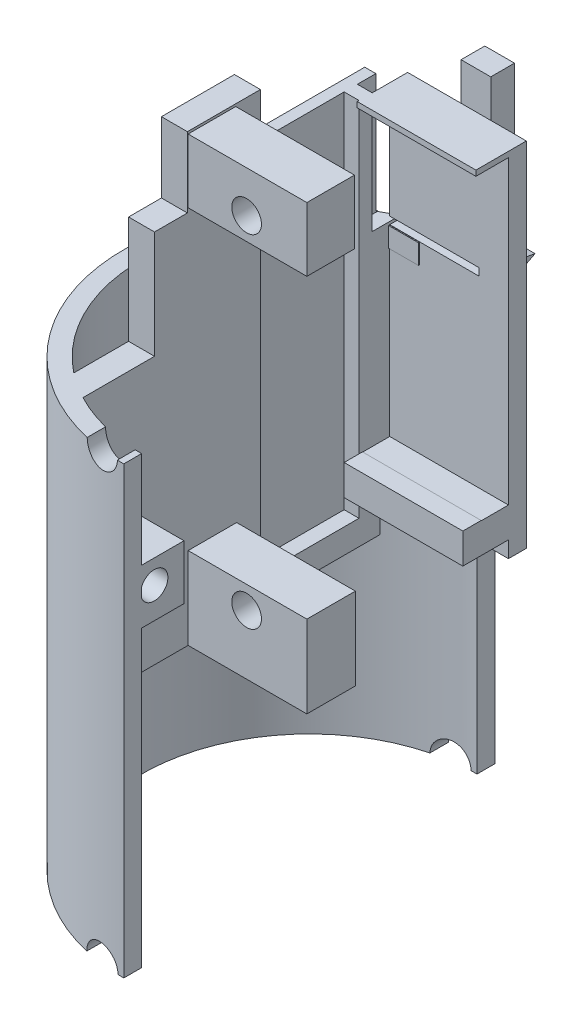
ISO-10303-21;
HEADER;
FILE_DESCRIPTION(('STEP AP214'),'2;1');
FILE_NAME('part.step','',(''),(''),'','','');
FILE_SCHEMA(('AUTOMOTIVE_DESIGN { 1 0 10303 214 1 1 1 1 }'));
ENDSEC;
DATA;
#1=APPLICATION_CONTEXT('core data for automotive mechanical design processes');
#2=APPLICATION_PROTOCOL_DEFINITION('international standard','automotive_design',2000,#1);
#3=PRODUCT_CONTEXT('',#1,'mechanical');
#4=PRODUCT('Part','Part','',(#3));
#5=PRODUCT_RELATED_PRODUCT_CATEGORY('part','',(#4));
#6=PRODUCT_DEFINITION_FORMATION('','',#4);
#7=PRODUCT_DEFINITION_CONTEXT('part definition',#1,'design');
#8=PRODUCT_DEFINITION('design','',#6,#7);
#9=PRODUCT_DEFINITION_SHAPE('','',#8);
#10=(LENGTH_UNIT() NAMED_UNIT(*) SI_UNIT(.MILLI.,.METRE.));
#11=(NAMED_UNIT(*) PLANE_ANGLE_UNIT() SI_UNIT($,.RADIAN.));
#12=(NAMED_UNIT(*) SI_UNIT($,.STERADIAN.) SOLID_ANGLE_UNIT());
#13=UNCERTAINTY_MEASURE_WITH_UNIT(LENGTH_MEASURE(1.E-05),#10,'distance_accuracy_value','');
#14=(GEOMETRIC_REPRESENTATION_CONTEXT(3) GLOBAL_UNCERTAINTY_ASSIGNED_CONTEXT((#13)) GLOBAL_UNIT_ASSIGNED_CONTEXT((#10,
#11,#12)) REPRESENTATION_CONTEXT('',''));
#15=CARTESIAN_POINT('',(0.,0.,0.));
#16=DIRECTION('',(0.,0.,1.));
#17=DIRECTION('',(1.,0.,0.));
#18=AXIS2_PLACEMENT_3D('',#15,#16,#17);
#19=CARTESIAN_POINT('',(2.75924908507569,49.2664867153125,-11.8634043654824));
#20=DIRECTION('',(0.,0.,1.));
#21=DIRECTION('',(1.,0.,0.));
#22=AXIS2_PLACEMENT_3D('',#19,#20,#21);
#23=PLANE('',#22);
#24=DIRECTION('',(-1.,0.,0.));
#25=VECTOR('',#24,1.);
#26=CARTESIAN_POINT('',(2.75924908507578,63.4105887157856,-11.8634043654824));
#27=LINE('',#26,#25);
#28=CARTESIAN_POINT('',(-3.93822762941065,63.4105887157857,-11.8634043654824));
#29=VERTEX_POINT('',#28);
#30=CARTESIAN_POINT('',(-5.24075091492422,63.4105887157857,-11.8634043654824));
#31=VERTEX_POINT('',#30);
#32=EDGE_CURVE('E646',#29,#31,#27,.T.);
#33=ORIENTED_EDGE('',*,*,#32,.F.);
#34=DIRECTION('',(0.,-1.,0.));
#35=VECTOR('',#34,1.);
#36=CARTESIAN_POINT('',(-3.93822762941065,90.,-11.8634043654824));
#37=LINE('',#36,#35);
#38=CARTESIAN_POINT('',(-3.93822762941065,49.2664867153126,-11.8634043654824));
#39=VERTEX_POINT('',#38);
#40=EDGE_CURVE('E1385',#29,#39,#37,.T.);
#41=ORIENTED_EDGE('',*,*,#40,.T.);
#42=DIRECTION('',(-1.,0.,0.));
#43=VECTOR('',#42,1.);
#44=CARTESIAN_POINT('',(2.75924908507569,49.2664867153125,-11.8634043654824));
#45=LINE('',#44,#43);
#46=CARTESIAN_POINT('',(-5.24075091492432,49.2664867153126,-11.8634043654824));
#47=VERTEX_POINT('',#46);
#48=EDGE_CURVE('E1374',#39,#47,#45,.T.);
#49=ORIENTED_EDGE('',*,*,#48,.T.);
#50=DIRECTION('',(0.,1.,0.));
#51=VECTOR('',#50,1.);
#52=CARTESIAN_POINT('',(-5.24075091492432,49.2664867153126,-11.8634043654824));
#53=LINE('',#52,#51);
#54=EDGE_CURVE('E1340',#47,#31,#53,.T.);
#55=ORIENTED_EDGE('',*,*,#54,.T.);
#56=EDGE_LOOP('',(#33,#41,#49,#55));
#57=FACE_BOUND('',#56,.T.);
#58=ADVANCED_FACE('F35',(#57),#23,.F.);
#59=CARTESIAN_POINT('',(-5.2,61.9603894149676,-12.3660342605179));
#60=DIRECTION('',(0.,0.,1.));
#61=DIRECTION('',(1.,0.,0.));
#62=AXIS2_PLACEMENT_3D('',#59,#60,#61);
#63=PLANE('',#62);
#64=DIRECTION('',(0.,1.,0.));
#65=VECTOR('',#64,1.);
#66=CARTESIAN_POINT('',(-3.24075091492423,61.9603894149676,-12.3660342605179));
#67=LINE('',#66,#65);
#68=CARTESIAN_POINT('',(-3.24075091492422,63.4105887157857,-12.3660342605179));
#69=VERTEX_POINT('',#68);
#70=CARTESIAN_POINT('',(-3.24075091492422,63.9543779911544,-12.3660342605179));
#71=VERTEX_POINT('',#70);
#72=EDGE_CURVE('E11',#69,#71,#67,.T.);
#73=ORIENTED_EDGE('',*,*,#72,.F.);
#74=DIRECTION('',(-1.,0.,0.));
#75=VECTOR('',#74,1.);
#76=CARTESIAN_POINT('',(-5.19999999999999,63.4105887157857,-12.3660342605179));
#77=LINE('',#76,#75);
#78=CARTESIAN_POINT('',(-5.2,63.4105887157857,-12.3660342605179));
#79=VERTEX_POINT('',#78);
#80=EDGE_CURVE('E592',#69,#79,#77,.T.);
#81=ORIENTED_EDGE('',*,*,#80,.T.);
#82=DIRECTION('',(0.,-1.,0.));
#83=VECTOR('',#82,1.);
#84=CARTESIAN_POINT('',(-5.2,61.9603894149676,-12.3660342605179));
#85=LINE('',#84,#83);
#86=CARTESIAN_POINT('',(-5.2,61.9603894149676,-12.3660342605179));
#87=VERTEX_POINT('',#86);
#88=EDGE_CURVE('E1143',#79,#87,#85,.T.);
#89=ORIENTED_EDGE('',*,*,#88,.T.);
#90=DIRECTION('',(1.,0.,0.));
#91=VECTOR('',#90,1.);
#92=CARTESIAN_POINT('',(-5.2,61.9603894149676,-12.3660342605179));
#93=LINE('',#92,#91);
#94=CARTESIAN_POINT('',(-1.82515661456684,61.9603894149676,-12.3660342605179));
#95=VERTEX_POINT('',#94);
#96=EDGE_CURVE('E1147',#87,#95,#93,.T.);
#97=ORIENTED_EDGE('',*,*,#96,.T.);
#98=DIRECTION('',(0.,-1.,0.));
#99=VECTOR('',#98,1.);
#100=CARTESIAN_POINT('',(-1.82515661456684,90.,-12.3660342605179));
#101=LINE('',#100,#99);
#102=CARTESIAN_POINT('',(-1.82515661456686,63.8501040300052,-12.3660342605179));
#103=VERTEX_POINT('',#102);
#104=EDGE_CURVE('E1162',#103,#95,#101,.T.);
#105=ORIENTED_EDGE('',*,*,#104,.F.);
#106=CARTESIAN_POINT('',(-1.60710941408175,65.,-12.3660342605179));
#107=DIRECTION('',(0.,0.,1.));
#108=DIRECTION('',(1.,0.,0.));
#109=AXIS2_PLACEMENT_3D('',#106,#107,#108);
#110=CIRCLE('',#109,1.17038682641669);
#111=CARTESIAN_POINT('',(-1.08129581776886,63.9543779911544,-12.3660342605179));
#112=VERTEX_POINT('',#111);
#113=EDGE_CURVE('E1119',#103,#112,#110,.T.);
#114=ORIENTED_EDGE('',*,*,#113,.T.);
#115=DIRECTION('',(1.,0.,0.));
#116=VECTOR('',#115,1.);
#117=CARTESIAN_POINT('',(-5.2,63.9543779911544,-12.3660342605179));
#118=LINE('',#117,#116);
#119=EDGE_CURVE('E1148',#71,#112,#118,.T.);
#120=ORIENTED_EDGE('',*,*,#119,.F.);
#121=EDGE_LOOP('',(#73,#81,#89,#97,#105,#114,#120));
#122=FACE_BOUND('',#121,.T.);
#123=ADVANCED_FACE('F752',(#122),#63,.T.);
#124=CARTESIAN_POINT('',(-5.2,0.,0.));
#125=DIRECTION('',(1.,0.,0.));
#126=DIRECTION('',(0.,0.,-1.));
#127=AXIS2_PLACEMENT_3D('',#124,#125,#126);
#128=PLANE('',#127);
#129=DIRECTION('',(0.,0.,1.));
#130=VECTOR('',#129,1.);
#131=CARTESIAN_POINT('',(-5.2,63.4105887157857,0.));
#132=LINE('',#131,#130);
#133=CARTESIAN_POINT('',(-5.2,63.4105887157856,-15.2097227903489));
#134=VERTEX_POINT('',#133);
#135=EDGE_CURVE('E44',#134,#79,#132,.T.);
#136=ORIENTED_EDGE('',*,*,#135,.F.);
#137=DIRECTION('',(0.,0.454305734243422,-0.890845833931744));
#138=VECTOR('',#137,1.);
#139=CARTESIAN_POINT('',(-5.2,63.4105887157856,-15.2097227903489));
#140=LINE('',#139,#138);
#141=EDGE_CURVE('E1142',#87,#134,#140,.T.);
#142=ORIENTED_EDGE('',*,*,#141,.F.);
#143=ORIENTED_EDGE('',*,*,#88,.F.);
#144=EDGE_LOOP('',(#136,#142,#143));
#145=FACE_BOUND('',#144,.T.);
#146=ADVANCED_FACE('F749',(#145),#128,.F.);
#147=CARTESIAN_POINT('',(0.,90.,0.));
#148=DIRECTION('',(0.,-1.,0.));
#149=DIRECTION('',(0.,0.,-1.));
#150=AXIS2_PLACEMENT_3D('',#147,#148,#149);
#151=CYLINDRICAL_SURFACE('',#150,11.3);
#152=DIRECTION('',(0.,-1.,0.));
#153=VECTOR('',#152,1.);
#154=CARTESIAN_POINT('',(-4.,90.,10.5683489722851));
#155=LINE('',#154,#153);
#156=CARTESIAN_POINT('',(-4.,54.8166274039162,10.5683489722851));
#157=VERTEX_POINT('',#156);
#158=CARTESIAN_POINT('',(-4.,55.9807158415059,10.5683489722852));
#159=VERTEX_POINT('',#158);
#160=EDGE_CURVE('E1127',#157,#159,#155,.F.);
#161=ORIENTED_EDGE('',*,*,#160,.F.);
#162=CARTESIAN_POINT('',(0.,54.8166274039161,0.));
#163=DIRECTION('',(0.,1.,0.));
#164=DIRECTION('',(-1.,0.,0.));
#165=AXIS2_PLACEMENT_3D('',#162,#163,#164);
#166=CIRCLE('',#165,11.3);
#167=CARTESIAN_POINT('',(0.,54.8166274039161,11.3));
#168=VERTEX_POINT('',#167);
#169=EDGE_CURVE('E1545',#157,#168,#166,.T.);
#170=ORIENTED_EDGE('',*,*,#169,.T.);
#171=DIRECTION('',(0.,-1.,0.));
#172=VECTOR('',#171,1.);
#173=CARTESIAN_POINT('',(0.,90.,11.3));
#174=LINE('',#173,#172);
#175=CARTESIAN_POINT('',(0.,35.,11.3));
#176=VERTEX_POINT('',#175);
#177=EDGE_CURVE('E1021',#168,#176,#174,.T.);
#178=ORIENTED_EDGE('',*,*,#177,.T.);
#179=CARTESIAN_POINT('',(0.,35.,0.));
#180=DIRECTION('',(0.,1.,0.));
#181=DIRECTION('',(0.,0.,1.));
#182=AXIS2_PLACEMENT_3D('',#179,#180,#181);
#183=CIRCLE('',#182,11.3);
#184=CARTESIAN_POINT('',(-0.397746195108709,35.,11.2929977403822));
#185=VERTEX_POINT('',#184);
#186=EDGE_CURVE('E1532',#185,#176,#183,.T.);
#187=ORIENTED_EDGE('',*,*,#186,.F.);
#188=CARTESIAN_POINT('',(-2.81647263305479,35.,10.9433761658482));
#189=CARTESIAN_POINT('',(-2.81646954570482,34.9334643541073,10.9433774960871));
#190=CARTESIAN_POINT('',(-2.81096070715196,34.866884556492,10.9447993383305));
#191=CARTESIAN_POINT('',(-2.78909567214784,34.7356022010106,10.9503911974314));
#192=CARTESIAN_POINT('',(-2.77272750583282,34.6709017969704,10.9545642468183));
#193=CARTESIAN_POINT('',(-2.72970931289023,34.5453278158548,10.9653625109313));
#194=CARTESIAN_POINT('',(-2.70307255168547,34.4844494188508,10.9719845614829));
#195=CARTESIAN_POINT('',(-2.64035405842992,34.3680699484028,10.9872456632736));
#196=CARTESIAN_POINT('',(-2.60427347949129,34.3125682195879,10.9958844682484));
#197=CARTESIAN_POINT('',(-2.52302674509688,34.2074458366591,11.0148127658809));
#198=CARTESIAN_POINT('',(-2.47771673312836,34.1579410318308,11.0251277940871));
#199=CARTESIAN_POINT('',(-2.3796732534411,34.0671713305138,11.0467040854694));
#200=CARTESIAN_POINT('',(-2.32693858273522,34.025907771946,11.0579655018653));
#201=CARTESIAN_POINT('',(-2.2140020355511,33.9517050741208,11.0811370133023));
#202=CARTESIAN_POINT('',(-2.15364231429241,33.9190088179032,11.0930563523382));
#203=CARTESIAN_POINT('',(-2.02822950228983,33.8642626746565,11.1166700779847));
#204=CARTESIAN_POINT('',(-1.96317612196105,33.8422134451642,11.1283644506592));
#205=CARTESIAN_POINT('',(-1.82962531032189,33.8092806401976,11.1511027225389));
#206=CARTESIAN_POINT('',(-1.76110472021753,33.7984867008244,11.1621407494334));
#207=CARTESIAN_POINT('',(-1.62304948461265,33.7887639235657,11.1830488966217));
#208=CARTESIAN_POINT('',(-1.55351489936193,33.7898343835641,11.1929190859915));
#209=CARTESIAN_POINT('',(-1.4161866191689,33.8038303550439,11.211117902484));
#210=CARTESIAN_POINT('',(-1.34838233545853,33.816632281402,11.219461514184));
#211=CARTESIAN_POINT('',(-1.21577753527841,33.8536336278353,11.2346045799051));
#212=CARTESIAN_POINT('',(-1.15097678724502,33.8778321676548,11.2414041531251));
#213=CARTESIAN_POINT('',(-1.02719390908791,33.9365688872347,11.2533857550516));
#214=CARTESIAN_POINT('',(-0.968143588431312,33.9709591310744,11.2585888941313));
#215=CARTESIAN_POINT('',(-0.856601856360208,34.0492425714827,11.2676248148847));
#216=CARTESIAN_POINT('',(-0.804110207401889,34.0931354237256,11.271457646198));
#217=CARTESIAN_POINT('',(-0.707543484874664,34.1888687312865,11.277930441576));
#218=CARTESIAN_POINT('',(-0.663416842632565,34.2406566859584,11.2805778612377));
#219=CARTESIAN_POINT('',(-0.584442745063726,34.3509154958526,11.2849455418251));
#220=CARTESIAN_POINT('',(-0.549595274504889,34.4093863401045,11.2866658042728));
#221=CARTESIAN_POINT('',(-0.490180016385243,34.5313531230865,11.2894026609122));
#222=CARTESIAN_POINT('',(-0.465612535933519,34.5948492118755,11.2904192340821));
#223=CARTESIAN_POINT('',(-0.427459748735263,34.7250652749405,11.2919283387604));
#224=CARTESIAN_POINT('',(-0.413874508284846,34.7917852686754,11.2924208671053));
#225=CARTESIAN_POINT('',(-0.398063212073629,34.9266422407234,11.2929894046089));
#226=CARTESIAN_POINT('',(-0.395851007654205,34.9947808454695,11.2930649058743));
#227=CARTESIAN_POINT('',(-0.402886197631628,35.1304633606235,11.2928160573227));
#228=CARTESIAN_POINT('',(-0.41213364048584,35.1980072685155,11.292491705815));
#229=CARTESIAN_POINT('',(-0.441829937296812,35.3306067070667,11.2913685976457));
#230=CARTESIAN_POINT('',(-0.462282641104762,35.3956613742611,11.2905696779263));
#231=CARTESIAN_POINT('',(-0.513807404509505,35.5214084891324,11.2883419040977));
#232=CARTESIAN_POINT('',(-0.544879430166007,35.5821009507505,11.2869130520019));
#233=CARTESIAN_POINT('',(-0.616729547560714,35.6973639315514,11.2832146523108));
#234=CARTESIAN_POINT('',(-0.657502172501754,35.7519378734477,11.2809455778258));
#235=CARTESIAN_POINT('',(-0.747583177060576,35.8534510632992,11.2753337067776));
#236=CARTESIAN_POINT('',(-0.796891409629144,35.9003904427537,11.2719909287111));
#237=CARTESIAN_POINT('',(-0.902539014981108,35.9852536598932,11.2640232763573));
#238=CARTESIAN_POINT('',(-0.958869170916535,36.0231891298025,11.2594000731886));
#239=CARTESIAN_POINT('',(-1.07696823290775,36.0890738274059,11.2487177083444));
#240=CARTESIAN_POINT('',(-1.1387370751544,36.1170231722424,11.2426585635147));
#241=CARTESIAN_POINT('',(-1.26598206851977,36.162219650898,11.2290419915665));
#242=CARTESIAN_POINT('',(-1.33146169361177,36.1794565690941,11.2214831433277));
#243=CARTESIAN_POINT('',(-1.46419990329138,36.2027792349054,11.2049360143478));
#244=CARTESIAN_POINT('',(-1.53145856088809,36.2088645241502,11.1959476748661));
#245=CARTESIAN_POINT('',(-1.66643291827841,36.2098068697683,11.1766581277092));
#246=CARTESIAN_POINT('',(-1.73414778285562,36.2045703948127,11.1663466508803));
#247=CARTESIAN_POINT('',(-1.86761235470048,36.1829072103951,11.1448013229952));
#248=CARTESIAN_POINT('',(-1.9333618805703,36.1664794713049,11.1335673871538));
#249=CARTESIAN_POINT('',(-2.06205354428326,36.1226186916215,11.1104577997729));
#250=CARTESIAN_POINT('',(-2.12494157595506,36.0950304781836,11.0985752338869));
#251=CARTESIAN_POINT('',(-2.24516823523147,36.0296232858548,11.0748805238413));
#252=CARTESIAN_POINT('',(-2.30250659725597,35.9918038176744,11.0630683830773));
#253=CARTESIAN_POINT('',(-2.41047431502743,35.9066034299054,11.0400492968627));
#254=CARTESIAN_POINT('',(-2.46104791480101,35.8591503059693,11.0288477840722));
#255=CARTESIAN_POINT('',(-2.55348700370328,35.7561204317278,11.0078134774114));
#256=CARTESIAN_POINT('',(-2.59535096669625,35.7005422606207,10.9979809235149));
#257=CARTESIAN_POINT('',(-2.66861343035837,35.5835065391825,10.9804330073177));
#258=CARTESIAN_POINT('',(-2.70013042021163,35.5221267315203,10.9726938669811));
#259=CARTESIAN_POINT('',(-2.75230691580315,35.3947241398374,10.9597233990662));
#260=CARTESIAN_POINT('',(-2.77298100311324,35.3287077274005,10.9544887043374));
#261=CARTESIAN_POINT('',(-2.79737400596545,35.2185419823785,10.9482778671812));
#262=CARTESIAN_POINT('',(-2.80452463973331,35.175169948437,10.946445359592));
#263=CARTESIAN_POINT('',(-2.81407491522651,35.087871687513,10.9439940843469));
#264=CARTESIAN_POINT('',(-2.81647467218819,35.0439454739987,10.9433752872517));
#265=CARTESIAN_POINT('',(-2.81647263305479,35.,10.9433761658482));
#266=B_SPLINE_CURVE_WITH_KNOTS('',3,(#188,#189,#190,#191,#192,#193,#194,#195,#196,#197,#198,
#199,#200,#201,#202,#203,#204,#205,#206,#207,#208,#209,#210,#211,#212,#213,#214,#215,#216,#217,
#218,#219,#220,#221,#222,#223,#224,#225,#226,#227,#228,#229,#230,#231,#232,#233,#234,#235,#236,
#237,#238,#239,#240,#241,#242,#243,#244,#245,#246,#247,#248,#249,#250,#251,#252,#253,#254,#255,
#256,#257,#258,#259,#260,#261,#262,#263,#264,#265),.UNSPECIFIED.,.T.,.F.,(4,2,2,2,2,2,2,2,2,2,2,
2,2,2,2,2,2,2,2,2,2,2,2,2,2,2,2,2,2,2,2,2,2,2,2,2,2,2,4),(0.,0.199443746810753,
0.399107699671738,0.598514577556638,0.797897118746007,1.00066482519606,1.20346542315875,
1.41151081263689,1.61956904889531,1.82927187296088,2.03896228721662,2.24646879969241,
2.45395928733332,2.65857433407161,2.86318196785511,3.06648400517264,3.26978570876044,
3.47309348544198,3.67640248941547,3.87995904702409,4.08351646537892,4.28714386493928,
4.49077061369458,4.69428287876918,4.89779163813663,5.10103603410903,5.30427804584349,
5.50771357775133,5.71115747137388,5.91628847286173,6.12143834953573,6.32954438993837,
6.5376603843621,6.74739796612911,6.95717226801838,7.16445294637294,7.37145415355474,
7.50318598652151,7.63491462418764),.UNSPECIFIED.);
#267=CARTESIAN_POINT('',(-2.81647263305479,35.,10.9433761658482));
#268=VERTEX_POINT('',#267);
#269=EDGE_CURVE('E994',#185,#268,#266,.T.);
#270=ORIENTED_EDGE('',*,*,#269,.T.);
#271=CARTESIAN_POINT('',(-2.81647263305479,35.,-10.9433761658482));
#272=VERTEX_POINT('',#271);
#273=EDGE_CURVE('E1015',#272,#268,#183,.T.);
#274=ORIENTED_EDGE('',*,*,#273,.F.);
#275=CARTESIAN_POINT('',(-2.81647263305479,35.,-10.9433761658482));
#276=CARTESIAN_POINT('',(-2.81646954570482,35.0665356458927,-10.9433774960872));
#277=CARTESIAN_POINT('',(-2.81096070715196,35.133115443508,-10.9447993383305));
#278=CARTESIAN_POINT('',(-2.78909567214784,35.2643977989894,-10.9503911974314));
#279=CARTESIAN_POINT('',(-2.77272750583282,35.3290982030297,-10.9545642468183));
#280=CARTESIAN_POINT('',(-2.72970931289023,35.4546721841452,-10.9653625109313));
#281=CARTESIAN_POINT('',(-2.70307255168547,35.5155505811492,-10.9719845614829));
#282=CARTESIAN_POINT('',(-2.64035405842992,35.6319300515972,-10.9872456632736));
#283=CARTESIAN_POINT('',(-2.60427347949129,35.6874317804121,-10.9958844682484));
#284=CARTESIAN_POINT('',(-2.52302674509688,35.7925541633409,-11.0148127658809));
#285=CARTESIAN_POINT('',(-2.47771673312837,35.8420589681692,-11.0251277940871));
#286=CARTESIAN_POINT('',(-2.3796732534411,35.9328286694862,-11.0467040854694));
#287=CARTESIAN_POINT('',(-2.32693858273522,35.974092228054,-11.0579655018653));
#288=CARTESIAN_POINT('',(-2.2140020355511,36.0482949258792,-11.0811370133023));
#289=CARTESIAN_POINT('',(-2.15364231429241,36.0809911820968,-11.0930563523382));
#290=CARTESIAN_POINT('',(-2.02822950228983,36.1357373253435,-11.1166700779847));
#291=CARTESIAN_POINT('',(-1.96317612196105,36.1577865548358,-11.1283644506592));
#292=CARTESIAN_POINT('',(-1.82962531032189,36.1907193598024,-11.1511027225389));
#293=CARTESIAN_POINT('',(-1.76110472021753,36.2015132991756,-11.1621407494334));
#294=CARTESIAN_POINT('',(-1.62304948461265,36.2112360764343,-11.1830488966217));
#295=CARTESIAN_POINT('',(-1.55351489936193,36.2101656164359,-11.1929190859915));
#296=CARTESIAN_POINT('',(-1.4161866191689,36.1961696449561,-11.211117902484));
#297=CARTESIAN_POINT('',(-1.34838233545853,36.1833677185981,-11.219461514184));
#298=CARTESIAN_POINT('',(-1.21577753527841,36.1463663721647,-11.2346045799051));
#299=CARTESIAN_POINT('',(-1.15097678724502,36.1221678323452,-11.2414041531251));
#300=CARTESIAN_POINT('',(-1.02719390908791,36.0634311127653,-11.2533857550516));
#301=CARTESIAN_POINT('',(-0.968143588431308,36.0290408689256,-11.2585888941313));
#302=CARTESIAN_POINT('',(-0.856601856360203,35.9507574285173,-11.2676248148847));
#303=CARTESIAN_POINT('',(-0.804110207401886,35.9068645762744,-11.271457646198));
#304=CARTESIAN_POINT('',(-0.70754348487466,35.8111312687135,-11.277930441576));
#305=CARTESIAN_POINT('',(-0.663416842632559,35.7593433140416,-11.2805778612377));
#306=CARTESIAN_POINT('',(-0.584442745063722,35.6490845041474,-11.2849455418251));
#307=CARTESIAN_POINT('',(-0.549595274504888,35.5906136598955,-11.2866658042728));
#308=CARTESIAN_POINT('',(-0.490180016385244,35.4686468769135,-11.2894026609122));
#309=CARTESIAN_POINT('',(-0.465612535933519,35.4051507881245,-11.2904192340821));
#310=CARTESIAN_POINT('',(-0.427459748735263,35.2749347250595,-11.2919283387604));
#311=CARTESIAN_POINT('',(-0.413874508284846,35.2082147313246,-11.2924208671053));
#312=CARTESIAN_POINT('',(-0.398063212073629,35.0733577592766,-11.2929894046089));
#313=CARTESIAN_POINT('',(-0.395851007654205,35.0052191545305,-11.2930649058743));
#314=CARTESIAN_POINT('',(-0.402886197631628,34.8695366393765,-11.2928160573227));
#315=CARTESIAN_POINT('',(-0.41213364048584,34.8019927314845,-11.292491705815));
#316=CARTESIAN_POINT('',(-0.441829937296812,34.6693932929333,-11.2913685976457));
#317=CARTESIAN_POINT('',(-0.462282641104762,34.6043386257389,-11.2905696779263));
#318=CARTESIAN_POINT('',(-0.513807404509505,34.4785915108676,-11.2883419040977));
#319=CARTESIAN_POINT('',(-0.544879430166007,34.4178990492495,-11.2869130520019));
#320=CARTESIAN_POINT('',(-0.616729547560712,34.3026360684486,-11.2832146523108));
#321=CARTESIAN_POINT('',(-0.65750217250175,34.2480621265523,-11.2809455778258));
#322=CARTESIAN_POINT('',(-0.747583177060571,34.1465489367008,-11.2753337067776));
#323=CARTESIAN_POINT('',(-0.796891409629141,34.0996095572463,-11.2719909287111));
#324=CARTESIAN_POINT('',(-0.902539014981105,34.0147463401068,-11.2640232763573));
#325=CARTESIAN_POINT('',(-0.958869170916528,33.9768108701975,-11.2594000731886));
#326=CARTESIAN_POINT('',(-1.07696823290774,33.9109261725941,-11.2487177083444));
#327=CARTESIAN_POINT('',(-1.1387370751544,33.8829768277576,-11.2426585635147));
#328=CARTESIAN_POINT('',(-1.26598206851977,33.837780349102,-11.2290419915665));
#329=CARTESIAN_POINT('',(-1.33146169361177,33.8205434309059,-11.2214831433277));
#330=CARTESIAN_POINT('',(-1.46419990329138,33.7972207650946,-11.2049360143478));
#331=CARTESIAN_POINT('',(-1.53145856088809,33.7911354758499,-11.1959476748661));
#332=CARTESIAN_POINT('',(-1.66643291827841,33.7901931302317,-11.1766581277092));
#333=CARTESIAN_POINT('',(-1.73414778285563,33.7954296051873,-11.1663466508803));
#334=CARTESIAN_POINT('',(-1.86761235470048,33.8170927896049,-11.1448013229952));
#335=CARTESIAN_POINT('',(-1.9333618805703,33.8335205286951,-11.1335673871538));
#336=CARTESIAN_POINT('',(-2.06205354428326,33.8773813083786,-11.1104577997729));
#337=CARTESIAN_POINT('',(-2.12494157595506,33.9049695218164,-11.0985752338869));
#338=CARTESIAN_POINT('',(-2.24516823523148,33.9703767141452,-11.0748805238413));
#339=CARTESIAN_POINT('',(-2.30250659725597,34.0081961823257,-11.0630683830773));
#340=CARTESIAN_POINT('',(-2.41047431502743,34.0933965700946,-11.0400492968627));
#341=CARTESIAN_POINT('',(-2.461047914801,34.1408496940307,-11.0288477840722));
#342=CARTESIAN_POINT('',(-2.55348700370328,34.2438795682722,-11.0078134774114));
#343=CARTESIAN_POINT('',(-2.59535096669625,34.2994577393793,-10.9979809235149));
#344=CARTESIAN_POINT('',(-2.66861343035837,34.4164934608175,-10.9804330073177));
#345=CARTESIAN_POINT('',(-2.70013042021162,34.4778732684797,-10.9726938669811));
#346=CARTESIAN_POINT('',(-2.75230691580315,34.6052758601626,-10.9597233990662));
#347=CARTESIAN_POINT('',(-2.77298100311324,34.6712922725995,-10.9544887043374));
#348=CARTESIAN_POINT('',(-2.79737400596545,34.7814580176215,-10.9482778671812));
#349=CARTESIAN_POINT('',(-2.80452463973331,34.824830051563,-10.946445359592));
#350=CARTESIAN_POINT('',(-2.81407491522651,34.912128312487,-10.9439940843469));
#351=CARTESIAN_POINT('',(-2.81647467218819,34.9560545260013,-10.9433752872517));
#352=CARTESIAN_POINT('',(-2.81647263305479,35.,-10.9433761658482));
#353=B_SPLINE_CURVE_WITH_KNOTS('',3,(#275,#276,#277,#278,#279,#280,#281,#282,#283,#284,#285,
#286,#287,#288,#289,#290,#291,#292,#293,#294,#295,#296,#297,#298,#299,#300,#301,#302,#303,#304,
#305,#306,#307,#308,#309,#310,#311,#312,#313,#314,#315,#316,#317,#318,#319,#320,#321,#322,#323,
#324,#325,#326,#327,#328,#329,#330,#331,#332,#333,#334,#335,#336,#337,#338,#339,#340,#341,#342,
#343,#344,#345,#346,#347,#348,#349,#350,#351,#352),.UNSPECIFIED.,.T.,.F.,(4,2,2,2,2,2,2,2,2,2,2,
2,2,2,2,2,2,2,2,2,2,2,2,2,2,2,2,2,2,2,2,2,2,2,2,2,2,2,4),(0.,0.199443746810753,
0.399107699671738,0.598514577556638,0.797897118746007,1.00066482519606,1.20346542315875,
1.41151081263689,1.61956904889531,1.82927187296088,2.03896228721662,2.24646879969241,
2.45395928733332,2.65857433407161,2.86318196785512,3.06648400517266,3.26978570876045,
3.47309348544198,3.67640248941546,3.87995904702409,4.08351646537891,4.28714386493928,
4.49077061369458,4.69428287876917,4.89779163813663,5.10103603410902,5.30427804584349,
5.50771357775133,5.71115747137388,5.91628847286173,6.12143834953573,6.32954438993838,
6.5376603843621,6.7473979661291,6.95717226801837,7.16445294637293,7.37145415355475,
7.5031859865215,7.63491462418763),.UNSPECIFIED.);
#354=CARTESIAN_POINT('',(-0.397746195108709,35.,-11.2929977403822));
#355=VERTEX_POINT('',#354);
#356=EDGE_CURVE('E988',#272,#355,#353,.T.);
#357=ORIENTED_EDGE('',*,*,#356,.T.);
#358=CARTESIAN_POINT('',(0.,35.,-11.3));
#359=VERTEX_POINT('',#358);
#360=EDGE_CURVE('E1530',#359,#355,#183,.T.);
#361=ORIENTED_EDGE('',*,*,#360,.F.);
#362=DIRECTION('',(0.,-1.,0.));
#363=VECTOR('',#362,1.);
#364=CARTESIAN_POINT('',(0.,90.,-11.3));
#365=LINE('',#364,#363);
#366=CARTESIAN_POINT('',(0.,49.2664867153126,-11.3));
#367=VERTEX_POINT('',#366);
#368=EDGE_CURVE('E1002',#359,#367,#365,.F.);
#369=ORIENTED_EDGE('',*,*,#368,.T.);
#370=CARTESIAN_POINT('',(0.,49.2664867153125,0.));
#371=DIRECTION('',(0.,1.,0.));
#372=DIRECTION('',(-1.,0.,0.));
#373=AXIS2_PLACEMENT_3D('',#370,#371,#372);
#374=CIRCLE('',#373,11.3);
#375=CARTESIAN_POINT('',(-3.75443835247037,49.2664867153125,-10.6580576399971));
#376=VERTEX_POINT('',#375);
#377=EDGE_CURVE('E1389',#367,#376,#374,.T.);
#378=ORIENTED_EDGE('',*,*,#377,.T.);
#379=DIRECTION('',(0.,-1.,0.));
#380=VECTOR('',#379,1.);
#381=CARTESIAN_POINT('',(-3.75443835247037,90.,-10.6580576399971));
#382=LINE('',#381,#380);
#383=CARTESIAN_POINT('',(-3.75443835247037,50.3691264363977,-10.6580576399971));
#384=VERTEX_POINT('',#383);
#385=EDGE_CURVE('E1093',#376,#384,#382,.F.);
#386=ORIENTED_EDGE('',*,*,#385,.T.);
#387=CARTESIAN_POINT('',(0.,50.3691264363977,0.));
#388=DIRECTION('',(0.,1.,0.));
#389=DIRECTION('',(-1.,0.,0.));
#390=AXIS2_PLACEMENT_3D('',#387,#388,#389);
#391=CIRCLE('',#390,11.3);
#392=CARTESIAN_POINT('',(-5.24075091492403,50.3691264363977,-10.0112201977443));
#393=VERTEX_POINT('',#392);
#394=EDGE_CURVE('E1090',#384,#393,#391,.T.);
#395=ORIENTED_EDGE('',*,*,#394,.T.);
#396=DIRECTION('',(0.,-1.,0.));
#397=VECTOR('',#396,1.);
#398=CARTESIAN_POINT('',(-5.24075091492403,90.,-10.0112201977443));
#399=LINE('',#398,#397);
#400=CARTESIAN_POINT('',(-5.24075091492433,47.,-10.0112201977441));
#401=VERTEX_POINT('',#400);
#402=EDGE_CURVE('E1068',#393,#401,#399,.T.);
#403=ORIENTED_EDGE('',*,*,#402,.T.);
#404=CARTESIAN_POINT('',(0.,47.,0.));
#405=DIRECTION('',(0.,-1.,0.));
#406=DIRECTION('',(1.,0.,0.));
#407=AXIS2_PLACEMENT_3D('',#404,#405,#406);
#408=CIRCLE('',#407,11.3);
#409=CARTESIAN_POINT('',(-6.99013906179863,47.,-8.87851090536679));
#410=VERTEX_POINT('',#409);
#411=EDGE_CURVE('E1489',#410,#401,#408,.T.);
#412=ORIENTED_EDGE('',*,*,#411,.F.);
#413=DIRECTION('',(0.,-1.,0.));
#414=VECTOR('',#413,1.);
#415=CARTESIAN_POINT('',(-6.99013906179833,90.0000000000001,-8.87851090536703));
#416=LINE('',#415,#414);
#417=CARTESIAN_POINT('',(-6.9901390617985,65.,-8.87851090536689));
#418=VERTEX_POINT('',#417);
#419=EDGE_CURVE('E1499',#410,#418,#416,.F.);
#420=ORIENTED_EDGE('',*,*,#419,.T.);
#421=CARTESIAN_POINT('',(0.,65.,0.));
#422=DIRECTION('',(0.,1.,0.));
#423=DIRECTION('',(0.,0.,1.));
#424=AXIS2_PLACEMENT_3D('',#421,#422,#423);
#425=CIRCLE('',#424,11.3);
#426=CARTESIAN_POINT('',(-6.9901390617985,65.,8.87851090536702));
#427=VERTEX_POINT('',#426);
#428=EDGE_CURVE('E1014',#418,#427,#425,.T.);
#429=ORIENTED_EDGE('',*,*,#428,.T.);
#430=DIRECTION('',(0.,-1.,0.));
#431=VECTOR('',#430,1.);
#432=CARTESIAN_POINT('',(-6.99013906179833,90.0000000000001,8.87851090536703));
#433=LINE('',#432,#431);
#434=CARTESIAN_POINT('',(-6.99013906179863,47.,8.87851090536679));
#435=VERTEX_POINT('',#434);
#436=EDGE_CURVE('E1060',#427,#435,#433,.T.);
#437=ORIENTED_EDGE('',*,*,#436,.T.);
#438=CARTESIAN_POINT('',(-5.24075091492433,47.,10.0112201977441));
#439=VERTEX_POINT('',#438);
#440=EDGE_CURVE('E1492',#439,#435,#408,.T.);
#441=ORIENTED_EDGE('',*,*,#440,.F.);
#442=DIRECTION('',(0.,-1.,0.));
#443=VECTOR('',#442,1.);
#444=CARTESIAN_POINT('',(-5.24075091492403,90.,10.0112201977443));
#445=LINE('',#444,#443);
#446=CARTESIAN_POINT('',(-5.24075091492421,65.,10.0112201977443));
#447=VERTEX_POINT('',#446);
#448=EDGE_CURVE('E1070',#439,#447,#445,.F.);
#449=ORIENTED_EDGE('',*,*,#448,.T.);
#450=CARTESIAN_POINT('',(-2.77749624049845,65.,10.9533334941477));
#451=VERTEX_POINT('',#450);
#452=EDGE_CURVE('E1012',#447,#451,#425,.T.);
#453=ORIENTED_EDGE('',*,*,#452,.T.);
#454=CARTESIAN_POINT('',(-2.77749624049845,65.,10.9533334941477));
#455=CARTESIAN_POINT('',(-2.77749324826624,64.9355745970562,10.9533347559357));
#456=CARTESIAN_POINT('',(-2.77215635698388,64.8711061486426,10.9546918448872));
#457=CARTESIAN_POINT('',(-2.75097277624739,64.7439854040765,10.9600302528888));
#458=CARTESIAN_POINT('',(-2.73511441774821,64.6813352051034,10.9640144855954));
#459=CARTESIAN_POINT('',(-2.69343312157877,64.5597381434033,10.974328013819));
#460=CARTESIAN_POINT('',(-2.66762279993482,64.5007867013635,10.9806543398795));
#461=CARTESIAN_POINT('',(-2.60684707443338,64.3880936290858,10.995240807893));
#462=CARTESIAN_POINT('',(-2.57188283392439,64.3343513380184,11.0035007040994));
#463=CARTESIAN_POINT('',(-2.49316795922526,64.2325947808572,11.0216045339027));
#464=CARTESIAN_POINT('',(-2.44928213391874,64.1846893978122,11.0314723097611));
#465=CARTESIAN_POINT('',(-2.35432429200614,64.0968611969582,11.0521271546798));
#466=CARTESIAN_POINT('',(-2.30325113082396,64.0569396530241,11.0629143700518));
#467=CARTESIAN_POINT('',(-2.193913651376,63.9851855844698,11.0851218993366));
#468=CARTESIAN_POINT('',(-2.13550037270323,63.9535826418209,11.0965513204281));
#469=CARTESIAN_POINT('',(-2.01414421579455,63.9006774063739,11.1192189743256));
#470=CARTESIAN_POINT('',(-1.95120105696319,63.8793757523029,11.1304571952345));
#471=CARTESIAN_POINT('',(-1.82198572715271,63.8475698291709,11.1523402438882));
#472=CARTESIAN_POINT('',(-1.75569083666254,63.8371538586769,11.1629795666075));
#473=CARTESIAN_POINT('',(-1.62213085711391,63.8277968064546,11.1831682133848));
#474=CARTESIAN_POINT('',(-1.5548658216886,63.8288550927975,11.1927175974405));
#475=CARTESIAN_POINT('',(-1.42198626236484,63.8424373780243,11.2103704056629));
#476=CARTESIAN_POINT('',(-1.35636202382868,63.8548489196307,11.2184870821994));
#477=CARTESIAN_POINT('',(-1.2280270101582,63.8907030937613,11.2332596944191));
#478=CARTESIAN_POINT('',(-1.16531601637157,63.9141448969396,11.2399157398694));
#479=CARTESIAN_POINT('',(-1.04550990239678,63.9710442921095,11.2516882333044));
#480=CARTESIAN_POINT('',(-0.988350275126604,64.0043620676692,11.2568242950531));
#481=CARTESIAN_POINT('',(-0.880386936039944,64.0802005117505,11.2657825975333));
#482=CARTESIAN_POINT('',(-0.82958298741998,64.1227208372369,11.2696048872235));
#483=CARTESIAN_POINT('',(-0.736139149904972,64.2154488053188,11.2760934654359));
#484=CARTESIAN_POINT('',(-0.693447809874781,64.2656041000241,11.2787671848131));
#485=CARTESIAN_POINT('',(-0.617053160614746,64.3723828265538,11.2832049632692));
#486=CARTESIAN_POINT('',(-0.58334982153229,64.4290062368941,11.2849690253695));
#487=CARTESIAN_POINT('',(-0.525909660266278,64.5470956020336,11.2877920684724));
#488=CARTESIAN_POINT('',(-0.502169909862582,64.6085601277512,11.2888512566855));
#489=CARTESIAN_POINT('',(-0.465320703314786,64.734603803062,11.2904304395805));
#490=CARTESIAN_POINT('',(-0.452211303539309,64.7991829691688,11.2909504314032));
#491=CARTESIAN_POINT('',(-0.436988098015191,64.9296971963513,11.2915499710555));
#492=CARTESIAN_POINT('',(-0.434886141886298,64.9956336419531,11.2916290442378));
#493=CARTESIAN_POINT('',(-0.441769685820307,65.1269245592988,11.291361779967));
#494=CARTESIAN_POINT('',(-0.450755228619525,65.1922790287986,11.2910154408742));
#495=CARTESIAN_POINT('',(-0.479562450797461,65.3205726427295,11.2898284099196));
#496=CARTESIAN_POINT('',(-0.499387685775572,65.3835109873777,11.2889875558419));
#497=CARTESIAN_POINT('',(-0.549309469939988,65.5051605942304,11.286668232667));
#498=CARTESIAN_POINT('',(-0.579405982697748,65.5638718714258,11.2851897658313));
#499=CARTESIAN_POINT('',(-0.648985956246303,65.6753669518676,11.281401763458));
#500=CARTESIAN_POINT('',(-0.688464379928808,65.7281539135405,11.2790926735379));
#501=CARTESIAN_POINT('',(-0.77567400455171,65.826336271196,11.2734304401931));
#502=CARTESIAN_POINT('',(-0.823405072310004,65.8717317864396,11.2700773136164));
#503=CARTESIAN_POINT('',(-0.925673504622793,65.9538052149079,11.2621379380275));
#504=CARTESIAN_POINT('',(-0.980203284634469,65.9904927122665,11.2575530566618));
#505=CARTESIAN_POINT('',(-1.09452120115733,66.054201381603,11.2470135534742));
#506=CARTESIAN_POINT('',(-1.15430928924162,66.0812226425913,11.2410589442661));
#507=CARTESIAN_POINT('',(-1.27749128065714,66.1249149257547,11.2277270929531));
#508=CARTESIAN_POINT('',(-1.34088977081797,66.1415724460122,11.2203480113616));
#509=CARTESIAN_POINT('',(-1.46940784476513,66.1640877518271,11.2042417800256));
#510=CARTESIAN_POINT('',(-1.53452750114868,66.1699450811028,11.1955145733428));
#511=CARTESIAN_POINT('',(-1.66521624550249,66.1707838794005,11.1768263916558));
#512=CARTESIAN_POINT('',(-1.73078450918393,66.1656734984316,11.166855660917));
#513=CARTESIAN_POINT('',(-1.86001615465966,66.1446094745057,11.146058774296));
#514=CARTESIAN_POINT('',(-1.92367936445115,66.1286548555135,11.1352325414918));
#515=CARTESIAN_POINT('',(-2.04825544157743,66.0860886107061,11.1129973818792));
#516=CARTESIAN_POINT('',(-2.10911740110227,66.0593310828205,11.1015824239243));
#517=CARTESIAN_POINT('',(-2.22546181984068,65.9959095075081,11.0788464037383));
#518=CARTESIAN_POINT('',(-2.28094404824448,65.9592450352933,11.0675253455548));
#519=CARTESIAN_POINT('',(-2.38536889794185,65.8766863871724,11.04549171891));
#520=CARTESIAN_POINT('',(-2.43426190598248,65.8307280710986,11.0347840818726));
#521=CARTESIAN_POINT('',(-2.52361537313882,65.7309621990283,11.0146933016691));
#522=CARTESIAN_POINT('',(-2.56407435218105,65.6771532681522,11.0053103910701));
#523=CARTESIAN_POINT('',(-2.63485953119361,65.563865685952,10.9885770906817));
#524=CARTESIAN_POINT('',(-2.6653010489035,65.5044624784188,10.9812037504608));
#525=CARTESIAN_POINT('',(-2.7156797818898,65.3811806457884,10.9688542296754));
#526=CARTESIAN_POINT('',(-2.73563110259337,65.3173081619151,10.9638748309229));
#527=CARTESIAN_POINT('',(-2.75912911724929,65.2108394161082,10.9579783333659));
#528=CARTESIAN_POINT('',(-2.7660059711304,65.1689934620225,10.9562417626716));
#529=CARTESIAN_POINT('',(-2.77519046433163,65.0847712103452,10.953918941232));
#530=CARTESIAN_POINT('',(-2.77749820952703,65.0423949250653,10.9533326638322));
#531=CARTESIAN_POINT('',(-2.77749624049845,65.,10.9533334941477));
#532=B_SPLINE_CURVE_WITH_KNOTS('',3,(#454,#455,#456,#457,#458,#459,#460,#461,#462,#463,#464,
#465,#466,#467,#468,#469,#470,#471,#472,#473,#474,#475,#476,#477,#478,#479,#480,#481,#482,#483,
#484,#485,#486,#487,#488,#489,#490,#491,#492,#493,#494,#495,#496,#497,#498,#499,#500,#501,#502,
#503,#504,#505,#506,#507,#508,#509,#510,#511,#512,#513,#514,#515,#516,#517,#518,#519,#520,#521,
#522,#523,#524,#525,#526,#527,#528,#529,#530,#531),.UNSPECIFIED.,.T.,.F.,(4,2,2,2,2,2,2,2,2,2,2,
2,2,2,2,2,2,2,2,2,2,2,2,2,2,2,2,2,2,2,2,2,2,2,2,2,2,2,4),(0.,0.193118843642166,
0.386452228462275,0.579541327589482,0.772605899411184,0.968849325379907,1.1651240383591,
1.36635239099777,1.56759321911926,1.77045402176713,1.97330365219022,2.17416550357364,
2.37501225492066,2.57314133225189,2.77126302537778,2.96808289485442,3.16490211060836,
3.36166344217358,3.55842581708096,3.75539996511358,3.95237487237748,4.14941442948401,
4.34645328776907,4.54338659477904,4.74031672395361,4.93702909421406,5.13373965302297,
5.33070595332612,5.5276805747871,5.72631120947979,5.92495972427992,6.12638603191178,
6.32782097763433,6.53069669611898,6.73360798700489,6.93409429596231,7.13431033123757,
7.26139449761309,7.38847571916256),.UNSPECIFIED.);
#533=CARTESIAN_POINT('',(-0.436722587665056,65.,11.291557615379));
#534=VERTEX_POINT('',#533);
#535=EDGE_CURVE('E995',#451,#534,#532,.T.);
#536=ORIENTED_EDGE('',*,*,#535,.T.);
#537=CARTESIAN_POINT('',(0.,65.,11.3));
#538=VERTEX_POINT('',#537);
#539=EDGE_CURVE('E1016',#534,#538,#425,.T.);
#540=ORIENTED_EDGE('',*,*,#539,.T.);
#541=CARTESIAN_POINT('',(0.,58.4860264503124,11.3));
#542=VERTEX_POINT('',#541);
#543=EDGE_CURVE('E1017',#538,#542,#174,.T.);
#544=ORIENTED_EDGE('',*,*,#543,.T.);
#545=CARTESIAN_POINT('',(0.,58.4860264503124,0.));
#546=DIRECTION('',(0.,-1.,0.));
#547=DIRECTION('',(1.,0.,0.));
#548=AXIS2_PLACEMENT_3D('',#545,#546,#547);
#549=CIRCLE('',#548,11.3);
#550=CARTESIAN_POINT('',(-4.,58.4860264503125,10.5683489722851));
#551=VERTEX_POINT('',#550);
#552=EDGE_CURVE('E1158',#542,#551,#549,.T.);
#553=ORIENTED_EDGE('',*,*,#552,.T.);
#554=CARTESIAN_POINT('',(-4.,57.7968426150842,10.5683489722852));
#555=VERTEX_POINT('',#554);
#556=EDGE_CURVE('E1125',#555,#551,#155,.F.);
#557=ORIENTED_EDGE('',*,*,#556,.F.);
#558=CARTESIAN_POINT('',(-4.,57.7968426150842,10.5683489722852));
#559=CARTESIAN_POINT('',(-3.92768960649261,57.7931190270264,10.5957179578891));
#560=CARTESIAN_POINT('',(-3.85516052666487,57.7882523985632,10.6223205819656));
#561=CARTESIAN_POINT('',(-3.70973036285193,57.7765111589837,10.6739801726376));
#562=CARTESIAN_POINT('',(-3.63682935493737,57.7696369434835,10.6990374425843));
#563=CARTESIAN_POINT('',(-3.41779448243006,57.7464350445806,10.7718307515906));
#564=CARTESIAN_POINT('',(-3.27115945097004,57.7275181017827,10.8172523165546));
#565=CARTESIAN_POINT('',(-2.97803018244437,57.6847382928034,10.9015789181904));
#566=CARTESIAN_POINT('',(-2.83154369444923,57.6609149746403,10.9405318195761));
#567=CARTESIAN_POINT('',(-2.53764145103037,57.6097450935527,11.0124144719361));
#568=CARTESIAN_POINT('',(-2.39022525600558,57.5823967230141,11.0453411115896));
#569=CARTESIAN_POINT('',(-2.05988338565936,57.5190108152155,11.1122262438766));
#570=CARTESIAN_POINT('',(-1.87674064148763,57.4824399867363,11.1446145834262));
#571=CARTESIAN_POINT('',(-1.60102218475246,57.4279198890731,11.1863915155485));
#572=CARTESIAN_POINT('',(-1.50897862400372,57.409808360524,11.199179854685));
#573=CARTESIAN_POINT('',(-1.32446648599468,57.3743241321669,11.2224969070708));
#574=CARTESIAN_POINT('',(-1.23199794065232,57.3569513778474,11.2330257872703));
#575=CARTESIAN_POINT('',(-1.04562894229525,57.3236030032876,11.2519117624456));
#576=CARTESIAN_POINT('',(-0.951723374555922,57.3076429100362,11.2602463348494));
#577=CARTESIAN_POINT('',(-0.763344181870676,57.2784728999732,11.2745832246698));
#578=CARTESIAN_POINT('',(-0.668870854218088,57.2652616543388,11.2805866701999));
#579=CARTESIAN_POINT('',(-0.47895041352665,57.243070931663,11.2902464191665));
#580=CARTESIAN_POINT('',(-0.383501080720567,57.2341060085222,11.2938946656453));
#581=CARTESIAN_POINT('',(-0.192062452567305,57.2217938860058,11.2987750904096));
#582=CARTESIAN_POINT('',(-0.0960726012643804,57.2184543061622,11.3000039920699));
#583=CARTESIAN_POINT('',(5.26639568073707E-12,57.2186018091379,11.3));
#584=B_SPLINE_CURVE_WITH_KNOTS('',3,(#558,#559,#560,#561,#562,#563,#564,#565,#566,#567,#568,
#569,#570,#571,#572,#573,#574,#575,#576,#577,#578,#579,#580,#581,#582,#583),.UNSPECIFIED.,.F.,
.F.,(4,2,2,2,2,2,2,2,2,2,2,2,4),(0.,0.232187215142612,0.464328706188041,0.928068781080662,
1.38820770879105,1.84858353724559,2.4169647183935,2.7009713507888,2.98495699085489,
3.27175289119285,3.55840982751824,3.84604227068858,4.13406399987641),.UNSPECIFIED.);
#585=CARTESIAN_POINT('',(0.,57.2186018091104,11.3));
#586=VERTEX_POINT('',#585);
#587=EDGE_CURVE('E705',#555,#586,#584,.T.);
#588=ORIENTED_EDGE('',*,*,#587,.T.);
#589=CARTESIAN_POINT('',(0.,56.5589566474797,11.3));
#590=VERTEX_POINT('',#589);
#591=EDGE_CURVE('E1020',#586,#590,#174,.T.);
#592=ORIENTED_EDGE('',*,*,#591,.T.);
#593=CARTESIAN_POINT('',(0.,56.5589566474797,11.3));
#594=CARTESIAN_POINT('',(-0.0726350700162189,56.5590194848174,11.3000017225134));
#595=CARTESIAN_POINT('',(-0.145244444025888,56.5571402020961,11.2992997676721));
#596=CARTESIAN_POINT('',(-0.290205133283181,56.5499987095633,11.2965047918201));
#597=CARTESIAN_POINT('',(-0.362556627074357,56.5447396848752,11.2944130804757));
#598=CARTESIAN_POINT('',(-0.578651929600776,56.524680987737,11.2860937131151));
#599=CARTESIAN_POINT('',(-0.721908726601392,56.505593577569,11.2778216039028));
#600=CARTESIAN_POINT('',(-1.00597769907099,56.4614184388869,11.2560286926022));
#601=CARTESIAN_POINT('',(-1.14679990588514,56.4363728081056,11.2425443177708));
#602=CARTESIAN_POINT('',(-1.42753419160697,56.3838122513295,11.210357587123));
#603=CARTESIAN_POINT('',(-1.56744511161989,56.3562946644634,11.19164956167));
#604=CARTESIAN_POINT('',(-1.90014160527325,56.2904647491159,11.1408111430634));
#605=CARTESIAN_POINT('',(-2.09254890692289,56.2520746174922,11.106286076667));
#606=CARTESIAN_POINT('',(-2.47587677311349,56.1789872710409,11.0271611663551));
#607=CARTESIAN_POINT('',(-2.66679830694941,56.1442874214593,10.9825685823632));
#608=CARTESIAN_POINT('',(-2.95305329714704,56.097243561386,10.9077652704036));
#609=CARTESIAN_POINT('',(-3.04896553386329,56.0823301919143,10.8813480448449));
#610=CARTESIAN_POINT('',(-3.24034559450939,56.054708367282,10.8258987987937));
#611=CARTESIAN_POINT('',(-3.33581346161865,56.0419996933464,10.7968670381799));
#612=CARTESIAN_POINT('',(-3.52642518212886,56.0192387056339,10.7361234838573));
#613=CARTESIAN_POINT('',(-3.62156805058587,56.009191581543,10.704406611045));
#614=CARTESIAN_POINT('',(-3.81126409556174,55.9923598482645,10.6383440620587));
#615=CARTESIAN_POINT('',(-3.90581704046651,55.9855764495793,10.6039974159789));
#616=CARTESIAN_POINT('',(-3.99999999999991,55.9807158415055,10.5683489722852));
#617=B_SPLINE_CURVE_WITH_KNOTS('',3,(#593,#594,#595,#596,#597,#598,#599,#600,#601,#602,#603,
#604,#605,#606,#607,#608,#609,#610,#611,#612,#613,#614,#615,#616),.UNSPECIFIED.,.F.,.F.,(4,2,2,
2,2,2,2,2,2,2,2,4),(0.,0.217835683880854,0.43546637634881,0.86931705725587,1.30018893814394,
1.73153030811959,2.32891229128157,2.92586485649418,3.22760239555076,3.52930997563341,
3.83160158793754,4.13400523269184),.UNSPECIFIED.);
#618=EDGE_CURVE('E714',#590,#159,#617,.T.);
#619=ORIENTED_EDGE('',*,*,#618,.T.);
#620=EDGE_LOOP('',(#161,#170,#178,#187,#270,#274,#357,#361,#369,#378,#386,#395,#403,#412,#420,
#429,#437,#441,#449,#453,#536,#540,#544,#553,#557,#588,#592,#619));
#621=FACE_BOUND('',#620,.T.);
#622=ADVANCED_FACE('F720',(#621),#151,.F.);
#623=CARTESIAN_POINT('',(0.,90.,0.));
#624=DIRECTION('',(0.,-1.,0.));
#625=DIRECTION('',(0.,0.,-1.));
#626=AXIS2_PLACEMENT_3D('',#623,#624,#625);
#627=CYLINDRICAL_SURFACE('',#626,12.5);
#628=DIRECTION('',(0.,-1.,0.));
#629=VECTOR('',#628,1.);
#630=CARTESIAN_POINT('',(0.,90.,-12.5));
#631=LINE('',#630,#629);
#632=CARTESIAN_POINT('',(0.,63.9287601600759,-12.5));
#633=VERTEX_POINT('',#632);
#634=CARTESIAN_POINT('',(0.,64.7615920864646,-12.5));
#635=VERTEX_POINT('',#634);
#636=EDGE_CURVE('E1008',#633,#635,#631,.F.);
#637=ORIENTED_EDGE('',*,*,#636,.F.);
#638=CARTESIAN_POINT('',(0.,66.3190943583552,0.));
#639=DIRECTION('',(0.,0.982202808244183,-0.187823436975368));
#640=DIRECTION('',(0.,-0.187823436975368,-0.982202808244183));
#641=AXIS2_PLACEMENT_3D('',#638,#639,#640);
#642=ELLIPSE('',#641,12.7264958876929,12.5);
#643=CARTESIAN_POINT('',(-1.11460558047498,63.9382819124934,-12.4502070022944));
#644=VERTEX_POINT('',#643);
#645=EDGE_CURVE('E1166',#633,#644,#642,.T.);
#646=ORIENTED_EDGE('',*,*,#645,.T.);
#647=CARTESIAN_POINT('',(-2.77749624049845,65.,-12.1875147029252));
#648=CARTESIAN_POINT('',(-2.77749325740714,65.064667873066,-12.1875158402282));
#649=CARTESIAN_POINT('',(-2.7721165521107,65.1293796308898,-12.1887445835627));
#650=CARTESIAN_POINT('',(-2.75076887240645,65.256987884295,-12.1935796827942));
#651=CARTESIAN_POINT('',(-2.73478596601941,65.3198822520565,-12.1971887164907));
#652=CARTESIAN_POINT('',(-2.6927579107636,65.4419665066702,-12.2065357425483));
#653=CARTESIAN_POINT('',(-2.66672403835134,65.5011604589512,-12.2122713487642));
#654=CARTESIAN_POINT('',(-2.60539759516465,65.6143023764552,-12.2255013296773));
#655=CARTESIAN_POINT('',(-2.57010639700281,65.6682511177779,-12.2329954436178));
#656=CARTESIAN_POINT('',(-2.49075084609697,65.7702024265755,-12.2494007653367));
#657=CARTESIAN_POINT('',(-2.44657465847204,65.8181150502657,-12.2583297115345));
#658=CARTESIAN_POINT('',(-2.35099530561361,65.9058978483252,-12.2770187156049));
#659=CARTESIAN_POINT('',(-2.2995911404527,65.9457669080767,-12.2867788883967));
#660=CARTESIAN_POINT('',(-2.1898256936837,66.0171628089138,-12.3068206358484));
#661=CARTESIAN_POINT('',(-2.1313434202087,66.0485019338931,-12.3171087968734));
#662=CARTESIAN_POINT('',(-2.0099035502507,66.1008793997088,-12.3375068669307));
#663=CARTESIAN_POINT('',(-1.94694573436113,66.121917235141,-12.3476167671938));
#664=CARTESIAN_POINT('',(-1.81787137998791,66.1531790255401,-12.3672806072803));
#665=CARTESIAN_POINT('',(-1.75173706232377,66.1633322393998,-12.3768305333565));
#666=CARTESIAN_POINT('',(-1.61857127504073,66.1722313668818,-12.3949482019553));
#667=CARTESIAN_POINT('',(-1.55153984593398,66.1709777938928,-12.4035159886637));
#668=CARTESIAN_POINT('',(-1.41906349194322,66.157084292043,-12.4193669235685));
#669=CARTESIAN_POINT('',(-1.35361014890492,66.1445358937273,-12.4266598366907));
#670=CARTESIAN_POINT('',(-1.22565700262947,66.1084749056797,-12.4399318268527));
#671=CARTESIAN_POINT('',(-1.16315702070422,66.0849629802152,-12.4459109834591));
#672=CARTESIAN_POINT('',(-1.04363228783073,66.0279278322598,-12.4565001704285));
#673=CARTESIAN_POINT('',(-0.986554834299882,65.9945176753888,-12.4611245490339));
#674=CARTESIAN_POINT('',(-0.878779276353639,65.9185247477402,-12.4691888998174));
#675=CARTESIAN_POINT('',(-0.828080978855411,65.8759422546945,-12.4726289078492));
#676=CARTESIAN_POINT('',(-0.734798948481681,65.7830638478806,-12.4784713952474));
#677=CARTESIAN_POINT('',(-0.692173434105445,65.7328102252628,-12.4808793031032));
#678=CARTESIAN_POINT('',(-0.615933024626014,65.62584975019,-12.4848743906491));
#679=CARTESIAN_POINT('',(-0.582318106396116,65.5691429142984,-12.4864615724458));
#680=CARTESIAN_POINT('',(-0.525070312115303,65.450899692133,-12.4890002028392));
#681=CARTESIAN_POINT('',(-0.501435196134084,65.3893643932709,-12.4899517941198));
#682=CARTESIAN_POINT('',(-0.464810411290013,65.2631980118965,-12.4913686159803));
#683=CARTESIAN_POINT('',(-0.451820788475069,65.1985669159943,-12.4918338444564));
#684=CARTESIAN_POINT('',(-0.436850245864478,65.0679828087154,-12.4923664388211));
#685=CARTESIAN_POINT('',(-0.434879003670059,65.0020286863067,-12.4924334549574));
#686=CARTESIAN_POINT('',(-0.442027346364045,64.8707248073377,-12.4921825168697));
#687=CARTESIAN_POINT('',(-0.451146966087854,64.8053750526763,-12.4918645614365));
#688=CARTESIAN_POINT('',(-0.480221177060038,64.6771174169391,-12.4907804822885));
#689=CARTESIAN_POINT('',(-0.500178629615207,64.6142101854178,-12.4900142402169));
#690=CARTESIAN_POINT('',(-0.550360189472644,64.4926436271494,-12.4879033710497));
#691=CARTESIAN_POINT('',(-0.580584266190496,64.4339842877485,-12.4865587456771));
#692=CARTESIAN_POINT('',(-0.650416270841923,64.3226064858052,-12.4831156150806));
#693=CARTESIAN_POINT('',(-0.690020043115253,64.2698854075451,-12.4810174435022));
#694=CARTESIAN_POINT('',(-0.777476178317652,64.1718522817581,-12.47587448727));
#695=CARTESIAN_POINT('',(-0.825328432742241,64.1265401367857,-12.4728297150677));
#696=CARTESIAN_POINT('',(-0.927848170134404,64.0446414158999,-12.4656219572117));
#697=CARTESIAN_POINT('',(-0.982509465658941,64.0080470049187,-12.4614599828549));
#698=CARTESIAN_POINT('',(-1.09709555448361,63.9445466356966,-12.4518947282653));
#699=CARTESIAN_POINT('',(-1.15702030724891,63.917640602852,-12.4464914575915));
#700=CARTESIAN_POINT('',(-1.28047077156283,63.8742119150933,-12.4343975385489));
#701=CARTESIAN_POINT('',(-1.34400034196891,63.8577006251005,-12.4277054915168));
#702=CARTESIAN_POINT('',(-1.47278618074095,63.8355118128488,-12.4131019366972));
#703=CARTESIAN_POINT('',(-1.53804251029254,63.8298346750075,-12.4051903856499));
#704=CARTESIAN_POINT('',(-1.66890619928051,63.8294029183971,-12.3882660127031));
#705=CARTESIAN_POINT('',(-1.73451285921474,63.8347242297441,-12.3792459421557));
#706=CARTESIAN_POINT('',(-1.86380794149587,63.8562311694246,-12.3604405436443));
#707=CARTESIAN_POINT('',(-1.92749621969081,63.8724176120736,-12.3506551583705));
#708=CARTESIAN_POINT('',(-2.05193215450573,63.9154168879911,-12.3305958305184));
#709=CARTESIAN_POINT('',(-2.11263794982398,63.9423489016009,-12.3203175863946));
#710=CARTESIAN_POINT('',(-2.22864774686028,64.0060805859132,-12.2998619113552));
#711=CARTESIAN_POINT('',(-2.28395160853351,64.0428805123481,-12.2896844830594));
#712=CARTESIAN_POINT('',(-2.38791277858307,64.1255925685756,-12.2699100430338));
#713=CARTESIAN_POINT('',(-2.4365309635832,64.1715547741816,-12.2603166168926));
#714=CARTESIAN_POINT('',(-2.52534412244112,64.2712301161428,-12.2423321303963));
#715=CARTESIAN_POINT('',(-2.56553751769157,64.3249447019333,-12.2339412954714));
#716=CARTESIAN_POINT('',(-2.63590521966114,64.4380577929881,-12.2189725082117));
#717=CARTESIAN_POINT('',(-2.66617443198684,64.4973950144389,-12.212377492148));
#718=CARTESIAN_POINT('',(-2.71623573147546,64.620466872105,-12.2013412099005));
#719=CARTESIAN_POINT('',(-2.73604156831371,64.6841956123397,-12.1968971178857));
#720=CARTESIAN_POINT('',(-2.75932699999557,64.7902892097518,-12.1916444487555));
#721=CARTESIAN_POINT('',(-2.76613019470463,64.8319181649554,-12.1901003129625));
#722=CARTESIAN_POINT('',(-2.77521574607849,64.9156918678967,-12.1880350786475));
#723=CARTESIAN_POINT('',(-2.77749818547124,64.9578366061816,-12.1875139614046));
#724=CARTESIAN_POINT('',(-2.77749624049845,65.,-12.1875147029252));
#725=B_SPLINE_CURVE_WITH_KNOTS('',3,(#647,#648,#649,#650,#651,#652,#653,#654,#655,#656,#657,
#658,#659,#660,#661,#662,#663,#664,#665,#666,#667,#668,#669,#670,#671,#672,#673,#674,#675,#676,
#677,#678,#679,#680,#681,#682,#683,#684,#685,#686,#687,#688,#689,#690,#691,#692,#693,#694,#695,
#696,#697,#698,#699,#700,#701,#702,#703,#704,#705,#706,#707,#708,#709,#710,#711,#712,#713,#714,
#715,#716,#717,#718,#719,#720,#721,#722,#723,#724),.UNSPECIFIED.,.T.,.F.,(4,2,2,2,2,2,2,2,2,2,2,
2,2,2,2,2,2,2,2,2,2,2,2,2,2,2,2,2,2,2,2,2,2,2,2,2,2,2,4),(0.,0.193847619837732,
0.387913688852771,0.581762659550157,0.775582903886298,0.972015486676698,1.16847527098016,
1.36896141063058,1.56945738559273,1.77124866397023,1.97303086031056,2.17319244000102,
2.37334189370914,2.57128787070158,2.76922785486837,2.96611357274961,3.16299878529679,
3.35983978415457,3.55668163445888,3.75369634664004,3.95071167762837,4.14777904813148,
4.34484583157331,4.54182546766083,4.73880251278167,4.93560185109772,5.13239967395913,
5.32941229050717,5.52643189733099,5.7248162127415,5.92321539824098,6.12387910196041,
6.32454800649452,6.52634530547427,6.72818038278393,6.92802481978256,7.12760598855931,
7.25399677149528,7.38038524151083),.UNSPECIFIED.);
#726=CARTESIAN_POINT('',(-0.461261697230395,64.7615920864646,-12.4914866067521));
#727=VERTEX_POINT('',#726);
#728=EDGE_CURVE('E1521',#727,#644,#725,.T.);
#729=ORIENTED_EDGE('',*,*,#728,.F.);
#730=CARTESIAN_POINT('',(0.,64.7615920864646,0.));
#731=DIRECTION('',(0.,1.,0.));
#732=DIRECTION('',(-1.,0.,0.));
#733=AXIS2_PLACEMENT_3D('',#730,#731,#732);
#734=CIRCLE('',#733,12.5);
#735=EDGE_CURVE('E1243',#635,#727,#734,.T.);
#736=ORIENTED_EDGE('',*,*,#735,.F.);
#737=EDGE_LOOP('',(#637,#646,#729,#736));
#738=FACE_BOUND('',#737,.T.);
#739=ADVANCED_FACE('F1516',(#738),#627,.T.);
#740=CARTESIAN_POINT('',(-5.24075091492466,0.,0.));
#741=DIRECTION('',(1.,0.,0.));
#742=DIRECTION('',(0.,1.,0.));
#743=AXIS2_PLACEMENT_3D('',#740,#741,#742);
#744=PLANE('',#743);
#745=DIRECTION('',(0.,0.,1.));
#746=VECTOR('',#745,1.);
#747=CARTESIAN_POINT('',(-5.24075091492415,73.0389321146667,0.));
#748=LINE('',#747,#746);
#749=CARTESIAN_POINT('',(-5.24075091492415,73.0389321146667,-11.8634043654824));
#750=VERTEX_POINT('',#749);
#751=CARTESIAN_POINT('',(-5.24075091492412,73.0389321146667,-9.47908639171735));
#752=VERTEX_POINT('',#751);
#753=EDGE_CURVE('E1184',#750,#752,#748,.T.);
#754=ORIENTED_EDGE('',*,*,#753,.F.);
#755=CARTESIAN_POINT('',(-5.2407509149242,65.2581071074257,-11.8634043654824));
#756=VERTEX_POINT('',#755);
#757=EDGE_CURVE('E1339',#756,#750,#53,.T.);
#758=ORIENTED_EDGE('',*,*,#757,.F.);
#759=DIRECTION('',(0.,0.,1.));
#760=VECTOR('',#759,1.);
#761=CARTESIAN_POINT('',(-5.2407509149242,65.2581071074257,-9.89366474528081));
#762=LINE('',#761,#760);
#763=CARTESIAN_POINT('',(-5.2407509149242,65.2581071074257,-10.6580576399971));
#764=VERTEX_POINT('',#763);
#765=EDGE_CURVE('E1214',#756,#764,#762,.T.);
#766=ORIENTED_EDGE('',*,*,#765,.T.);
#767=DIRECTION('',(0.,-1.,0.));
#768=VECTOR('',#767,1.);
#769=CARTESIAN_POINT('',(-5.24075091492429,52.4168859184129,-10.6580576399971));
#770=LINE('',#769,#768);
#771=CARTESIAN_POINT('',(-5.24075091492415,72.6728289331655,-10.6580576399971));
#772=VERTEX_POINT('',#771);
#773=EDGE_CURVE('E1349',#772,#764,#770,.T.);
#774=ORIENTED_EDGE('',*,*,#773,.F.);
#775=DIRECTION('',(0.,0.,1.));
#776=VECTOR('',#775,1.);
#777=CARTESIAN_POINT('',(-5.24075091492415,72.6728289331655,-10.6580576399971));
#778=LINE('',#777,#776);
#779=CARTESIAN_POINT('',(-5.24075091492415,72.6728289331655,-9.47908639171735));
#780=VERTEX_POINT('',#779);
#781=EDGE_CURVE('E1300',#772,#780,#778,.T.);
#782=ORIENTED_EDGE('',*,*,#781,.T.);
#783=DIRECTION('',(0.,-1.,0.));
#784=VECTOR('',#783,1.);
#785=CARTESIAN_POINT('',(-5.2407509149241,79.9225875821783,-9.47908639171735));
#786=LINE('',#785,#784);
#787=EDGE_CURVE('E1294',#752,#780,#786,.T.);
#788=ORIENTED_EDGE('',*,*,#787,.F.);
#789=EDGE_LOOP('',(#754,#758,#766,#774,#782,#788));
#790=FACE_BOUND('',#789,.T.);
#791=ADVANCED_FACE('F856',(#790),#744,.F.);
#792=DIRECTION('',(-1.,0.,0.));
#793=VECTOR('',#792,1.);
#794=CARTESIAN_POINT('',(2.75924908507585,73.0389321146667,-11.8634043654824));
#795=LINE('',#794,#793);
#796=CARTESIAN_POINT('',(2.75924908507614,73.0389321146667,-11.8634043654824));
#797=VERTEX_POINT('',#796);
#798=EDGE_CURVE('E1186',#797,#750,#795,.T.);
#799=ORIENTED_EDGE('',*,*,#798,.F.);
#800=DIRECTION('',(0.,1.,0.));
#801=VECTOR('',#800,1.);
#802=CARTESIAN_POINT('',(2.75924908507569,49.2664867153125,-11.8634043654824));
#803=LINE('',#802,#801);
#804=CARTESIAN_POINT('',(2.75924908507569,49.2664867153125,-11.8634043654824));
#805=VERTEX_POINT('',#804);
#806=EDGE_CURVE('E1321',#805,#797,#803,.T.);
#807=ORIENTED_EDGE('',*,*,#806,.F.);
#808=CARTESIAN_POINT('',(0.,49.2664867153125,-11.8634043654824));
#809=VERTEX_POINT('',#808);
#810=EDGE_CURVE('E1375',#805,#809,#45,.T.);
#811=ORIENTED_EDGE('',*,*,#810,.T.);
#812=DIRECTION('',(0.,-1.,0.));
#813=VECTOR('',#812,1.);
#814=CARTESIAN_POINT('',(0.,0.,-11.8634043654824));
#815=LINE('',#814,#813);
#816=CARTESIAN_POINT('',(0.,64.7615920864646,-11.8634043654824));
#817=VERTEX_POINT('',#816);
#818=EDGE_CURVE('E1383',#817,#809,#815,.T.);
#819=ORIENTED_EDGE('',*,*,#818,.F.);
#820=DIRECTION('',(-1.,0.,0.));
#821=VECTOR('',#820,1.);
#822=CARTESIAN_POINT('',(2.75924908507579,64.7615920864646,-11.8634043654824));
#823=LINE('',#822,#821);
#824=CARTESIAN_POINT('',(0.759249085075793,64.7615920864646,-11.8634043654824));
#825=VERTEX_POINT('',#824);
#826=EDGE_CURVE('E1239',#825,#817,#823,.T.);
#827=ORIENTED_EDGE('',*,*,#826,.F.);
#828=DIRECTION('',(0.,-1.,0.));
#829=VECTOR('',#828,1.);
#830=CARTESIAN_POINT('',(0.759249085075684,49.2664867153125,-11.8634043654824));
#831=LINE('',#830,#829);
#832=CARTESIAN_POINT('',(0.759249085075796,65.2581071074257,-11.8634043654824));
#833=VERTEX_POINT('',#832);
#834=EDGE_CURVE('E1233',#833,#825,#831,.T.);
#835=ORIENTED_EDGE('',*,*,#834,.F.);
#836=DIRECTION('',(1.,0.,0.));
#837=VECTOR('',#836,1.);
#838=CARTESIAN_POINT('',(2.7592490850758,65.2581071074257,-11.8634043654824));
#839=LINE('',#838,#837);
#840=CARTESIAN_POINT('',(0.207252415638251,65.2581071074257,-11.8634043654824));
#841=VERTEX_POINT('',#840);
#842=EDGE_CURVE('E1227',#841,#833,#839,.T.);
#843=ORIENTED_EDGE('',*,*,#842,.F.);
#844=CARTESIAN_POINT('',(-1.1277191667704,68.6014364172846,-11.8634043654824));
#845=DIRECTION('',(0.,0.,1.));
#846=DIRECTION('',(1.,0.,0.));
#847=AXIS2_PLACEMENT_3D('',#844,#845,#846);
#848=CIRCLE('',#847,3.6);
#849=CARTESIAN_POINT('',(-2.4626907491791,65.2581071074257,-11.8634043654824));
#850=VERTEX_POINT('',#849);
#851=EDGE_CURVE('E1097',#850,#841,#848,.F.);
#852=ORIENTED_EDGE('',*,*,#851,.F.);
#853=EDGE_CURVE('E1225',#756,#850,#839,.T.);
#854=ORIENTED_EDGE('',*,*,#853,.F.);
#855=ORIENTED_EDGE('',*,*,#757,.T.);
#856=EDGE_LOOP('',(#799,#807,#811,#819,#827,#835,#843,#852,#854,#855));
#857=FACE_BOUND('',#856,.T.);
#858=ADVANCED_FACE('F959',(#857),#23,.F.);
#859=CARTESIAN_POINT('',(-5.24075091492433,47.,-10.7261962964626));
#860=DIRECTION('',(-1.,0.,0.));
#861=DIRECTION('',(0.,-1.,0.));
#862=AXIS2_PLACEMENT_3D('',#859,#860,#861);
#863=PLANE('',#862);
#864=DIRECTION('',(0.,-1.,0.));
#865=VECTOR('',#864,1.);
#866=CARTESIAN_POINT('',(-5.24075091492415,72.5327655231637,2.9238896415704));
#867=LINE('',#866,#865);
#868=CARTESIAN_POINT('',(-5.24075091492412,76.8379842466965,2.9238896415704));
#869=VERTEX_POINT('',#868);
#870=CARTESIAN_POINT('',(-5.24075091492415,72.5327655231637,2.9238896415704));
#871=VERTEX_POINT('',#870);
#872=EDGE_CURVE('E1397',#869,#871,#867,.T.);
#873=ORIENTED_EDGE('',*,*,#872,.F.);
#874=DIRECTION('',(0.,0.,1.));
#875=VECTOR('',#874,1.);
#876=CARTESIAN_POINT('',(-5.24075091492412,76.8379842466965,2.9238896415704));
#877=LINE('',#876,#875);
#878=CARTESIAN_POINT('',(-5.24075091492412,76.8379842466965,-0.282654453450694));
#879=VERTEX_POINT('',#878);
#880=EDGE_CURVE('E1402',#879,#869,#877,.T.);
#881=ORIENTED_EDGE('',*,*,#880,.F.);
#882=DIRECTION('',(0.,1.,0.));
#883=VECTOR('',#882,1.);
#884=CARTESIAN_POINT('',(-5.24075091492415,72.5327655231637,-0.282654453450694));
#885=LINE('',#884,#883);
#886=CARTESIAN_POINT('',(-5.24075091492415,72.5327655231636,-0.282654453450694));
#887=VERTEX_POINT('',#886);
#888=EDGE_CURVE('E1414',#887,#879,#885,.T.);
#889=ORIENTED_EDGE('',*,*,#888,.F.);
#890=DIRECTION('',(0.,0.,-1.));
#891=VECTOR('',#890,1.);
#892=CARTESIAN_POINT('',(-5.24075091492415,72.5327655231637,2.9238896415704));
#893=LINE('',#892,#891);
#894=EDGE_CURVE('E1411',#871,#887,#893,.T.);
#895=ORIENTED_EDGE('',*,*,#894,.F.);
#896=EDGE_LOOP('',(#873,#881,#889,#895));
#897=FACE_BOUND('',#896,.T.);
#898=DIRECTION('',(0.,0.,-1.));
#899=VECTOR('',#898,1.);
#900=CARTESIAN_POINT('',(-5.24075091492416,72.2553278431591,-10.7261962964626));
#901=LINE('',#900,#899);
#902=CARTESIAN_POINT('',(-5.24075091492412,72.2553278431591,5.18951770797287));
#903=VERTEX_POINT('',#902);
#904=CARTESIAN_POINT('',(-5.24075091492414,72.2553278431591,2.97356407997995));
#905=VERTEX_POINT('',#904);
#906=EDGE_CURVE('E1202',#903,#905,#901,.T.);
#907=ORIENTED_EDGE('',*,*,#906,.F.);
#908=DIRECTION('',(0.,1.,0.));
#909=VECTOR('',#908,1.);
#910=CARTESIAN_POINT('',(-5.24075091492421,65.,5.18951770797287));
#911=LINE('',#910,#909);
#912=CARTESIAN_POINT('',(-5.24075091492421,65.,5.18951770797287));
#913=VERTEX_POINT('',#912);
#914=EDGE_CURVE('E1463',#913,#903,#911,.T.);
#915=ORIENTED_EDGE('',*,*,#914,.F.);
#916=DIRECTION('',(0.,0.,-1.));
#917=VECTOR('',#916,1.);
#918=CARTESIAN_POINT('',(-5.24075091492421,65.,10.482276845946));
#919=LINE('',#918,#917);
#920=EDGE_CURVE('E1460',#447,#913,#919,.T.);
#921=ORIENTED_EDGE('',*,*,#920,.F.);
#922=ORIENTED_EDGE('',*,*,#448,.F.);
#923=DIRECTION('',(0.,0.,1.));
#924=VECTOR('',#923,1.);
#925=CARTESIAN_POINT('',(-5.24075091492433,47.,-10.7261962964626));
#926=LINE('',#925,#924);
#927=CARTESIAN_POINT('',(-5.24075091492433,47.,2.9238896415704));
#928=VERTEX_POINT('',#927);
#929=EDGE_CURVE('E1477',#928,#439,#926,.T.);
#930=ORIENTED_EDGE('',*,*,#929,.F.);
#931=DIRECTION('',(0.,-1.,0.));
#932=VECTOR('',#931,1.);
#933=CARTESIAN_POINT('',(-5.24075091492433,47.,2.9238896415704));
#934=LINE('',#933,#932);
#935=CARTESIAN_POINT('',(-5.24075091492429,52.5327655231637,2.9238896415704));
#936=VERTEX_POINT('',#935);
#937=EDGE_CURVE('E1430',#936,#928,#934,.T.);
#938=ORIENTED_EDGE('',*,*,#937,.F.);
#939=DIRECTION('',(0.,0.,1.));
#940=VECTOR('',#939,1.);
#941=CARTESIAN_POINT('',(-5.24075091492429,52.5327655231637,2.9238896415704));
#942=LINE('',#941,#940);
#943=CARTESIAN_POINT('',(-5.24075091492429,52.5327655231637,-0.343423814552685));
#944=VERTEX_POINT('',#943);
#945=EDGE_CURVE('E1435',#944,#936,#942,.T.);
#946=ORIENTED_EDGE('',*,*,#945,.F.);
#947=DIRECTION('',(0.,1.,0.));
#948=VECTOR('',#947,1.);
#949=CARTESIAN_POINT('',(-5.24075091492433,47.,-0.343423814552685));
#950=LINE('',#949,#948);
#951=CARTESIAN_POINT('',(-5.24075091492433,47.,-0.343423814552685));
#952=VERTEX_POINT('',#951);
#953=EDGE_CURVE('E1444',#952,#944,#950,.T.);
#954=ORIENTED_EDGE('',*,*,#953,.F.);
#955=EDGE_CURVE('E1478',#401,#952,#926,.T.);
#956=ORIENTED_EDGE('',*,*,#955,.F.);
#957=ORIENTED_EDGE('',*,*,#402,.F.);
#958=DIRECTION('',(0.,0.,-1.));
#959=VECTOR('',#958,1.);
#960=CARTESIAN_POINT('',(-5.24075091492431,50.3691264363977,-10.6580576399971));
#961=LINE('',#960,#959);
#962=CARTESIAN_POINT('',(-5.24075091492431,50.3691264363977,-8.5885471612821));
#963=VERTEX_POINT('',#962);
#964=EDGE_CURVE('E1357',#963,#393,#961,.T.);
#965=ORIENTED_EDGE('',*,*,#964,.F.);
#966=DIRECTION('',(0.,1.,0.));
#967=VECTOR('',#966,1.);
#968=CARTESIAN_POINT('',(-5.24075091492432,48.6590357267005,-8.5885471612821));
#969=LINE('',#968,#967);
#970=CARTESIAN_POINT('',(-5.24075091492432,48.6590357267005,-8.5885471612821));
#971=VERTEX_POINT('',#970);
#972=EDGE_CURVE('E1272',#971,#963,#969,.T.);
#973=ORIENTED_EDGE('',*,*,#972,.F.);
#974=DIRECTION('',(0.,0.,-1.));
#975=VECTOR('',#974,1.);
#976=CARTESIAN_POINT('',(-5.24075091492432,48.6590357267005,-8.5885471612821));
#977=LINE('',#976,#975);
#978=CARTESIAN_POINT('',(-5.24075091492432,48.6590357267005,-1.94520539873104));
#979=VERTEX_POINT('',#978);
#980=EDGE_CURVE('E1266',#979,#971,#977,.T.);
#981=ORIENTED_EDGE('',*,*,#980,.F.);
#982=DIRECTION('',(0.,-1.,0.));
#983=VECTOR('',#982,1.);
#984=CARTESIAN_POINT('',(-5.24075091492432,48.6590357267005,-1.94520539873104));
#985=LINE('',#984,#983);
#986=CARTESIAN_POINT('',(-5.24075091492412,77.,-1.94520539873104));
#987=VERTEX_POINT('',#986);
#988=EDGE_CURVE('E1275',#987,#979,#985,.T.);
#989=ORIENTED_EDGE('',*,*,#988,.F.);
#990=DIRECTION('',(0.,0.,1.));
#991=VECTOR('',#990,1.);
#992=CARTESIAN_POINT('',(-5.24075091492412,77.,-10.7261962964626));
#993=LINE('',#992,#991);
#994=CARTESIAN_POINT('',(-5.24075091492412,77.,2.97356407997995));
#995=VERTEX_POINT('',#994);
#996=EDGE_CURVE('E1471',#987,#995,#993,.T.);
#997=ORIENTED_EDGE('',*,*,#996,.T.);
#998=DIRECTION('',(0.,1.,0.));
#999=VECTOR('',#998,1.);
#1000=CARTESIAN_POINT('',(-5.24075091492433,47.,2.97356407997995));
#1001=LINE('',#1000,#999);
#1002=EDGE_CURVE('E1206',#905,#995,#1001,.T.);
#1003=ORIENTED_EDGE('',*,*,#1002,.F.);
#1004=EDGE_LOOP('',(#907,#915,#921,#922,#930,#938,#946,#954,#956,#957,#965,#973,#981,#989,#997,#1003));
#1005=FACE_BOUND('',#1004,.T.);
#1006=ADVANCED_FACE('F955',(#897,#1005),#863,.F.);
#1007=CARTESIAN_POINT('',(-6.99013906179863,47.,-10.7261962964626));
#1008=DIRECTION('',(1.,0.,0.));
#1009=DIRECTION('',(0.,1.,0.));
#1010=AXIS2_PLACEMENT_3D('',#1007,#1008,#1009);
#1011=PLANE('',#1010);
#1012=DIRECTION('',(0.,1.,0.));
#1013=VECTOR('',#1012,1.);
#1014=CARTESIAN_POINT('',(-6.99013906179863,47.,-1.94520539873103));
#1015=LINE('',#1014,#1013);
#1016=CARTESIAN_POINT('',(-6.99013906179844,73.0389321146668,-1.94520539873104));
#1017=VERTEX_POINT('',#1016);
#1018=CARTESIAN_POINT('',(-6.99013906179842,77.0000000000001,-1.94520539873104));
#1019=VERTEX_POINT('',#1018);
#1020=EDGE_CURVE('E1197',#1017,#1019,#1015,.T.);
#1021=ORIENTED_EDGE('',*,*,#1020,.F.);
#1022=DIRECTION('',(0.,0.,1.));
#1023=VECTOR('',#1022,1.);
#1024=CARTESIAN_POINT('',(-6.99013906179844,73.0389321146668,-10.7261962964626));
#1025=LINE('',#1024,#1023);
#1026=CARTESIAN_POINT('',(-6.99013906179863,73.0389321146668,-10.7261962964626));
#1027=VERTEX_POINT('',#1026);
#1028=EDGE_CURVE('E1182',#1027,#1017,#1025,.T.);
#1029=ORIENTED_EDGE('',*,*,#1028,.F.);
#1030=DIRECTION('',(0.,1.,0.));
#1031=VECTOR('',#1030,1.);
#1032=CARTESIAN_POINT('',(-6.99013906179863,47.,-10.7261962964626));
#1033=LINE('',#1032,#1031);
#1034=CARTESIAN_POINT('',(-6.99013906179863,47.,-10.7261962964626));
#1035=VERTEX_POINT('',#1034);
#1036=EDGE_CURVE('E1486',#1035,#1027,#1033,.T.);
#1037=ORIENTED_EDGE('',*,*,#1036,.F.);
#1038=DIRECTION('',(0.,0.,-1.));
#1039=VECTOR('',#1038,1.);
#1040=CARTESIAN_POINT('',(-6.99013906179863,47.,-10.7261962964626));
#1041=LINE('',#1040,#1039);
#1042=CARTESIAN_POINT('',(-6.99013906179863,47.,-10.3628160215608));
#1043=VERTEX_POINT('',#1042);
#1044=EDGE_CURVE('E1481',#1043,#1035,#1041,.T.);
#1045=ORIENTED_EDGE('',*,*,#1044,.F.);
#1046=DIRECTION('',(0.,-1.,0.));
#1047=VECTOR('',#1046,1.);
#1048=CARTESIAN_POINT('',(-6.99013906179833,90.0000000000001,-10.362816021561));
#1049=LINE('',#1048,#1047);
#1050=CARTESIAN_POINT('',(-6.99013906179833,65.,-10.362816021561));
#1051=VERTEX_POINT('',#1050);
#1052=EDGE_CURVE('E1066',#1043,#1051,#1049,.F.);
#1053=ORIENTED_EDGE('',*,*,#1052,.T.);
#1054=DIRECTION('',(0.,0.,-1.));
#1055=VECTOR('',#1054,1.);
#1056=CARTESIAN_POINT('',(-6.9901390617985,65.,0.));
#1057=LINE('',#1056,#1055);
#1058=EDGE_CURVE('E1496',#418,#1051,#1057,.T.);
#1059=ORIENTED_EDGE('',*,*,#1058,.F.);
#1060=ORIENTED_EDGE('',*,*,#419,.F.);
#1061=EDGE_CURVE('E1483',#435,#410,#1041,.T.);
#1062=ORIENTED_EDGE('',*,*,#1061,.F.);
#1063=ORIENTED_EDGE('',*,*,#436,.F.);
#1064=DIRECTION('',(0.,0.,-1.));
#1065=VECTOR('',#1064,1.);
#1066=CARTESIAN_POINT('',(-6.9901390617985,65.0000000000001,-10.7261962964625));
#1067=LINE('',#1066,#1065);
#1068=CARTESIAN_POINT('',(-6.99013906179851,65.,5.18951770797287));
#1069=VERTEX_POINT('',#1068);
#1070=EDGE_CURVE('E1073',#427,#1069,#1067,.T.);
#1071=ORIENTED_EDGE('',*,*,#1070,.T.);
#1072=DIRECTION('',(0.,1.,0.));
#1073=VECTOR('',#1072,1.);
#1074=CARTESIAN_POINT('',(-6.99013906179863,47.,5.18951770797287));
#1075=LINE('',#1074,#1073);
#1076=CARTESIAN_POINT('',(-6.99013906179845,72.2553278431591,5.18951770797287));
#1077=VERTEX_POINT('',#1076);
#1078=EDGE_CURVE('E1468',#1069,#1077,#1075,.T.);
#1079=ORIENTED_EDGE('',*,*,#1078,.T.);
#1080=DIRECTION('',(0.,0.,1.));
#1081=VECTOR('',#1080,1.);
#1082=CARTESIAN_POINT('',(-6.99013906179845,72.2553278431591,-10.7261962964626));
#1083=LINE('',#1082,#1081);
#1084=CARTESIAN_POINT('',(-6.99013906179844,72.2553278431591,2.97356407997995));
#1085=VERTEX_POINT('',#1084);
#1086=EDGE_CURVE('E1200',#1085,#1077,#1083,.T.);
#1087=ORIENTED_EDGE('',*,*,#1086,.F.);
#1088=DIRECTION('',(0.,-1.,0.));
#1089=VECTOR('',#1088,1.);
#1090=CARTESIAN_POINT('',(-6.99013906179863,47.,2.97356407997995));
#1091=LINE('',#1090,#1089);
#1092=CARTESIAN_POINT('',(-6.99013906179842,77.0000000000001,2.97356407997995));
#1093=VERTEX_POINT('',#1092);
#1094=EDGE_CURVE('E1204',#1093,#1085,#1091,.T.);
#1095=ORIENTED_EDGE('',*,*,#1094,.F.);
#1096=DIRECTION('',(0.,0.,-1.));
#1097=VECTOR('',#1096,1.);
#1098=CARTESIAN_POINT('',(-6.99013906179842,77.0000000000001,-10.7261962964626));
#1099=LINE('',#1098,#1097);
#1100=EDGE_CURVE('E1474',#1093,#1019,#1099,.T.);
#1101=ORIENTED_EDGE('',*,*,#1100,.T.);
#1102=EDGE_LOOP('',(#1021,#1029,#1037,#1045,#1053,#1059,#1060,#1062,#1063,#1071,#1079,#1087,
#1095,#1101));
#1103=FACE_BOUND('',#1102,.T.);
#1104=ADVANCED_FACE('F951',(#1103),#1011,.F.);
#1105=CARTESIAN_POINT('',(-5.24075091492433,47.,-10.7261962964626));
#1106=DIRECTION('',(0.,0.,1.));
#1107=DIRECTION('',(1.,0.,0.));
#1108=AXIS2_PLACEMENT_3D('',#1105,#1106,#1107);
#1109=PLANE('',#1108);
#1110=DIRECTION('',(-1.,0.,0.));
#1111=VECTOR('',#1110,1.);
#1112=CARTESIAN_POINT('',(-5.24075091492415,73.0389321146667,-10.7261962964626));
#1113=LINE('',#1112,#1111);
#1114=CARTESIAN_POINT('',(-6.24075091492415,73.0389321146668,-10.7261962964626));
#1115=VERTEX_POINT('',#1114);
#1116=EDGE_CURVE('E1180',#1115,#1027,#1113,.T.);
#1117=ORIENTED_EDGE('',*,*,#1116,.F.);
#1118=DIRECTION('',(0.,-1.,0.));
#1119=VECTOR('',#1118,1.);
#1120=CARTESIAN_POINT('',(-6.24075091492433,47.,-10.7261962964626));
#1121=LINE('',#1120,#1119);
#1122=CARTESIAN_POINT('',(-6.24075091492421,65.,-10.7261962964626));
#1123=VERTEX_POINT('',#1122);
#1124=EDGE_CURVE('E1306',#1115,#1123,#1121,.T.);
#1125=ORIENTED_EDGE('',*,*,#1124,.T.);
#1126=DIRECTION('',(1.,0.,0.));
#1127=VECTOR('',#1126,1.);
#1128=CARTESIAN_POINT('',(0.,65.,-10.7261962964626));
#1129=LINE('',#1128,#1127);
#1130=CARTESIAN_POINT('',(-6.41862236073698,65.,-10.7261962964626));
#1131=VERTEX_POINT('',#1130);
#1132=EDGE_CURVE('E1493',#1131,#1123,#1129,.T.);
#1133=ORIENTED_EDGE('',*,*,#1132,.F.);
#1134=DIRECTION('',(0.,-1.,0.));
#1135=VECTOR('',#1134,1.);
#1136=CARTESIAN_POINT('',(-6.41862236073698,90.,-10.7261962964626));
#1137=LINE('',#1136,#1135);
#1138=CARTESIAN_POINT('',(-6.41862236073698,47.,-10.7261962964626));
#1139=VERTEX_POINT('',#1138);
#1140=EDGE_CURVE('E1031',#1131,#1139,#1137,.T.);
#1141=ORIENTED_EDGE('',*,*,#1140,.T.);
#1142=DIRECTION('',(1.,0.,0.));
#1143=VECTOR('',#1142,1.);
#1144=CARTESIAN_POINT('',(-5.24075091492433,47.,-10.7261962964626));
#1145=LINE('',#1144,#1143);
#1146=EDGE_CURVE('E1484',#1035,#1139,#1145,.T.);
#1147=ORIENTED_EDGE('',*,*,#1146,.F.);
#1148=ORIENTED_EDGE('',*,*,#1036,.T.);
#1149=EDGE_LOOP('',(#1117,#1125,#1133,#1141,#1147,#1148));
#1150=FACE_BOUND('',#1149,.T.);
#1151=ADVANCED_FACE('F943',(#1150),#1109,.F.);
#1152=CARTESIAN_POINT('',(5.89936772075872E-13,77.,0.));
#1153=DIRECTION('',(0.,-1.,0.));
#1154=DIRECTION('',(1.,0.,0.));
#1155=AXIS2_PLACEMENT_3D('',#1152,#1153,#1154);
#1156=PLANE('',#1155);
#1157=DIRECTION('',(-1.,0.,0.));
#1158=VECTOR('',#1157,1.);
#1159=CARTESIAN_POINT('',(5.89936772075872E-13,77.,-1.94520539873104));
#1160=LINE('',#1159,#1158);
#1161=EDGE_CURVE('E1095',#987,#1019,#1160,.T.);
#1162=ORIENTED_EDGE('',*,*,#1161,.T.);
#1163=ORIENTED_EDGE('',*,*,#1100,.F.);
#1164=DIRECTION('',(-1.,0.,0.));
#1165=VECTOR('',#1164,1.);
#1166=CARTESIAN_POINT('',(5.89936772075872E-13,77.,2.97356407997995));
#1167=LINE('',#1166,#1165);
#1168=EDGE_CURVE('E1117',#995,#1093,#1167,.T.);
#1169=ORIENTED_EDGE('',*,*,#1168,.F.);
#1170=ORIENTED_EDGE('',*,*,#996,.F.);
#1171=EDGE_LOOP('',(#1162,#1163,#1169,#1170));
#1172=FACE_BOUND('',#1171,.T.);
#1173=ADVANCED_FACE('F939',(#1172),#1156,.F.);
#1174=CARTESIAN_POINT('',(-12.5000000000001,65.0000000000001,5.18951770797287));
#1175=DIRECTION('',(0.,0.,-1.));
#1176=DIRECTION('',(-1.,0.,0.));
#1177=AXIS2_PLACEMENT_3D('',#1174,#1175,#1176);
#1178=PLANE('',#1177);
#1179=DIRECTION('',(1.,0.,0.));
#1180=VECTOR('',#1179,1.);
#1181=CARTESIAN_POINT('',(-12.5,72.2553278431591,5.18951770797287));
#1182=LINE('',#1181,#1180);
#1183=EDGE_CURVE('E1115',#1077,#903,#1182,.T.);
#1184=ORIENTED_EDGE('',*,*,#1183,.F.);
#1185=ORIENTED_EDGE('',*,*,#1078,.F.);
#1186=DIRECTION('',(1.,0.,0.));
#1187=VECTOR('',#1186,1.);
#1188=CARTESIAN_POINT('',(-12.5000000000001,65.0000000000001,5.18951770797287));
#1189=LINE('',#1188,#1187);
#1190=EDGE_CURVE('E1466',#1069,#913,#1189,.T.);
#1191=ORIENTED_EDGE('',*,*,#1190,.T.);
#1192=ORIENTED_EDGE('',*,*,#914,.T.);
#1193=EDGE_LOOP('',(#1184,#1185,#1191,#1192));
#1194=FACE_BOUND('',#1193,.T.);
#1195=ADVANCED_FACE('F881',(#1194),#1178,.F.);
#1196=CARTESIAN_POINT('',(2.75924908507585,72.6728289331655,-8.46564130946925));
#1197=DIRECTION('',(0.,0.,-1.));
#1198=DIRECTION('',(-1.,0.,0.));
#1199=AXIS2_PLACEMENT_3D('',#1196,#1197,#1198);
#1200=PLANE('',#1199);
#1201=DIRECTION('',(1.,0.,0.));
#1202=VECTOR('',#1201,1.);
#1203=CARTESIAN_POINT('',(2.75924908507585,73.0389321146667,-8.46564130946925));
#1204=LINE('',#1203,#1202);
#1205=CARTESIAN_POINT('',(-5.24075091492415,73.0389321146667,-8.46564130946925));
#1206=VERTEX_POINT('',#1205);
#1207=CARTESIAN_POINT('',(2.75924908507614,73.0389321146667,-8.46564130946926));
#1208=VERTEX_POINT('',#1207);
#1209=EDGE_CURVE('E1192',#1206,#1208,#1204,.T.);
#1210=ORIENTED_EDGE('',*,*,#1209,.F.);
#1211=DIRECTION('',(0.,-1.,0.));
#1212=VECTOR('',#1211,1.);
#1213=CARTESIAN_POINT('',(-5.24075091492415,72.6728289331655,-8.46564130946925));
#1214=LINE('',#1213,#1212);
#1215=CARTESIAN_POINT('',(-5.24075091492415,72.6728289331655,-8.46564130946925));
#1216=VERTEX_POINT('',#1215);
#1217=EDGE_CURVE('E1342',#1206,#1216,#1214,.T.);
#1218=ORIENTED_EDGE('',*,*,#1217,.T.);
#1219=DIRECTION('',(-1.,0.,0.));
#1220=VECTOR('',#1219,1.);
#1221=CARTESIAN_POINT('',(2.75924908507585,72.6728289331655,-8.46564130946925));
#1222=LINE('',#1221,#1220);
#1223=CARTESIAN_POINT('',(2.75924908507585,72.6728289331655,-8.46564130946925));
#1224=VERTEX_POINT('',#1223);
#1225=EDGE_CURVE('E1371',#1224,#1216,#1222,.T.);
#1226=ORIENTED_EDGE('',*,*,#1225,.F.);
#1227=DIRECTION('',(0.,-1.,0.));
#1228=VECTOR('',#1227,1.);
#1229=CARTESIAN_POINT('',(2.75924908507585,72.6728289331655,-8.46564130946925));
#1230=LINE('',#1229,#1228);
#1231=EDGE_CURVE('E1324',#1208,#1224,#1230,.T.);
#1232=ORIENTED_EDGE('',*,*,#1231,.F.);
#1233=EDGE_LOOP('',(#1210,#1218,#1226,#1232));
#1234=FACE_BOUND('',#1233,.T.);
#1235=ADVANCED_FACE('F849',(#1234),#1200,.F.);
#1236=CARTESIAN_POINT('',(2.75924908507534,0.,0.));
#1237=DIRECTION('',(1.,0.,0.));
#1238=DIRECTION('',(0.,1.,0.));
#1239=AXIS2_PLACEMENT_3D('',#1236,#1237,#1238);
#1240=PLANE('',#1239);
#1241=DIRECTION('',(0.,-1.,0.));
#1242=VECTOR('',#1241,1.);
#1243=CARTESIAN_POINT('',(2.75924908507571,52.4168859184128,-10.6580576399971));
#1244=LINE('',#1243,#1242);
#1245=CARTESIAN_POINT('',(2.75924908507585,72.6728289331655,-10.6580576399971));
#1246=VERTEX_POINT('',#1245);
#1247=CARTESIAN_POINT('',(2.75924908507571,52.3990064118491,-10.6580576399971));
#1248=VERTEX_POINT('',#1247);
#1249=EDGE_CURVE('E1328',#1246,#1248,#1244,.T.);
#1250=ORIENTED_EDGE('',*,*,#1249,.T.);
#1251=DIRECTION('',(0.,0.,-1.));
#1252=VECTOR('',#1251,1.);
#1253=CARTESIAN_POINT('',(2.75924908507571,52.3990064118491,-10.6580576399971));
#1254=LINE('',#1253,#1252);
#1255=CARTESIAN_POINT('',(2.75924908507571,52.3990064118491,-8.82122663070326));
#1256=VERTEX_POINT('',#1255);
#1257=EDGE_CURVE('E673',#1256,#1248,#1254,.T.);
#1258=ORIENTED_EDGE('',*,*,#1257,.F.);
#1259=DIRECTION('',(0.,-1.,0.));
#1260=VECTOR('',#1259,1.);
#1261=CARTESIAN_POINT('',(2.7592490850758,65.2581071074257,-8.82122663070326));
#1262=LINE('',#1261,#1260);
#1263=CARTESIAN_POINT('',(2.75924908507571,52.4168859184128,-8.82122663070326));
#1264=VERTEX_POINT('',#1263);
#1265=EDGE_CURVE('E662',#1264,#1256,#1262,.T.);
#1266=ORIENTED_EDGE('',*,*,#1265,.F.);
#1267=DIRECTION('',(0.,0.,1.));
#1268=VECTOR('',#1267,1.);
#1269=CARTESIAN_POINT('',(2.75924908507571,52.4168859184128,-10.6580576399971));
#1270=LINE('',#1269,#1268);
#1271=CARTESIAN_POINT('',(2.75924908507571,52.4168859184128,-7.58565749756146));
#1272=VERTEX_POINT('',#1271);
#1273=EDGE_CURVE('E1330',#1264,#1272,#1270,.T.);
#1274=ORIENTED_EDGE('',*,*,#1273,.T.);
#1275=DIRECTION('',(0.,-1.,0.));
#1276=VECTOR('',#1275,1.);
#1277=CARTESIAN_POINT('',(2.75924908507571,52.4168859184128,-7.58565749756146));
#1278=LINE('',#1277,#1276);
#1279=CARTESIAN_POINT('',(2.75924908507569,50.3691264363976,-7.58565749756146));
#1280=VERTEX_POINT('',#1279);
#1281=EDGE_CURVE('E1332',#1272,#1280,#1278,.T.);
#1282=ORIENTED_EDGE('',*,*,#1281,.T.);
#1283=DIRECTION('',(0.,0.,-1.));
#1284=VECTOR('',#1283,1.);
#1285=CARTESIAN_POINT('',(2.75924908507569,50.3691264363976,-10.6580576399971));
#1286=LINE('',#1285,#1284);
#1287=CARTESIAN_POINT('',(2.75924908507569,50.3691264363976,-10.6580576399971));
#1288=VERTEX_POINT('',#1287);
#1289=EDGE_CURVE('E1334',#1280,#1288,#1286,.T.);
#1290=ORIENTED_EDGE('',*,*,#1289,.T.);
#1291=DIRECTION('',(0.,-1.,0.));
#1292=VECTOR('',#1291,1.);
#1293=CARTESIAN_POINT('',(2.75924908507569,49.2664867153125,-10.6580576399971));
#1294=LINE('',#1293,#1292);
#1295=CARTESIAN_POINT('',(2.75924908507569,49.2664867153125,-10.6580576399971));
#1296=VERTEX_POINT('',#1295);
#1297=EDGE_CURVE('E1315',#1288,#1296,#1294,.T.);
#1298=ORIENTED_EDGE('',*,*,#1297,.T.);
#1299=DIRECTION('',(0.,0.,-1.));
#1300=VECTOR('',#1299,1.);
#1301=CARTESIAN_POINT('',(2.75924908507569,49.2664867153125,-10.6580576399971));
#1302=LINE('',#1301,#1300);
#1303=EDGE_CURVE('E1318',#1296,#805,#1302,.T.);
#1304=ORIENTED_EDGE('',*,*,#1303,.T.);
#1305=ORIENTED_EDGE('',*,*,#806,.T.);
#1306=DIRECTION('',(0.,0.,-1.));
#1307=VECTOR('',#1306,1.);
#1308=CARTESIAN_POINT('',(2.75924908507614,73.0389321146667,-16.62043499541));
#1309=LINE('',#1308,#1307);
#1310=EDGE_CURVE('E1171',#1208,#797,#1309,.T.);
#1311=ORIENTED_EDGE('',*,*,#1310,.F.);
#1312=ORIENTED_EDGE('',*,*,#1231,.T.);
#1313=DIRECTION('',(0.,0.,-1.));
#1314=VECTOR('',#1313,1.);
#1315=CARTESIAN_POINT('',(2.75924908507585,72.6728289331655,-10.6580576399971));
#1316=LINE('',#1315,#1314);
#1317=EDGE_CURVE('E1326',#1224,#1246,#1316,.T.);
#1318=ORIENTED_EDGE('',*,*,#1317,.T.);
#1319=EDGE_LOOP('',(#1250,#1258,#1266,#1274,#1282,#1290,#1298,#1304,#1305,#1311,#1312,#1318));
#1320=FACE_BOUND('',#1319,.T.);
#1321=ADVANCED_FACE('F834',(#1320),#1240,.T.);
#1322=CARTESIAN_POINT('',(-6.24075091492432,48.6590357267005,-8.5885471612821));
#1323=DIRECTION('',(0.,0.,-1.));
#1324=DIRECTION('',(-1.,0.,0.));
#1325=AXIS2_PLACEMENT_3D('',#1322,#1323,#1324);
#1326=PLANE('',#1325);
#1327=DIRECTION('',(1.,0.,0.));
#1328=VECTOR('',#1327,1.);
#1329=CARTESIAN_POINT('',(-6.24075091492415,73.0389321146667,-8.5885471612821));
#1330=LINE('',#1329,#1328);
#1331=CARTESIAN_POINT('',(-6.24075091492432,73.0389321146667,-8.5885471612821));
#1332=VERTEX_POINT('',#1331);
#1333=CARTESIAN_POINT('',(-5.24075091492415,73.0389321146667,-8.5885471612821));
#1334=VERTEX_POINT('',#1333);
#1335=EDGE_CURVE('E1190',#1332,#1334,#1330,.T.);
#1336=ORIENTED_EDGE('',*,*,#1335,.F.);
#1337=DIRECTION('',(0.,1.,0.));
#1338=VECTOR('',#1337,1.);
#1339=CARTESIAN_POINT('',(-6.24075091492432,48.6590357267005,-8.5885471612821));
#1340=LINE('',#1339,#1338);
#1341=CARTESIAN_POINT('',(-6.24075091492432,48.6590357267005,-8.5885471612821));
#1342=VERTEX_POINT('',#1341);
#1343=EDGE_CURVE('E1262',#1342,#1332,#1340,.T.);
#1344=ORIENTED_EDGE('',*,*,#1343,.F.);
#1345=DIRECTION('',(1.,0.,0.));
#1346=VECTOR('',#1345,1.);
#1347=CARTESIAN_POINT('',(-6.24075091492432,48.6590357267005,-8.5885471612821));
#1348=LINE('',#1347,#1346);
#1349=EDGE_CURVE('E1281',#1342,#971,#1348,.T.);
#1350=ORIENTED_EDGE('',*,*,#1349,.T.);
#1351=ORIENTED_EDGE('',*,*,#972,.T.);
#1352=CARTESIAN_POINT('',(-5.24075091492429,52.4168859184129,-8.5885471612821));
#1353=VERTEX_POINT('',#1352);
#1354=EDGE_CURVE('E1276',#963,#1353,#969,.T.);
#1355=ORIENTED_EDGE('',*,*,#1354,.T.);
#1356=CARTESIAN_POINT('',(-5.24075091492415,72.6728289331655,-8.5885471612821));
#1357=VERTEX_POINT('',#1356);
#1358=EDGE_CURVE('E2278',#1353,#1357,#969,.T.);
#1359=ORIENTED_EDGE('',*,*,#1358,.T.);
#1360=EDGE_CURVE('E1277',#1357,#1334,#969,.T.);
#1361=ORIENTED_EDGE('',*,*,#1360,.T.);
#1362=EDGE_LOOP('',(#1336,#1344,#1350,#1351,#1355,#1359,#1361));
#1363=FACE_BOUND('',#1362,.T.);
#1364=ADVANCED_FACE('F816',(#1363),#1326,.F.);
#1365=CARTESIAN_POINT('',(-6.24075091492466,0.,0.));
#1366=DIRECTION('',(1.,0.,0.));
#1367=DIRECTION('',(0.,1.,0.));
#1368=AXIS2_PLACEMENT_3D('',#1365,#1366,#1367);
#1369=PLANE('',#1368);
#1370=ORIENTED_EDGE('',*,*,#1343,.T.);
#1371=DIRECTION('',(0.,0.,1.));
#1372=VECTOR('',#1371,1.);
#1373=CARTESIAN_POINT('',(-6.24075091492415,73.0389321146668,0.));
#1374=LINE('',#1373,#1372);
#1375=CARTESIAN_POINT('',(-6.24075091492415,73.0389321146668,-1.94520539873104));
#1376=VERTEX_POINT('',#1375);
#1377=EDGE_CURVE('E1194',#1332,#1376,#1374,.T.);
#1378=ORIENTED_EDGE('',*,*,#1377,.T.);
#1379=DIRECTION('',(0.,-1.,0.));
#1380=VECTOR('',#1379,1.);
#1381=CARTESIAN_POINT('',(-6.24075091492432,48.6590357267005,-1.94520539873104));
#1382=LINE('',#1381,#1380);
#1383=CARTESIAN_POINT('',(-6.24075091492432,48.6590357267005,-1.94520539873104));
#1384=VERTEX_POINT('',#1383);
#1385=EDGE_CURVE('E1265',#1376,#1384,#1382,.T.);
#1386=ORIENTED_EDGE('',*,*,#1385,.T.);
#1387=DIRECTION('',(0.,0.,-1.));
#1388=VECTOR('',#1387,1.);
#1389=CARTESIAN_POINT('',(-6.24075091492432,48.6590357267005,-8.5885471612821));
#1390=LINE('',#1389,#1388);
#1391=EDGE_CURVE('E1268',#1384,#1342,#1390,.T.);
#1392=ORIENTED_EDGE('',*,*,#1391,.T.);
#1393=EDGE_LOOP('',(#1370,#1378,#1386,#1392));
#1394=FACE_BOUND('',#1393,.T.);
#1395=ADVANCED_FACE('F812',(#1394),#1369,.T.);
#1396=CARTESIAN_POINT('',(-5.24075091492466,0.,0.));
#1397=DIRECTION('',(1.,0.,0.));
#1398=DIRECTION('',(0.,1.,0.));
#1399=AXIS2_PLACEMENT_3D('',#1396,#1397,#1398);
#1400=PLANE('',#1399);
#1401=DIRECTION('',(0.,0.,1.));
#1402=VECTOR('',#1401,1.);
#1403=CARTESIAN_POINT('',(-5.24075091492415,73.0389321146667,0.));
#1404=LINE('',#1403,#1402);
#1405=EDGE_CURVE('E1188',#1334,#1206,#1404,.T.);
#1406=ORIENTED_EDGE('',*,*,#1405,.F.);
#1407=ORIENTED_EDGE('',*,*,#1360,.F.);
#1408=DIRECTION('',(0.,0.,-1.));
#1409=VECTOR('',#1408,1.);
#1410=CARTESIAN_POINT('',(-5.24075091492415,72.6728289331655,-10.6580576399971));
#1411=LINE('',#1410,#1409);
#1412=EDGE_CURVE('E1346',#1216,#1357,#1411,.T.);
#1413=ORIENTED_EDGE('',*,*,#1412,.F.);
#1414=ORIENTED_EDGE('',*,*,#1217,.F.);
#1415=EDGE_LOOP('',(#1406,#1407,#1413,#1414));
#1416=FACE_BOUND('',#1415,.T.);
#1417=ADVANCED_FACE('F815',(#1416),#1400,.F.);
#1418=CARTESIAN_POINT('',(-6.2407509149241,79.9225875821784,-9.47908639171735));
#1419=DIRECTION('',(0.,0.,1.));
#1420=DIRECTION('',(1.,0.,0.));
#1421=AXIS2_PLACEMENT_3D('',#1418,#1419,#1420);
#1422=PLANE('',#1421);
#1423=DIRECTION('',(-1.,0.,0.));
#1424=VECTOR('',#1423,1.);
#1425=CARTESIAN_POINT('',(-6.24075091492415,73.0389321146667,-9.47908639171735));
#1426=LINE('',#1425,#1424);
#1427=CARTESIAN_POINT('',(-6.24075091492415,73.0389321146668,-9.47908639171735));
#1428=VERTEX_POINT('',#1427);
#1429=EDGE_CURVE('E1176',#752,#1428,#1426,.T.);
#1430=ORIENTED_EDGE('',*,*,#1429,.F.);
#1431=ORIENTED_EDGE('',*,*,#787,.T.);
#1432=CARTESIAN_POINT('',(-5.24075091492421,64.9463185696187,-9.47908639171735));
#1433=VERTEX_POINT('',#1432);
#1434=EDGE_CURVE('E1261',#780,#1433,#786,.T.);
#1435=ORIENTED_EDGE('',*,*,#1434,.T.);
#1436=DIRECTION('',(1.,0.,0.));
#1437=VECTOR('',#1436,1.);
#1438=CARTESIAN_POINT('',(-6.24075091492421,64.9463185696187,-9.47908639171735));
#1439=LINE('',#1438,#1437);
#1440=CARTESIAN_POINT('',(-6.24075091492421,64.9463185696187,-9.47908639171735));
#1441=VERTEX_POINT('',#1440);
#1442=EDGE_CURVE('E1292',#1441,#1433,#1439,.T.);
#1443=ORIENTED_EDGE('',*,*,#1442,.F.);
#1444=DIRECTION('',(0.,-1.,0.));
#1445=VECTOR('',#1444,1.);
#1446=CARTESIAN_POINT('',(-6.2407509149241,79.9225875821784,-9.47908639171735));
#1447=LINE('',#1446,#1445);
#1448=EDGE_CURVE('E1286',#1428,#1441,#1447,.T.);
#1449=ORIENTED_EDGE('',*,*,#1448,.F.);
#1450=EDGE_LOOP('',(#1430,#1431,#1435,#1443,#1449));
#1451=FACE_BOUND('',#1450,.T.);
#1452=ADVANCED_FACE('F820',(#1451),#1422,.F.);
#1453=CARTESIAN_POINT('',(-6.24075091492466,0.,0.));
#1454=DIRECTION('',(-1.,0.,0.));
#1455=DIRECTION('',(0.,-1.,0.));
#1456=AXIS2_PLACEMENT_3D('',#1453,#1454,#1455);
#1457=PLANE('',#1456);
#1458=DIRECTION('',(0.,0.,-1.));
#1459=VECTOR('',#1458,1.);
#1460=CARTESIAN_POINT('',(-6.24075091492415,73.0389321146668,0.));
#1461=LINE('',#1460,#1459);
#1462=EDGE_CURVE('E1108',#1428,#1115,#1461,.T.);
#1463=ORIENTED_EDGE('',*,*,#1462,.F.);
#1464=ORIENTED_EDGE('',*,*,#1448,.T.);
#1465=DIRECTION('',(0.,0.,-1.));
#1466=VECTOR('',#1465,1.);
#1467=CARTESIAN_POINT('',(-6.24075091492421,64.9463185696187,-16.659543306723));
#1468=LINE('',#1467,#1466);
#1469=CARTESIAN_POINT('',(-6.24075091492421,64.9463185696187,-10.8306522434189));
#1470=VERTEX_POINT('',#1469);
#1471=EDGE_CURVE('E1288',#1441,#1470,#1468,.T.);
#1472=ORIENTED_EDGE('',*,*,#1471,.T.);
#1473=DIRECTION('',(0.,-1.,0.));
#1474=VECTOR('',#1473,1.);
#1475=CARTESIAN_POINT('',(-6.24075091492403,90.,-10.8306522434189));
#1476=LINE('',#1475,#1474);
#1477=CARTESIAN_POINT('',(-6.24075091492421,65.,-10.8306522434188));
#1478=VERTEX_POINT('',#1477);
#1479=EDGE_CURVE('E1311',#1478,#1470,#1476,.T.);
#1480=ORIENTED_EDGE('',*,*,#1479,.F.);
#1481=DIRECTION('',(0.,0.,1.));
#1482=VECTOR('',#1481,1.);
#1483=CARTESIAN_POINT('',(-6.24075091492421,65.,0.));
#1484=LINE('',#1483,#1482);
#1485=EDGE_CURVE('E1308',#1478,#1123,#1484,.T.);
#1486=ORIENTED_EDGE('',*,*,#1485,.T.);
#1487=ORIENTED_EDGE('',*,*,#1124,.F.);
#1488=EDGE_LOOP('',(#1463,#1464,#1472,#1480,#1486,#1487));
#1489=FACE_BOUND('',#1488,.T.);
#1490=ADVANCED_FACE('F836',(#1489),#1457,.F.);
#1491=DIRECTION('',(0.,-1.,0.));
#1492=VECTOR('',#1491,1.);
#1493=CARTESIAN_POINT('',(-3.24075091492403,90.,-12.0725943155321));
#1494=LINE('',#1493,#1492);
#1495=CARTESIAN_POINT('',(-3.24075091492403,63.4105887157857,-12.0725943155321));
#1496=VERTEX_POINT('',#1495);
#1497=CARTESIAN_POINT('',(-3.24075091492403,64.7342212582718,-12.0725943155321));
#1498=VERTEX_POINT('',#1497);
#1499=EDGE_CURVE('E51',#1496,#1498,#1494,.F.);
#1500=ORIENTED_EDGE('',*,*,#1499,.T.);
#1501=CARTESIAN_POINT('',(0.,64.7342212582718,0.));
#1502=DIRECTION('',(0.,1.,0.));
#1503=DIRECTION('',(-1.,0.,0.));
#1504=AXIS2_PLACEMENT_3D('',#1501,#1502,#1503);
#1505=CIRCLE('',#1504,12.5);
#1506=CARTESIAN_POINT('',(-3.93822762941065,64.7342212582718,-11.8634043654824));
#1507=VERTEX_POINT('',#1506);
#1508=EDGE_CURVE('E581',#1498,#1507,#1505,.T.);
#1509=ORIENTED_EDGE('',*,*,#1508,.T.);
#1510=CARTESIAN_POINT('',(-3.93822762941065,64.7615920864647,-11.8634043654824));
#1511=VERTEX_POINT('',#1510);
#1512=EDGE_CURVE('E1386',#1511,#1507,#37,.T.);
#1513=ORIENTED_EDGE('',*,*,#1512,.F.);
#1514=CARTESIAN_POINT('',(-2.75295713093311,64.7615920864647,-12.193081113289));
#1515=VERTEX_POINT('',#1514);
#1516=EDGE_CURVE('E1238',#1515,#1511,#734,.T.);
#1517=ORIENTED_EDGE('',*,*,#1516,.F.);
#1518=EDGE_CURVE('E1512',#103,#1515,#725,.T.);
#1519=ORIENTED_EDGE('',*,*,#1518,.F.);
#1520=ORIENTED_EDGE('',*,*,#104,.T.);
#1521=CARTESIAN_POINT('',(0.,55.6540678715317,0.));
#1522=DIRECTION('',(0.,-0.890845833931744,-0.454305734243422));
#1523=DIRECTION('',(0.,-0.454305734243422,0.890845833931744));
#1524=AXIS2_PLACEMENT_3D('',#1521,#1522,#1523);
#1525=ELLIPSE('',#1524,14.0316085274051,12.5);
#1526=CARTESIAN_POINT('',(0.,62.0287080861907,-12.5));
#1527=VERTEX_POINT('',#1526);
#1528=EDGE_CURVE('E1168',#95,#1527,#1525,.T.);
#1529=ORIENTED_EDGE('',*,*,#1528,.T.);
#1530=CARTESIAN_POINT('',(0.,35.,-12.5));
#1531=VERTEX_POINT('',#1530);
#1532=EDGE_CURVE('E1004',#1531,#1527,#631,.F.);
#1533=ORIENTED_EDGE('',*,*,#1532,.F.);
#1534=CARTESIAN_POINT('',(0.,35.,0.));
#1535=DIRECTION('',(0.,1.,0.));
#1536=DIRECTION('',(0.,0.,1.));
#1537=AXIS2_PLACEMENT_3D('',#1534,#1535,#1536);
#1538=CIRCLE('',#1537,12.5);
#1539=CARTESIAN_POINT('',(-0.397746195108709,35.,-12.4936703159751));
#1540=VERTEX_POINT('',#1539);
#1541=EDGE_CURVE('E1003',#1531,#1540,#1538,.T.);
#1542=ORIENTED_EDGE('',*,*,#1541,.T.);
#1543=CARTESIAN_POINT('',(-2.81647263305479,35.,-12.1785664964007));
#1544=CARTESIAN_POINT('',(-2.81646955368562,35.0667927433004,-12.1785676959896));
#1545=CARTESIAN_POINT('',(-2.81091851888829,35.1336305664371,-12.1798550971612));
#1546=CARTESIAN_POINT('',(-2.78887953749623,35.2654300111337,-12.1849199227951));
#1547=CARTESIAN_POINT('',(-2.77237933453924,35.3303894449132,-12.1887001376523));
#1548=CARTESIAN_POINT('',(-2.72899351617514,35.4564803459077,-12.1984870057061));
#1549=CARTESIAN_POINT('',(-2.70211974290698,35.5176160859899,-12.2044911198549));
#1550=CARTESIAN_POINT('',(-2.63881746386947,35.6344718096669,-12.218334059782));
#1551=CARTESIAN_POINT('',(-2.60239033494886,35.6901925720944,-12.2261726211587));
#1552=CARTESIAN_POINT('',(-2.52046513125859,35.7955209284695,-12.2433257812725));
#1553=CARTESIAN_POINT('',(-2.47484803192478,35.8450328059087,-12.252659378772));
#1554=CARTESIAN_POINT('',(-2.37614774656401,35.9357531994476,-12.2721819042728));
#1555=CARTESIAN_POINT('',(-2.32306351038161,35.9769605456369,-12.2823709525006));
#1556=CARTESIAN_POINT('',(-2.20967631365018,36.0507825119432,-12.3032807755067));
#1557=CARTESIAN_POINT('',(-2.1492451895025,36.0831985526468,-12.314008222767));
#1558=CARTESIAN_POINT('',(-2.02374804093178,36.1373845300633,-12.3352539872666));
#1559=CARTESIAN_POINT('',(-1.95868179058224,36.1591539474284,-12.3457722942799));
#1560=CARTESIAN_POINT('',(-1.82528244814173,36.1915114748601,-12.3662008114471));
#1561=CARTESIAN_POINT('',(-1.7569312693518,36.2020278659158,-12.3761067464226));
#1562=CARTESIAN_POINT('',(-1.6192926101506,36.2112669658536,-12.3948664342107));
#1563=CARTESIAN_POINT('',(-1.55000517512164,36.2099902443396,-12.4037202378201));
#1564=CARTESIAN_POINT('',(-1.41309849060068,36.1956654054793,-12.4200590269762));
#1565=CARTESIAN_POINT('',(-1.34547005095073,36.1827178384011,-12.4275550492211));
#1566=CARTESIAN_POINT('',(-1.21325961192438,36.1454942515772,-12.4411582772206));
#1567=CARTESIAN_POINT('',(-1.14867742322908,36.1212189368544,-12.4472655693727));
#1568=CARTESIAN_POINT('',(-1.02518317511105,36.0623315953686,-12.4580417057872));
#1569=CARTESIAN_POINT('',(-0.966215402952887,36.0278391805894,-12.4627259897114));
#1570=CARTESIAN_POINT('',(-0.854864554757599,35.9493815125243,-12.4708591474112));
#1571=CARTESIAN_POINT('',(-0.802481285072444,35.9054165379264,-12.4743080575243));
#1572=CARTESIAN_POINT('',(-0.706083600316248,35.8095127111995,-12.4801350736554));
#1573=CARTESIAN_POINT('',(-0.662027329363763,35.7576162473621,-12.482518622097));
#1574=CARTESIAN_POINT('',(-0.583218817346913,35.6471556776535,-12.4864493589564));
#1575=CARTESIAN_POINT('',(-0.548466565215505,35.5885915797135,-12.4879965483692));
#1576=CARTESIAN_POINT('',(-0.489261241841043,35.4664555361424,-12.4904565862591));
#1577=CARTESIAN_POINT('',(-0.464808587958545,35.4028833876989,-12.4913694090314));
#1578=CARTESIAN_POINT('',(-0.426901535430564,35.2725356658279,-12.4927225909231));
#1579=CARTESIAN_POINT('',(-0.413447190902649,35.2057600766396,-12.4931629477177));
#1580=CARTESIAN_POINT('',(-0.3979117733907,35.0708299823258,-12.4936675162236));
#1581=CARTESIAN_POINT('',(-0.395842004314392,35.0026741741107,-12.4937313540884));
#1582=CARTESIAN_POINT('',(-0.403165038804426,34.8669816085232,-12.4934971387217));
#1583=CARTESIAN_POINT('',(-0.412557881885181,34.7994448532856,-12.4931990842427));
#1584=CARTESIAN_POINT('',(-0.442542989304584,34.6668885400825,-12.492172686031));
#1585=CARTESIAN_POINT('',(-0.463138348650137,34.6018696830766,-12.4914442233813));
#1586=CARTESIAN_POINT('',(-0.514942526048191,34.4762167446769,-12.489415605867));
#1587=CARTESIAN_POINT('',(-0.546151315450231,34.4155826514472,-12.4881154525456));
#1588=CARTESIAN_POINT('',(-0.618270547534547,34.3004508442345,-12.4847522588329));
#1589=CARTESIAN_POINT('',(-0.659176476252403,34.2459502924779,-12.4826895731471));
#1590=CARTESIAN_POINT('',(-0.749518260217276,34.1446024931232,-12.4775904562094));
#1591=CARTESIAN_POINT('',(-0.798953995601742,34.0977551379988,-12.4745540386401));
#1592=CARTESIAN_POINT('',(-0.904866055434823,34.0130828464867,-12.467318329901));
#1593=CARTESIAN_POINT('',(-0.9613348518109,33.975248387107,-12.4631202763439));
#1594=CARTESIAN_POINT('',(-1.07971549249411,33.9095889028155,-12.453422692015));
#1595=CARTESIAN_POINT('',(-1.14162728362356,33.8817637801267,-12.4479231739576));
#1596=CARTESIAN_POINT('',(-1.26915652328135,33.8368485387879,-12.4355677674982));
#1597=CARTESIAN_POINT('',(-1.33477692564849,33.8197671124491,-12.4287107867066));
#1598=CARTESIAN_POINT('',(-1.46780235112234,33.7967920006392,-12.413703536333));
#1599=CARTESIAN_POINT('',(-1.53520743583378,33.7908987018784,-12.4055532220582));
#1600=CARTESIAN_POINT('',(-1.67037475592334,33.7903902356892,-12.3880798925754));
#1601=CARTESIAN_POINT('',(-1.73813628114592,33.7958524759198,-12.3787492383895));
#1602=CARTESIAN_POINT('',(-1.87167988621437,33.8179915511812,-12.3592625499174));
#1603=CARTESIAN_POINT('',(-1.93746181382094,33.8346692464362,-12.3491064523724));
#1604=CARTESIAN_POINT('',(-2.06601592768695,33.878999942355,-12.328254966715));
#1605=CARTESIAN_POINT('',(-2.12874358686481,33.9067797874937,-12.3175546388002));
#1606=CARTESIAN_POINT('',(-2.24862480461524,33.9725314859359,-12.296235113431));
#1607=CARTESIAN_POINT('',(-2.30577819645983,34.0105036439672,-12.2856159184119));
#1608=CARTESIAN_POINT('',(-2.41325581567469,34.0958836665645,-12.2649587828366));
#1609=CARTESIAN_POINT('',(-2.46353599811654,34.1433479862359,-12.2549248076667));
#1610=CARTESIAN_POINT('',(-2.55539677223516,34.2462964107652,-12.2361003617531));
#1611=CARTESIAN_POINT('',(-2.59697573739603,34.301782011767,-12.2273101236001));
#1612=CARTESIAN_POINT('',(-2.66978389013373,34.4186421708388,-12.2116187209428));
#1613=CARTESIAN_POINT('',(-2.70111080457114,34.4799534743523,-12.2046998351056));
#1614=CARTESIAN_POINT('',(-2.75293605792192,34.6071347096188,-12.1931150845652));
#1615=CARTESIAN_POINT('',(-2.77344860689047,34.6729985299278,-12.1884462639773));
#1616=CARTESIAN_POINT('',(-2.79760084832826,34.7827481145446,-12.1829190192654));
#1617=CARTESIAN_POINT('',(-2.80466701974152,34.8258718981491,-12.1812916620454));
#1618=CARTESIAN_POINT('',(-2.81410387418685,34.9126573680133,-12.1791150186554));
#1619=CARTESIAN_POINT('',(-2.81647464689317,34.9563190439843,-12.1785657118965));
#1620=CARTESIAN_POINT('',(-2.81647263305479,35.,-12.1785664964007));
#1621=B_SPLINE_CURVE_WITH_KNOTS('',3,(#1543,#1544,#1545,#1546,#1547,#1548,#1549,#1550,#1551,
#1552,#1553,#1554,#1555,#1556,#1557,#1558,#1559,#1560,#1561,#1562,#1563,#1564,#1565,#1566,#1567,
#1568,#1569,#1570,#1571,#1572,#1573,#1574,#1575,#1576,#1577,#1578,#1579,#1580,#1581,#1582,#1583,
#1584,#1585,#1586,#1587,#1588,#1589,#1590,#1591,#1592,#1593,#1594,#1595,#1596,#1597,#1598,#1599,
#1600,#1601,#1602,#1603,#1604,#1605,#1606,#1607,#1608,#1609,#1610,#1611,#1612,#1613,#1614,#1615,
#1616,#1617,#1618,#1619,#1620),.UNSPECIFIED.,.T.,.F.,(4,2,2,2,2,2,2,2,2,2,2,2,2,2,2,2,2,2,2,2,2,
2,2,2,2,2,2,2,2,2,2,2,2,2,2,2,2,2,4),(0.,0.200216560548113,0.400657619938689,0.600870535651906,
0.801054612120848,1.00402066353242,1.20701528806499,1.41427200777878,1.62153883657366,
1.83011891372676,2.03868891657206,2.24547897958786,2.45225617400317,2.65670234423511,
2.86114250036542,3.06452598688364,3.26790923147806,3.4713007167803,3.67469320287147,
3.87828760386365,4.08188270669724,4.28553408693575,4.48918491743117,4.69274113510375,
4.89629449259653,5.09963181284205,5.30296714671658,5.50646678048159,5.70997344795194,
5.9148719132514,6.1197860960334,6.32711164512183,6.53444339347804,6.74304703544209,
6.95168963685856,7.15828114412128,7.36460050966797,7.49554015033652,7.62647729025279),.UNSPECIFIED.);
#1622=CARTESIAN_POINT('',(-2.81647263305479,35.,-12.1785664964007));
#1623=VERTEX_POINT('',#1622);
#1624=EDGE_CURVE('E973',#1623,#1540,#1621,.T.);
#1625=ORIENTED_EDGE('',*,*,#1624,.F.);
#1626=CARTESIAN_POINT('',(-2.81647263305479,35.,12.1785664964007));
#1627=VERTEX_POINT('',#1626);
#1628=EDGE_CURVE('E999',#1623,#1627,#1538,.T.);
#1629=ORIENTED_EDGE('',*,*,#1628,.T.);
#1630=CARTESIAN_POINT('',(-2.81647263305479,35.,12.1785664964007));
#1631=CARTESIAN_POINT('',(-2.81646955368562,34.9332072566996,12.1785676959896));
#1632=CARTESIAN_POINT('',(-2.81091851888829,34.8663694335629,12.1798550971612));
#1633=CARTESIAN_POINT('',(-2.78887953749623,34.7345699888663,12.1849199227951));
#1634=CARTESIAN_POINT('',(-2.77237933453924,34.6696105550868,12.1887001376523));
#1635=CARTESIAN_POINT('',(-2.72899351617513,34.5435196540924,12.1984870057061));
#1636=CARTESIAN_POINT('',(-2.70211974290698,34.4823839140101,12.2044911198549));
#1637=CARTESIAN_POINT('',(-2.63881746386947,34.3655281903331,12.218334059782));
#1638=CARTESIAN_POINT('',(-2.60239033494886,34.3098074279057,12.2261726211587));
#1639=CARTESIAN_POINT('',(-2.52046513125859,34.2044790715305,12.2433257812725));
#1640=CARTESIAN_POINT('',(-2.47484803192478,34.1549671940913,12.252659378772));
#1641=CARTESIAN_POINT('',(-2.37614774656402,34.0642468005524,12.2721819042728));
#1642=CARTESIAN_POINT('',(-2.32306351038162,34.0230394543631,12.2823709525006));
#1643=CARTESIAN_POINT('',(-2.20967631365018,33.9492174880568,12.3032807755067));
#1644=CARTESIAN_POINT('',(-2.1492451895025,33.9168014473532,12.314008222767));
#1645=CARTESIAN_POINT('',(-2.02374804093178,33.8626154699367,12.3352539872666));
#1646=CARTESIAN_POINT('',(-1.95868179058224,33.8408460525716,12.3457722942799));
#1647=CARTESIAN_POINT('',(-1.82528244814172,33.8084885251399,12.3662008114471));
#1648=CARTESIAN_POINT('',(-1.7569312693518,33.7979721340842,12.3761067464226));
#1649=CARTESIAN_POINT('',(-1.61929261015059,33.7887330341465,12.3948664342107));
#1650=CARTESIAN_POINT('',(-1.55000517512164,33.7900097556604,12.4037202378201));
#1651=CARTESIAN_POINT('',(-1.41309849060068,33.8043345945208,12.4200590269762));
#1652=CARTESIAN_POINT('',(-1.34547005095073,33.817282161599,12.4275550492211));
#1653=CARTESIAN_POINT('',(-1.21325961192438,33.8545057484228,12.4411582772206));
#1654=CARTESIAN_POINT('',(-1.14867742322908,33.8787810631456,12.4472655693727));
#1655=CARTESIAN_POINT('',(-1.02518317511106,33.9376684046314,12.4580417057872));
#1656=CARTESIAN_POINT('',(-0.966215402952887,33.9721608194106,12.4627259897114));
#1657=CARTESIAN_POINT('',(-0.854864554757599,34.0506184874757,12.4708591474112));
#1658=CARTESIAN_POINT('',(-0.802481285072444,34.0945834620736,12.4743080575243));
#1659=CARTESIAN_POINT('',(-0.70608360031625,34.1904872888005,12.4801350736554));
#1660=CARTESIAN_POINT('',(-0.662027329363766,34.2423837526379,12.482518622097));
#1661=CARTESIAN_POINT('',(-0.583218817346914,34.3528443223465,12.4864493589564));
#1662=CARTESIAN_POINT('',(-0.548466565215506,34.4114084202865,12.4879965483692));
#1663=CARTESIAN_POINT('',(-0.489261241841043,34.5335444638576,12.4904565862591));
#1664=CARTESIAN_POINT('',(-0.464808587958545,34.5971166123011,12.4913694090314));
#1665=CARTESIAN_POINT('',(-0.426901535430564,34.7274643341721,12.4927225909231));
#1666=CARTESIAN_POINT('',(-0.413447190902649,34.7942399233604,12.4931629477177));
#1667=CARTESIAN_POINT('',(-0.3979117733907,34.9291700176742,12.4936675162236));
#1668=CARTESIAN_POINT('',(-0.395842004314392,34.9973258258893,12.4937313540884));
#1669=CARTESIAN_POINT('',(-0.403165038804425,35.1330183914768,12.4934971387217));
#1670=CARTESIAN_POINT('',(-0.412557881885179,35.2005551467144,12.4931990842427));
#1671=CARTESIAN_POINT('',(-0.442542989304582,35.3331114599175,12.492172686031));
#1672=CARTESIAN_POINT('',(-0.463138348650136,35.3981303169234,12.4914442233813));
#1673=CARTESIAN_POINT('',(-0.514942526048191,35.5237832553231,12.489415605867));
#1674=CARTESIAN_POINT('',(-0.546151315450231,35.5844173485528,12.4881154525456));
#1675=CARTESIAN_POINT('',(-0.618270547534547,35.6995491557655,12.4847522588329));
#1676=CARTESIAN_POINT('',(-0.659176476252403,35.7540497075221,12.4826895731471));
#1677=CARTESIAN_POINT('',(-0.749518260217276,35.8553975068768,12.4775904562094));
#1678=CARTESIAN_POINT('',(-0.798953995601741,35.9022448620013,12.4745540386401));
#1679=CARTESIAN_POINT('',(-0.904866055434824,35.9869171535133,12.467318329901));
#1680=CARTESIAN_POINT('',(-0.961334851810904,36.024751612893,12.4631202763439));
#1681=CARTESIAN_POINT('',(-1.07971549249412,36.0904110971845,12.453422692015));
#1682=CARTESIAN_POINT('',(-1.14162728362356,36.1182362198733,12.4479231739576));
#1683=CARTESIAN_POINT('',(-1.26915652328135,36.1631514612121,12.4355677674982));
#1684=CARTESIAN_POINT('',(-1.3347769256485,36.1802328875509,12.4287107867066));
#1685=CARTESIAN_POINT('',(-1.46780235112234,36.2032079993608,12.413703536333));
#1686=CARTESIAN_POINT('',(-1.53520743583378,36.2091012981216,12.4055532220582));
#1687=CARTESIAN_POINT('',(-1.67037475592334,36.2096097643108,12.3880798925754));
#1688=CARTESIAN_POINT('',(-1.73813628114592,36.2041475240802,12.3787492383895));
#1689=CARTESIAN_POINT('',(-1.87167988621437,36.1820084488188,12.3592625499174));
#1690=CARTESIAN_POINT('',(-1.93746181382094,36.1653307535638,12.3491064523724));
#1691=CARTESIAN_POINT('',(-2.06601592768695,36.1210000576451,12.328254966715));
#1692=CARTESIAN_POINT('',(-2.12874358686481,36.0932202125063,12.3175546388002));
#1693=CARTESIAN_POINT('',(-2.24862480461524,36.0274685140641,12.296235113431));
#1694=CARTESIAN_POINT('',(-2.30577819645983,35.9894963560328,12.2856159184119));
#1695=CARTESIAN_POINT('',(-2.41325581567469,35.9041163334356,12.2649587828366));
#1696=CARTESIAN_POINT('',(-2.46353599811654,35.8566520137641,12.2549248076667));
#1697=CARTESIAN_POINT('',(-2.55539677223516,35.7537035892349,12.2361003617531));
#1698=CARTESIAN_POINT('',(-2.59697573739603,35.6982179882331,12.2273101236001));
#1699=CARTESIAN_POINT('',(-2.66978389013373,35.5813578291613,12.2116187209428));
#1700=CARTESIAN_POINT('',(-2.70111080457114,35.5200465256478,12.2046998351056));
#1701=CARTESIAN_POINT('',(-2.75293605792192,35.3928652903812,12.1931150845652));
#1702=CARTESIAN_POINT('',(-2.77344860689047,35.3270014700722,12.1884462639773));
#1703=CARTESIAN_POINT('',(-2.79760084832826,35.2172518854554,12.1829190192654));
#1704=CARTESIAN_POINT('',(-2.80466701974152,35.1741281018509,12.1812916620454));
#1705=CARTESIAN_POINT('',(-2.81410387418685,35.0873426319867,12.1791150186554));
#1706=CARTESIAN_POINT('',(-2.81647464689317,35.0436809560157,12.1785657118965));
#1707=CARTESIAN_POINT('',(-2.81647263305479,35.,12.1785664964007));
#1708=B_SPLINE_CURVE_WITH_KNOTS('',3,(#1630,#1631,#1632,#1633,#1634,#1635,#1636,#1637,#1638,
#1639,#1640,#1641,#1642,#1643,#1644,#1645,#1646,#1647,#1648,#1649,#1650,#1651,#1652,#1653,#1654,
#1655,#1656,#1657,#1658,#1659,#1660,#1661,#1662,#1663,#1664,#1665,#1666,#1667,#1668,#1669,#1670,
#1671,#1672,#1673,#1674,#1675,#1676,#1677,#1678,#1679,#1680,#1681,#1682,#1683,#1684,#1685,#1686,
#1687,#1688,#1689,#1690,#1691,#1692,#1693,#1694,#1695,#1696,#1697,#1698,#1699,#1700,#1701,#1702,
#1703,#1704,#1705,#1706,#1707),.UNSPECIFIED.,.T.,.F.,(4,2,2,2,2,2,2,2,2,2,2,2,2,2,2,2,2,2,2,2,2,
2,2,2,2,2,2,2,2,2,2,2,2,2,2,2,2,2,4),(0.,0.200216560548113,0.400657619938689,0.600870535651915,
0.801054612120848,1.00402066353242,1.20701528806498,1.41427200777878,1.62153883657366,
1.83011891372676,2.03868891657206,2.24547897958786,2.45225617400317,2.65670234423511,
2.86114250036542,3.06452598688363,3.26790923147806,3.4713007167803,3.67469320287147,
3.87828760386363,4.08188270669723,4.28553408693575,4.48918491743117,4.69274113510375,
4.89629449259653,5.09963181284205,5.30296714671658,5.50646678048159,5.70997344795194,
5.9148719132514,6.1197860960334,6.32711164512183,6.53444339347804,6.74304703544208,
6.95168963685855,7.15828114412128,7.36460050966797,7.49554015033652,7.62647729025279),.UNSPECIFIED.);
#1709=CARTESIAN_POINT('',(-0.397746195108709,35.,12.4936703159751));
#1710=VERTEX_POINT('',#1709);
#1711=EDGE_CURVE('E982',#1710,#1627,#1708,.T.);
#1712=ORIENTED_EDGE('',*,*,#1711,.F.);
#1713=CARTESIAN_POINT('',(0.,35.,12.5));
#1714=VERTEX_POINT('',#1713);
#1715=EDGE_CURVE('E1001',#1710,#1714,#1538,.T.);
#1716=ORIENTED_EDGE('',*,*,#1715,.T.);
#1717=DIRECTION('',(0.,-1.,0.));
#1718=VECTOR('',#1717,1.);
#1719=CARTESIAN_POINT('',(0.,90.,12.5));
#1720=LINE('',#1719,#1718);
#1721=CARTESIAN_POINT('',(0.,65.,12.5));
#1722=VERTEX_POINT('',#1721);
#1723=EDGE_CURVE('E1007',#1722,#1714,#1720,.T.);
#1724=ORIENTED_EDGE('',*,*,#1723,.F.);
#1725=CARTESIAN_POINT('',(0.,65.,0.));
#1726=DIRECTION('',(0.,1.,0.));
#1727=DIRECTION('',(0.,0.,1.));
#1728=AXIS2_PLACEMENT_3D('',#1725,#1726,#1727);
#1729=CIRCLE('',#1728,12.5);
#1730=CARTESIAN_POINT('',(-0.436722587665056,65.,12.4923686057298));
#1731=VERTEX_POINT('',#1730);
#1732=EDGE_CURVE('E1011',#1731,#1722,#1729,.T.);
#1733=ORIENTED_EDGE('',*,*,#1732,.F.);
#1734=CARTESIAN_POINT('',(-2.77749624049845,65.,12.1875147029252));
#1735=CARTESIAN_POINT('',(-2.77749325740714,64.935332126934,12.1875158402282));
#1736=CARTESIAN_POINT('',(-2.7721165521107,64.8706203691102,12.1887445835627));
#1737=CARTESIAN_POINT('',(-2.75076887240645,64.743012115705,12.1935796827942));
#1738=CARTESIAN_POINT('',(-2.73478596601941,64.6801177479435,12.1971887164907));
#1739=CARTESIAN_POINT('',(-2.6927579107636,64.5580334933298,12.2065357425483));
#1740=CARTESIAN_POINT('',(-2.66672403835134,64.4988395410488,12.2122713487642));
#1741=CARTESIAN_POINT('',(-2.60539759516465,64.3856976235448,12.2255013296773));
#1742=CARTESIAN_POINT('',(-2.57010639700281,64.3317488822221,12.2329954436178));
#1743=CARTESIAN_POINT('',(-2.49075084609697,64.2297975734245,12.2494007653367));
#1744=CARTESIAN_POINT('',(-2.44657465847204,64.1818849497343,12.2583297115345));
#1745=CARTESIAN_POINT('',(-2.35099530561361,64.0941021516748,12.2770187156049));
#1746=CARTESIAN_POINT('',(-2.2995911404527,64.0542330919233,12.2867788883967));
#1747=CARTESIAN_POINT('',(-2.1898256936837,63.9828371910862,12.3068206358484));
#1748=CARTESIAN_POINT('',(-2.1313434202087,63.9514980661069,12.3171087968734));
#1749=CARTESIAN_POINT('',(-2.0099035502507,63.8991206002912,12.3375068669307));
#1750=CARTESIAN_POINT('',(-1.94694573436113,63.878082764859,12.3476167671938));
#1751=CARTESIAN_POINT('',(-1.81787137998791,63.8468209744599,12.3672806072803));
#1752=CARTESIAN_POINT('',(-1.75173706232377,63.8366677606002,12.3768305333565));
#1753=CARTESIAN_POINT('',(-1.61857127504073,63.8277686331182,12.3949482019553));
#1754=CARTESIAN_POINT('',(-1.55153984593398,63.8290222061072,12.4035159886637));
#1755=CARTESIAN_POINT('',(-1.41906349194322,63.842915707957,12.4193669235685));
#1756=CARTESIAN_POINT('',(-1.35361014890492,63.8554641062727,12.4266598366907));
#1757=CARTESIAN_POINT('',(-1.22565700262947,63.8915250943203,12.4399318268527));
#1758=CARTESIAN_POINT('',(-1.16315702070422,63.9150370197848,12.4459109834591));
#1759=CARTESIAN_POINT('',(-1.04363228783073,63.9720721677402,12.4565001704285));
#1760=CARTESIAN_POINT('',(-0.986554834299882,64.0054823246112,12.4611245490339));
#1761=CARTESIAN_POINT('',(-0.878779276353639,64.0814752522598,12.4691888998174));
#1762=CARTESIAN_POINT('',(-0.828080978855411,64.1240577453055,12.4726289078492));
#1763=CARTESIAN_POINT('',(-0.734798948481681,64.2169361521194,12.4784713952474));
#1764=CARTESIAN_POINT('',(-0.692173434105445,64.2671897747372,12.4808793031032));
#1765=CARTESIAN_POINT('',(-0.615933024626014,64.37415024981,12.4848743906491));
#1766=CARTESIAN_POINT('',(-0.582318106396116,64.4308570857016,12.4864615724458));
#1767=CARTESIAN_POINT('',(-0.525070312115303,64.549100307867,12.4890002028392));
#1768=CARTESIAN_POINT('',(-0.501435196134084,64.6106356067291,12.4899517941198));
#1769=CARTESIAN_POINT('',(-0.464810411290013,64.7368019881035,12.4913686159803));
#1770=CARTESIAN_POINT('',(-0.451820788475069,64.8014330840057,12.4918338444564));
#1771=CARTESIAN_POINT('',(-0.436850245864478,64.9320171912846,12.4923664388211));
#1772=CARTESIAN_POINT('',(-0.434879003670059,64.9979713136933,12.4924334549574));
#1773=CARTESIAN_POINT('',(-0.442027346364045,65.1292751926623,12.4921825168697));
#1774=CARTESIAN_POINT('',(-0.451146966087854,65.1946249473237,12.4918645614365));
#1775=CARTESIAN_POINT('',(-0.480221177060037,65.3228825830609,12.4907804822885));
#1776=CARTESIAN_POINT('',(-0.500178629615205,65.3857898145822,12.4900142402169));
#1777=CARTESIAN_POINT('',(-0.55036018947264,65.5073563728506,12.4879033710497));
#1778=CARTESIAN_POINT('',(-0.580584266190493,65.5660157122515,12.4865587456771));
#1779=CARTESIAN_POINT('',(-0.650416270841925,65.6773935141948,12.4831156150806));
#1780=CARTESIAN_POINT('',(-0.690020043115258,65.7301145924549,12.4810174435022));
#1781=CARTESIAN_POINT('',(-0.777476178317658,65.8281477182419,12.47587448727));
#1782=CARTESIAN_POINT('',(-0.825328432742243,65.8734598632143,12.4728297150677));
#1783=CARTESIAN_POINT('',(-0.927848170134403,65.9553585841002,12.4656219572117));
#1784=CARTESIAN_POINT('',(-0.98250946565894,65.9919529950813,12.4614599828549));
#1785=CARTESIAN_POINT('',(-1.09709555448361,66.0554533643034,12.4518947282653));
#1786=CARTESIAN_POINT('',(-1.15702030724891,66.082359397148,12.4464914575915));
#1787=CARTESIAN_POINT('',(-1.28047077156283,66.1257880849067,12.4343975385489));
#1788=CARTESIAN_POINT('',(-1.34400034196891,66.1422993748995,12.4277054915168));
#1789=CARTESIAN_POINT('',(-1.47278618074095,66.1644881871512,12.4131019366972));
#1790=CARTESIAN_POINT('',(-1.53804251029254,66.1701653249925,12.4051903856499));
#1791=CARTESIAN_POINT('',(-1.66890619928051,66.1705970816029,12.3882660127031));
#1792=CARTESIAN_POINT('',(-1.73451285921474,66.1652757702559,12.3792459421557));
#1793=CARTESIAN_POINT('',(-1.86380794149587,66.1437688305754,12.3604405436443));
#1794=CARTESIAN_POINT('',(-1.92749621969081,66.1275823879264,12.3506551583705));
#1795=CARTESIAN_POINT('',(-2.05193215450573,66.0845831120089,12.3305958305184));
#1796=CARTESIAN_POINT('',(-2.11263794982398,66.0576510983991,12.3203175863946));
#1797=CARTESIAN_POINT('',(-2.22864774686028,65.9939194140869,12.2998619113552));
#1798=CARTESIAN_POINT('',(-2.28395160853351,65.9571194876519,12.2896844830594));
#1799=CARTESIAN_POINT('',(-2.38791277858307,65.8744074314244,12.2699100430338));
#1800=CARTESIAN_POINT('',(-2.4365309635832,65.8284452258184,12.2603166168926));
#1801=CARTESIAN_POINT('',(-2.52534412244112,65.7287698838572,12.2423321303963));
#1802=CARTESIAN_POINT('',(-2.56553751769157,65.6750552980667,12.2339412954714));
#1803=CARTESIAN_POINT('',(-2.63590521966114,65.5619422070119,12.2189725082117));
#1804=CARTESIAN_POINT('',(-2.66617443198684,65.5026049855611,12.212377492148));
#1805=CARTESIAN_POINT('',(-2.71623573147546,65.379533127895,12.2013412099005));
#1806=CARTESIAN_POINT('',(-2.73604156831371,65.3158043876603,12.1968971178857));
#1807=CARTESIAN_POINT('',(-2.75932699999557,65.2097107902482,12.1916444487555));
#1808=CARTESIAN_POINT('',(-2.76613019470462,65.1680818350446,12.1901003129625));
#1809=CARTESIAN_POINT('',(-2.77521574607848,65.0843081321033,12.1880350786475));
#1810=CARTESIAN_POINT('',(-2.77749818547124,65.0421633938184,12.1875139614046));
#1811=CARTESIAN_POINT('',(-2.77749624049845,65.,12.1875147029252));
#1812=B_SPLINE_CURVE_WITH_KNOTS('',3,(#1734,#1735,#1736,#1737,#1738,#1739,#1740,#1741,#1742,
#1743,#1744,#1745,#1746,#1747,#1748,#1749,#1750,#1751,#1752,#1753,#1754,#1755,#1756,#1757,#1758,
#1759,#1760,#1761,#1762,#1763,#1764,#1765,#1766,#1767,#1768,#1769,#1770,#1771,#1772,#1773,#1774,
#1775,#1776,#1777,#1778,#1779,#1780,#1781,#1782,#1783,#1784,#1785,#1786,#1787,#1788,#1789,#1790,
#1791,#1792,#1793,#1794,#1795,#1796,#1797,#1798,#1799,#1800,#1801,#1802,#1803,#1804,#1805,#1806,
#1807,#1808,#1809,#1810,#1811),.UNSPECIFIED.,.T.,.F.,(4,2,2,2,2,2,2,2,2,2,2,2,2,2,2,2,2,2,2,2,2,
2,2,2,2,2,2,2,2,2,2,2,2,2,2,2,2,2,4),(0.,0.193847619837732,0.387913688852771,0.581762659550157,
0.775582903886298,0.972015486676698,1.16847527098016,1.36896141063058,1.56945738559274,
1.77124866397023,1.97303086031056,2.17319244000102,2.37334189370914,2.57128787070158,
2.76922785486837,2.96611357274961,3.16299878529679,3.35983978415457,3.55668163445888,
3.75369634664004,3.95071167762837,4.14777904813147,4.34484583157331,4.54182546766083,
4.73880251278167,4.93560185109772,5.13239967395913,5.32941229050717,5.52643189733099,
5.7248162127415,5.92321539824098,6.1238791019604,6.32454800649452,6.52634530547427,
6.72818038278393,6.92802481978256,7.12760598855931,7.25399677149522,7.38038524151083),.UNSPECIFIED.);
#1813=CARTESIAN_POINT('',(-2.77749624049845,65.,12.1875147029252));
#1814=VERTEX_POINT('',#1813);
#1815=EDGE_CURVE('E1507',#1814,#1731,#1812,.T.);
#1816=ORIENTED_EDGE('',*,*,#1815,.F.);
#1817=EDGE_CURVE('E1535',#1051,#1814,#1729,.T.);
#1818=ORIENTED_EDGE('',*,*,#1817,.F.);
#1819=ORIENTED_EDGE('',*,*,#1052,.F.);
#1820=CARTESIAN_POINT('',(0.,47.,0.));
#1821=DIRECTION('',(0.,-1.,0.));
#1822=DIRECTION('',(1.,0.,0.));
#1823=AXIS2_PLACEMENT_3D('',#1820,#1821,#1822);
#1824=CIRCLE('',#1823,12.5);
#1825=EDGE_CURVE('E1024',#1043,#1139,#1824,.T.);
#1826=ORIENTED_EDGE('',*,*,#1825,.T.);
#1827=ORIENTED_EDGE('',*,*,#1140,.F.);
#1828=EDGE_CURVE('E1533',#1478,#1131,#1729,.T.);
#1829=ORIENTED_EDGE('',*,*,#1828,.F.);
#1830=ORIENTED_EDGE('',*,*,#1479,.T.);
#1831=CARTESIAN_POINT('',(0.,64.9463185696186,0.));
#1832=DIRECTION('',(0.,-1.,0.));
#1833=DIRECTION('',(1.,0.,0.));
#1834=AXIS2_PLACEMENT_3D('',#1831,#1832,#1833);
#1835=CIRCLE('',#1834,12.5);
#1836=CARTESIAN_POINT('',(-5.24075091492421,64.9463185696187,-11.3483271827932));
#1837=VERTEX_POINT('',#1836);
#1838=EDGE_CURVE('E1303',#1470,#1837,#1835,.T.);
#1839=ORIENTED_EDGE('',*,*,#1838,.T.);
#1840=DIRECTION('',(0.,-1.,0.));
#1841=VECTOR('',#1840,1.);
#1842=CARTESIAN_POINT('',(-5.24075091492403,90.,-11.3483271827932));
#1843=LINE('',#1842,#1841);
#1844=CARTESIAN_POINT('',(-5.24075091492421,64.7615920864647,-11.3483271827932));
#1845=VERTEX_POINT('',#1844);
#1846=EDGE_CURVE('E1230',#1837,#1845,#1843,.T.);
#1847=ORIENTED_EDGE('',*,*,#1846,.T.);
#1848=DIRECTION('',(0.,-1.,0.));
#1849=VECTOR('',#1848,1.);
#1850=CARTESIAN_POINT('',(-5.24075091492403,90.,-11.3483271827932));
#1851=LINE('',#1850,#1849);
#1852=CARTESIAN_POINT('',(-5.24075091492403,49.2664867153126,-11.3483271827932));
#1853=VERTEX_POINT('',#1852);
#1854=EDGE_CURVE('E1381',#1853,#1845,#1851,.F.);
#1855=ORIENTED_EDGE('',*,*,#1854,.F.);
#1856=CARTESIAN_POINT('',(0.,49.2664867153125,0.));
#1857=DIRECTION('',(0.,1.,0.));
#1858=DIRECTION('',(-1.,0.,0.));
#1859=AXIS2_PLACEMENT_3D('',#1856,#1857,#1858);
#1860=CIRCLE('',#1859,12.5);
#1861=EDGE_CURVE('E1081',#39,#1853,#1860,.T.);
#1862=ORIENTED_EDGE('',*,*,#1861,.F.);
#1863=ORIENTED_EDGE('',*,*,#40,.F.);
#1864=CARTESIAN_POINT('',(0.,63.4105887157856,0.));
#1865=DIRECTION('',(0.,1.,0.));
#1866=DIRECTION('',(-1.,0.,0.));
#1867=AXIS2_PLACEMENT_3D('',#1864,#1865,#1866);
#1868=CIRCLE('',#1867,12.5);
#1869=EDGE_CURVE('E56',#1496,#29,#1868,.T.);
#1870=ORIENTED_EDGE('',*,*,#1869,.F.);
#1871=EDGE_LOOP('',(#1500,#1509,#1513,#1517,#1519,#1520,#1529,#1533,#1542,#1625,#1629,#1712,
#1716,#1724,#1733,#1816,#1818,#1819,#1826,#1827,#1829,#1830,#1839,#1847,#1855,#1862,#1863,#1870));
#1872=FACE_BOUND('',#1871,.T.);
#1873=ADVANCED_FACE('F839',(#1872),#627,.T.);
#1874=CARTESIAN_POINT('',(0.,0.,0.));
#1875=DIRECTION('',(1.,0.,0.));
#1876=DIRECTION('',(0.,0.,-1.));
#1877=AXIS2_PLACEMENT_3D('',#1874,#1875,#1876);
#1878=PLANE('',#1877);
#1879=ORIENTED_EDGE('',*,*,#1532,.T.);
#1880=DIRECTION('',(0.,0.454305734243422,-0.890845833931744));
#1881=VECTOR('',#1880,1.);
#1882=CARTESIAN_POINT('',(0.,63.4105887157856,-15.2097227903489));
#1883=LINE('',#1882,#1881);
#1884=CARTESIAN_POINT('',(0.,63.4105887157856,-15.2097227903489));
#1885=VERTEX_POINT('',#1884);
#1886=EDGE_CURVE('E1151',#1527,#1885,#1883,.T.);
#1887=ORIENTED_EDGE('',*,*,#1886,.T.);
#1888=DIRECTION('',(0.,0.187823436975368,0.982202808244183));
#1889=VECTOR('',#1888,1.);
#1890=CARTESIAN_POINT('',(0.,63.9543779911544,-12.3660342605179));
#1891=LINE('',#1890,#1889);
#1892=EDGE_CURVE('E1155',#1885,#633,#1891,.T.);
#1893=ORIENTED_EDGE('',*,*,#1892,.T.);
#1894=ORIENTED_EDGE('',*,*,#636,.T.);
#1895=DIRECTION('',(0.,0.,1.));
#1896=VECTOR('',#1895,1.);
#1897=CARTESIAN_POINT('',(0.,64.7615920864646,0.));
#1898=LINE('',#1897,#1896);
#1899=EDGE_CURVE('E1249',#635,#817,#1898,.T.);
#1900=ORIENTED_EDGE('',*,*,#1899,.T.);
#1901=ORIENTED_EDGE('',*,*,#818,.T.);
#1902=DIRECTION('',(0.,0.,1.));
#1903=VECTOR('',#1902,1.);
#1904=CARTESIAN_POINT('',(0.,49.2664867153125,0.));
#1905=LINE('',#1904,#1903);
#1906=EDGE_CURVE('E1088',#809,#367,#1905,.T.);
#1907=ORIENTED_EDGE('',*,*,#1906,.T.);
#1908=ORIENTED_EDGE('',*,*,#368,.F.);
#1909=DIRECTION('',(0.,0.,-1.));
#1910=VECTOR('',#1909,1.);
#1911=CARTESIAN_POINT('',(0.,35.,0.));
#1912=LINE('',#1911,#1910);
#1913=EDGE_CURVE('E1023',#359,#1531,#1912,.T.);
#1914=ORIENTED_EDGE('',*,*,#1913,.T.);
#1915=EDGE_LOOP('',(#1879,#1887,#1893,#1894,#1900,#1901,#1907,#1908,#1914));
#1916=FACE_BOUND('',#1915,.T.);
#1917=ADVANCED_FACE('F1515',(#1916),#1878,.T.);
#1918=CARTESIAN_POINT('',(-1.60710941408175,65.,23.));
#1919=DIRECTION('',(0.,0.,-1.));
#1920=DIRECTION('',(-1.,0.,0.));
#1921=AXIS2_PLACEMENT_3D('',#1918,#1919,#1920);
#1922=CYLINDRICAL_SURFACE('',#1921,1.17038682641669);
#1923=CARTESIAN_POINT('',(-1.60710941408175,65.,-6.89806450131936));
#1924=DIRECTION('',(0.,0.982202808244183,-0.187823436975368));
#1925=DIRECTION('',(0.,-0.187823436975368,-0.982202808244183));
#1926=AXIS2_PLACEMENT_3D('',#1923,#1924,#1925);
#1927=ELLIPSE('',#1926,6.23131407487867,1.17038682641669);
#1928=EDGE_CURVE('E1122',#112,#644,#1927,.T.);
#1929=ORIENTED_EDGE('',*,*,#1928,.F.);
#1930=ORIENTED_EDGE('',*,*,#113,.F.);
#1931=ORIENTED_EDGE('',*,*,#1518,.T.);
#1932=DIRECTION('',(0.,0.,-1.));
#1933=VECTOR('',#1932,1.);
#1934=CARTESIAN_POINT('',(-2.75295713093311,64.7615920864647,23.));
#1935=LINE('',#1934,#1933);
#1936=CARTESIAN_POINT('',(-2.75295713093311,64.7615920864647,-11.8634043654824));
#1937=VERTEX_POINT('',#1936);
#1938=EDGE_CURVE('E1242',#1515,#1937,#1935,.F.);
#1939=ORIENTED_EDGE('',*,*,#1938,.T.);
#1940=CARTESIAN_POINT('',(-1.60710941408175,65.,-11.8634043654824));
#1941=DIRECTION('',(0.,0.,1.));
#1942=DIRECTION('',(1.,0.,0.));
#1943=AXIS2_PLACEMENT_3D('',#1940,#1941,#1942);
#1944=CIRCLE('',#1943,1.17038682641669);
#1945=CARTESIAN_POINT('',(-0.461261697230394,64.7615920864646,-11.8634043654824));
#1946=VERTEX_POINT('',#1945);
#1947=EDGE_CURVE('E1076',#1937,#1946,#1944,.T.);
#1948=ORIENTED_EDGE('',*,*,#1947,.T.);
#1949=DIRECTION('',(0.,0.,-1.));
#1950=VECTOR('',#1949,1.);
#1951=CARTESIAN_POINT('',(-0.461261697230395,64.7615920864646,23.));
#1952=LINE('',#1951,#1950);
#1953=EDGE_CURVE('E1246',#1946,#727,#1952,.T.);
#1954=ORIENTED_EDGE('',*,*,#1953,.T.);
#1955=ORIENTED_EDGE('',*,*,#728,.T.);
#1956=EDGE_LOOP('',(#1929,#1930,#1931,#1939,#1948,#1954,#1955));
#1957=FACE_BOUND('',#1956,.T.);
#1958=ADVANCED_FACE('F37',(#1957),#1922,.F.);
#1959=CARTESIAN_POINT('',(-5.24075091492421,64.7342212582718,-11.8634043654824));
#1960=VERTEX_POINT('',#1959);
#1961=CARTESIAN_POINT('',(-5.24075091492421,64.7615920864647,-11.8634043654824));
#1962=VERTEX_POINT('',#1961);
#1963=EDGE_CURVE('E1343',#1960,#1962,#53,.T.);
#1964=ORIENTED_EDGE('',*,*,#1963,.F.);
#1965=DIRECTION('',(0.,0.,-1.));
#1966=VECTOR('',#1965,1.);
#1967=CARTESIAN_POINT('',(-5.24075091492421,64.7342212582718,0.));
#1968=LINE('',#1967,#1966);
#1969=CARTESIAN_POINT('',(-5.24075091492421,64.7342212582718,-15.4654758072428));
#1970=VERTEX_POINT('',#1969);
#1971=EDGE_CURVE('E619',#1960,#1970,#1968,.T.);
#1972=ORIENTED_EDGE('',*,*,#1971,.T.);
#1973=DIRECTION('',(0.,1.,0.));
#1974=VECTOR('',#1973,1.);
#1975=CARTESIAN_POINT('',(-5.24075091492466,0.,-15.4654758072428));
#1976=LINE('',#1975,#1974);
#1977=CARTESIAN_POINT('',(-5.24075091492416,71.9792455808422,-15.4654758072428));
#1978=VERTEX_POINT('',#1977);
#1979=EDGE_CURVE('E591',#1970,#1978,#1976,.T.);
#1980=ORIENTED_EDGE('',*,*,#1979,.T.);
#1981=DIRECTION('',(0.,0.,1.));
#1982=VECTOR('',#1981,1.);
#1983=CARTESIAN_POINT('',(-5.24075091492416,71.9792455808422,0.));
#1984=LINE('',#1983,#1982);
#1985=CARTESIAN_POINT('',(-5.24075091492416,71.9792455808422,-17.0644718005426));
#1986=VERTEX_POINT('',#1985);
#1987=EDGE_CURVE('E599',#1986,#1978,#1984,.T.);
#1988=ORIENTED_EDGE('',*,*,#1987,.F.);
#1989=DIRECTION('',(0.,1.,0.));
#1990=VECTOR('',#1989,1.);
#1991=CARTESIAN_POINT('',(-5.24075091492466,0.,-17.0644718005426));
#1992=LINE('',#1991,#1990);
#1993=CARTESIAN_POINT('',(-5.24075091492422,63.4105887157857,-17.0644718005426));
#1994=VERTEX_POINT('',#1993);
#1995=EDGE_CURVE('E602',#1994,#1986,#1992,.T.);
#1996=ORIENTED_EDGE('',*,*,#1995,.F.);
#1997=DIRECTION('',(0.,0.,-1.));
#1998=VECTOR('',#1997,1.);
#1999=CARTESIAN_POINT('',(-5.24075091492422,63.4105887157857,0.));
#2000=LINE('',#1999,#1998);
#2001=EDGE_CURVE('E624',#31,#1994,#2000,.T.);
#2002=ORIENTED_EDGE('',*,*,#2001,.F.);
#2003=ORIENTED_EDGE('',*,*,#54,.F.);
#2004=DIRECTION('',(0.,0.,-1.));
#2005=VECTOR('',#2004,1.);
#2006=CARTESIAN_POINT('',(-5.24075091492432,49.2664867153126,-10.6580576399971));
#2007=LINE('',#2006,#2005);
#2008=EDGE_CURVE('E1314',#1853,#47,#2007,.T.);
#2009=ORIENTED_EDGE('',*,*,#2008,.F.);
#2010=ORIENTED_EDGE('',*,*,#1854,.T.);
#2011=DIRECTION('',(0.,0.,-1.));
#2012=VECTOR('',#2011,1.);
#2013=CARTESIAN_POINT('',(-5.24075091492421,64.7615920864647,-9.89366474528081));
#2014=LINE('',#2013,#2012);
#2015=EDGE_CURVE('E1112',#1845,#1962,#2014,.T.);
#2016=ORIENTED_EDGE('',*,*,#2015,.T.);
#2017=EDGE_LOOP('',(#1964,#1972,#1980,#1988,#1996,#2002,#2003,#2009,#2010,#2016));
#2018=FACE_BOUND('',#2017,.T.);
#2019=ADVANCED_FACE('F851',(#2018),#744,.F.);
#2020=EDGE_CURVE('E1240',#1946,#1937,#823,.T.);
#2021=ORIENTED_EDGE('',*,*,#2020,.F.);
#2022=ORIENTED_EDGE('',*,*,#1947,.F.);
#2023=EDGE_LOOP('',(#2021,#2022));
#2024=FACE_BOUND('',#2023,.T.);
#2025=ADVANCED_FACE('F854',(#2024),#23,.F.);
#2026=ORIENTED_EDGE('',*,*,#1512,.T.);
#2027=DIRECTION('',(-1.,0.,0.));
#2028=VECTOR('',#2027,1.);
#2029=CARTESIAN_POINT('',(2.75924908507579,64.7342212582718,-11.8634043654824));
#2030=LINE('',#2029,#2028);
#2031=EDGE_CURVE('E658',#1507,#1960,#2030,.T.);
#2032=ORIENTED_EDGE('',*,*,#2031,.T.);
#2033=ORIENTED_EDGE('',*,*,#1963,.T.);
#2034=EDGE_CURVE('E1235',#1511,#1962,#823,.T.);
#2035=ORIENTED_EDGE('',*,*,#2034,.F.);
#2036=EDGE_LOOP('',(#2026,#2032,#2033,#2035));
#2037=FACE_BOUND('',#2036,.T.);
#2038=ADVANCED_FACE('F873',(#2037),#23,.F.);
#2039=CARTESIAN_POINT('',(2.75924908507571,52.4168859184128,-10.6580576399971));
#2040=DIRECTION('',(0.,0.,-1.));
#2041=DIRECTION('',(-1.,0.,0.));
#2042=AXIS2_PLACEMENT_3D('',#2039,#2040,#2041);
#2043=PLANE('',#2042);
#2044=DIRECTION('',(0.,1.,0.));
#2045=VECTOR('',#2044,1.);
#2046=CARTESIAN_POINT('',(-5.2407509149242,65.2581071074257,-10.6580576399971));
#2047=LINE('',#2046,#2045);
#2048=CARTESIAN_POINT('',(-5.24075091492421,64.7342212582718,-10.6580576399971));
#2049=VERTEX_POINT('',#2048);
#2050=CARTESIAN_POINT('',(-5.24075091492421,64.7615920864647,-10.6580576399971));
#2051=VERTEX_POINT('',#2050);
#2052=EDGE_CURVE('E666',#2049,#2051,#2047,.T.);
#2053=ORIENTED_EDGE('',*,*,#2052,.F.);
#2054=DIRECTION('',(1.,0.,0.));
#2055=VECTOR('',#2054,1.);
#2056=CARTESIAN_POINT('',(2.75924908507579,64.7342212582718,-10.6580576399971));
#2057=LINE('',#2056,#2055);
#2058=CARTESIAN_POINT('',(-3.24075091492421,64.7342212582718,-10.6580576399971));
#2059=VERTEX_POINT('',#2058);
#2060=EDGE_CURVE('E656',#2049,#2059,#2057,.T.);
#2061=ORIENTED_EDGE('',*,*,#2060,.T.);
#2062=DIRECTION('',(0.,-1.,0.));
#2063=VECTOR('',#2062,1.);
#2064=CARTESIAN_POINT('',(-3.24075091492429,52.4168859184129,-10.6580576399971));
#2065=LINE('',#2064,#2063);
#2066=CARTESIAN_POINT('',(-3.24075091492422,63.4105887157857,-10.6580576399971));
#2067=VERTEX_POINT('',#2066);
#2068=EDGE_CURVE('E653',#2059,#2067,#2065,.T.);
#2069=ORIENTED_EDGE('',*,*,#2068,.T.);
#2070=DIRECTION('',(1.,0.,0.));
#2071=VECTOR('',#2070,1.);
#2072=CARTESIAN_POINT('',(2.75924908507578,63.4105887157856,-10.6580576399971));
#2073=LINE('',#2072,#2071);
#2074=CARTESIAN_POINT('',(-5.24075091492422,63.4105887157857,-10.6580576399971));
#2075=VERTEX_POINT('',#2074);
#2076=EDGE_CURVE('E643',#2075,#2067,#2073,.T.);
#2077=ORIENTED_EDGE('',*,*,#2076,.F.);
#2078=CARTESIAN_POINT('',(-5.24075091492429,52.3990064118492,-10.6580576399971));
#2079=VERTEX_POINT('',#2078);
#2080=EDGE_CURVE('E663',#2079,#2075,#2047,.T.);
#2081=ORIENTED_EDGE('',*,*,#2080,.F.);
#2082=DIRECTION('',(1.,0.,0.));
#2083=VECTOR('',#2082,1.);
#2084=CARTESIAN_POINT('',(-5.24075091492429,52.3990064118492,-10.6580576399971));
#2085=LINE('',#2084,#2083);
#2086=EDGE_CURVE('E676',#2079,#1248,#2085,.T.);
#2087=ORIENTED_EDGE('',*,*,#2086,.T.);
#2088=ORIENTED_EDGE('',*,*,#1249,.F.);
#2089=DIRECTION('',(-1.,0.,0.));
#2090=VECTOR('',#2089,1.);
#2091=CARTESIAN_POINT('',(2.75924908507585,72.6728289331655,-10.6580576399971));
#2092=LINE('',#2091,#2090);
#2093=EDGE_CURVE('E1368',#1246,#772,#2092,.T.);
#2094=ORIENTED_EDGE('',*,*,#2093,.T.);
#2095=ORIENTED_EDGE('',*,*,#773,.T.);
#2096=DIRECTION('',(-1.,0.,0.));
#2097=VECTOR('',#2096,1.);
#2098=CARTESIAN_POINT('',(2.7592490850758,65.2581071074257,-10.6580576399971));
#2099=LINE('',#2098,#2097);
#2100=CARTESIAN_POINT('',(0.759249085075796,65.2581071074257,-10.6580576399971));
#2101=VERTEX_POINT('',#2100);
#2102=EDGE_CURVE('E1228',#2101,#764,#2099,.T.);
#2103=ORIENTED_EDGE('',*,*,#2102,.F.);
#2104=DIRECTION('',(0.,1.,0.));
#2105=VECTOR('',#2104,1.);
#2106=CARTESIAN_POINT('',(0.759249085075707,52.4168859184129,-10.6580576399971));
#2107=LINE('',#2106,#2105);
#2108=CARTESIAN_POINT('',(0.759249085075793,64.7615920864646,-10.6580576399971));
#2109=VERTEX_POINT('',#2108);
#2110=EDGE_CURVE('E1104',#2109,#2101,#2107,.T.);
#2111=ORIENTED_EDGE('',*,*,#2110,.F.);
#2112=DIRECTION('',(1.,0.,0.));
#2113=VECTOR('',#2112,1.);
#2114=CARTESIAN_POINT('',(2.75924908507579,64.7615920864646,-10.6580576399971));
#2115=LINE('',#2114,#2113);
#2116=EDGE_CURVE('E1106',#2051,#2109,#2115,.T.);
#2117=ORIENTED_EDGE('',*,*,#2116,.F.);
#2118=EDGE_LOOP('',(#2053,#2061,#2069,#2077,#2081,#2087,#2088,#2094,#2095,#2103,#2111,#2117));
#2119=FACE_BOUND('',#2118,.T.);
#2120=ADVANCED_FACE('F806',(#2119),#2043,.F.);
#2121=CARTESIAN_POINT('',(-1.1277191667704,68.6014364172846,-11.9634043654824));
#2122=DIRECTION('',(0.,0.,-1.));
#2123=DIRECTION('',(-1.,0.,0.));
#2124=AXIS2_PLACEMENT_3D('',#2121,#2122,#2123);
#2125=PLANE('',#2124);
#2126=CARTESIAN_POINT('',(-1.1277191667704,68.6014364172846,-11.9634043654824));
#2127=DIRECTION('',(0.,0.,-1.));
#2128=DIRECTION('',(-1.,0.,0.));
#2129=AXIS2_PLACEMENT_3D('',#2126,#2127,#2128);
#2130=CIRCLE('',#2129,2.99999999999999);
#2131=CARTESIAN_POINT('',(-4.12771916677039,68.6014364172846,-11.9634043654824));
#2132=VERTEX_POINT('',#2131);
#2133=EDGE_CURVE('E1252',#2132,#2132,#2130,.T.);
#2134=ORIENTED_EDGE('',*,*,#2133,.F.);
#2135=EDGE_LOOP('',(#2134));
#2136=FACE_BOUND('',#2135,.T.);
#2137=CARTESIAN_POINT('',(-1.1277191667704,68.6014364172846,-11.9634043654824));
#2138=DIRECTION('',(0.,0.,-1.));
#2139=DIRECTION('',(-1.,0.,0.));
#2140=AXIS2_PLACEMENT_3D('',#2137,#2138,#2139);
#2141=CIRCLE('',#2140,3.6);
#2142=CARTESIAN_POINT('',(-2.4626907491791,65.2581071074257,-11.9634043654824));
#2143=VERTEX_POINT('',#2142);
#2144=CARTESIAN_POINT('',(0.207252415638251,65.2581071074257,-11.9634043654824));
#2145=VERTEX_POINT('',#2144);
#2146=EDGE_CURVE('E1255',#2143,#2145,#2141,.T.);
#2147=ORIENTED_EDGE('',*,*,#2146,.T.);
#2148=DIRECTION('',(-1.,0.,0.));
#2149=VECTOR('',#2148,1.);
#2150=CARTESIAN_POINT('',(-1.12771916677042,65.2581071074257,-11.9634043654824));
#2151=LINE('',#2150,#2149);
#2152=EDGE_CURVE('E1217',#2145,#2143,#2151,.T.);
#2153=ORIENTED_EDGE('',*,*,#2152,.T.);
#2154=EDGE_LOOP('',(#2147,#2153));
#2155=FACE_BOUND('',#2154,.T.);
#2156=ADVANCED_FACE('F802',(#2136,#2155),#2125,.T.);
#2157=CARTESIAN_POINT('',(-1.1277191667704,68.6014364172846,-11.9634043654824));
#2158=DIRECTION('',(0.,0.,1.));
#2159=DIRECTION('',(1.,0.,0.));
#2160=AXIS2_PLACEMENT_3D('',#2157,#2158,#2159);
#2161=CYLINDRICAL_SURFACE('',#2160,3.6);
#2162=DIRECTION('',(0.,0.,1.));
#2163=VECTOR('',#2162,1.);
#2164=CARTESIAN_POINT('',(0.207252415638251,65.2581071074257,-11.9634043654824));
#2165=LINE('',#2164,#2163);
#2166=EDGE_CURVE('E1102',#2145,#841,#2165,.T.);
#2167=ORIENTED_EDGE('',*,*,#2166,.F.);
#2168=ORIENTED_EDGE('',*,*,#2146,.F.);
#2169=DIRECTION('',(0.,0.,1.));
#2170=VECTOR('',#2169,1.);
#2171=CARTESIAN_POINT('',(-2.4626907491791,65.2581071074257,-11.9634043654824));
#2172=LINE('',#2171,#2170);
#2173=EDGE_CURVE('E1100',#850,#2143,#2172,.F.);
#2174=ORIENTED_EDGE('',*,*,#2173,.F.);
#2175=ORIENTED_EDGE('',*,*,#851,.T.);
#2176=EDGE_LOOP('',(#2167,#2168,#2174,#2175));
#2177=FACE_BOUND('',#2176,.T.);
#2178=ADVANCED_FACE('F805',(#2177),#2161,.T.);
#2179=DIRECTION('',(0.,1.,0.));
#2180=VECTOR('',#2179,1.);
#2181=CARTESIAN_POINT('',(-5.24075091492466,0.,-10.5927425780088));
#2182=LINE('',#2181,#2180);
#2183=CARTESIAN_POINT('',(-5.24075091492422,63.4105887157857,-10.5927425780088));
#2184=VERTEX_POINT('',#2183);
#2185=CARTESIAN_POINT('',(-5.24075091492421,64.7342212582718,-10.5927425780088));
#2186=VERTEX_POINT('',#2185);
#2187=EDGE_CURVE('E622',#2184,#2186,#2182,.T.);
#2188=ORIENTED_EDGE('',*,*,#2187,.T.);
#2189=EDGE_CURVE('E620',#2186,#2049,#1968,.T.);
#2190=ORIENTED_EDGE('',*,*,#2189,.T.);
#2191=ORIENTED_EDGE('',*,*,#2052,.T.);
#2192=EDGE_CURVE('E1220',#2051,#1845,#2014,.T.);
#2193=ORIENTED_EDGE('',*,*,#2192,.T.);
#2194=ORIENTED_EDGE('',*,*,#1846,.F.);
#2195=DIRECTION('',(0.,0.,-1.));
#2196=VECTOR('',#2195,1.);
#2197=CARTESIAN_POINT('',(-5.24075091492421,64.9463185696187,-16.659543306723));
#2198=LINE('',#2197,#2196);
#2199=EDGE_CURVE('E1289',#1433,#1837,#2198,.T.);
#2200=ORIENTED_EDGE('',*,*,#2199,.F.);
#2201=ORIENTED_EDGE('',*,*,#1434,.F.);
#2202=EDGE_CURVE('E1345',#1357,#780,#1411,.T.);
#2203=ORIENTED_EDGE('',*,*,#2202,.F.);
#2204=ORIENTED_EDGE('',*,*,#1358,.F.);
#2205=DIRECTION('',(0.,0.,1.));
#2206=VECTOR('',#2205,1.);
#2207=CARTESIAN_POINT('',(-5.24075091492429,52.4168859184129,-10.6580576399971));
#2208=LINE('',#2207,#2206);
#2209=CARTESIAN_POINT('',(-5.24075091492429,52.4168859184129,-8.82122663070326));
#2210=VERTEX_POINT('',#2209);
#2211=EDGE_CURVE('E1352',#2210,#1353,#2208,.T.);
#2212=ORIENTED_EDGE('',*,*,#2211,.F.);
#2213=DIRECTION('',(0.,-1.,0.));
#2214=VECTOR('',#2213,1.);
#2215=CARTESIAN_POINT('',(-5.2407509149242,65.2581071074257,-8.82122663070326));
#2216=LINE('',#2215,#2214);
#2217=CARTESIAN_POINT('',(-5.24075091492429,52.3990064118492,-8.82122663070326));
#2218=VERTEX_POINT('',#2217);
#2219=EDGE_CURVE('E665',#2210,#2218,#2216,.T.);
#2220=ORIENTED_EDGE('',*,*,#2219,.T.);
#2221=DIRECTION('',(0.,0.,-1.));
#2222=VECTOR('',#2221,1.);
#2223=CARTESIAN_POINT('',(-5.24075091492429,52.3990064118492,-10.6580576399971));
#2224=LINE('',#2223,#2222);
#2225=EDGE_CURVE('E668',#2218,#2079,#2224,.T.);
#2226=ORIENTED_EDGE('',*,*,#2225,.T.);
#2227=ORIENTED_EDGE('',*,*,#2080,.T.);
#2228=EDGE_CURVE('E625',#2184,#2075,#2000,.T.);
#2229=ORIENTED_EDGE('',*,*,#2228,.F.);
#2230=EDGE_LOOP('',(#2188,#2190,#2191,#2193,#2194,#2200,#2201,#2203,#2204,#2212,#2220,#2226,
#2227,#2229));
#2231=FACE_BOUND('',#2230,.T.);
#2232=ADVANCED_FACE('F810',(#2231),#863,.F.);
#2233=CARTESIAN_POINT('',(0.,65.,0.));
#2234=DIRECTION('',(0.,1.,0.));
#2235=DIRECTION('',(0.,0.,1.));
#2236=AXIS2_PLACEMENT_3D('',#2233,#2234,#2235);
#2237=PLANE('',#2236);
#2238=ORIENTED_EDGE('',*,*,#1485,.F.);
#2239=ORIENTED_EDGE('',*,*,#1828,.T.);
#2240=ORIENTED_EDGE('',*,*,#1132,.T.);
#2241=EDGE_LOOP('',(#2238,#2239,#2240));
#2242=FACE_BOUND('',#2241,.T.);
#2243=ADVANCED_FACE('F1608',(#2242),#2237,.T.);
#2244=ORIENTED_EDGE('',*,*,#1817,.T.);
#2245=DIRECTION('',(0.,0.,-1.));
#2246=VECTOR('',#2245,1.);
#2247=CARTESIAN_POINT('',(-2.77749624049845,65.,23.));
#2248=LINE('',#2247,#2246);
#2249=EDGE_CURVE('E1505',#451,#1814,#2248,.F.);
#2250=ORIENTED_EDGE('',*,*,#2249,.F.);
#2251=ORIENTED_EDGE('',*,*,#452,.F.);
#2252=ORIENTED_EDGE('',*,*,#920,.T.);
#2253=ORIENTED_EDGE('',*,*,#1190,.F.);
#2254=ORIENTED_EDGE('',*,*,#1070,.F.);
#2255=ORIENTED_EDGE('',*,*,#428,.F.);
#2256=ORIENTED_EDGE('',*,*,#1058,.T.);
#2257=EDGE_LOOP('',(#2244,#2250,#2251,#2252,#2253,#2254,#2255,#2256));
#2258=FACE_BOUND('',#2257,.T.);
#2259=ADVANCED_FACE('F1559',(#2258),#2237,.T.);
#2260=CARTESIAN_POINT('',(0.,35.,0.));
#2261=DIRECTION('',(0.,1.,0.));
#2262=DIRECTION('',(0.,0.,1.));
#2263=AXIS2_PLACEMENT_3D('',#2260,#2261,#2262);
#2264=PLANE('',#2263);
#2265=DIRECTION('',(0.,0.,-1.));
#2266=VECTOR('',#2265,1.);
#2267=CARTESIAN_POINT('',(-2.81647263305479,35.,23.));
#2268=LINE('',#2267,#2266);
#2269=EDGE_CURVE('E1057',#1623,#272,#2268,.F.);
#2270=ORIENTED_EDGE('',*,*,#2269,.T.);
#2271=ORIENTED_EDGE('',*,*,#273,.T.);
#2272=DIRECTION('',(0.,0.,-1.));
#2273=VECTOR('',#2272,1.);
#2274=CARTESIAN_POINT('',(-2.81647263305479,35.,23.));
#2275=LINE('',#2274,#2273);
#2276=EDGE_CURVE('E1047',#268,#1627,#2275,.F.);
#2277=ORIENTED_EDGE('',*,*,#2276,.T.);
#2278=ORIENTED_EDGE('',*,*,#1628,.F.);
#2279=EDGE_LOOP('',(#2270,#2271,#2277,#2278));
#2280=FACE_BOUND('',#2279,.T.);
#2281=ADVANCED_FACE('F968',(#2280),#2264,.F.);
#2282=DIRECTION('',(0.,0.,-1.));
#2283=VECTOR('',#2282,1.);
#2284=CARTESIAN_POINT('',(-0.397746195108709,35.,23.));
#2285=LINE('',#2284,#2283);
#2286=EDGE_CURVE('E1536',#355,#1540,#2285,.T.);
#2287=ORIENTED_EDGE('',*,*,#2286,.T.);
#2288=ORIENTED_EDGE('',*,*,#1541,.F.);
#2289=ORIENTED_EDGE('',*,*,#1913,.F.);
#2290=ORIENTED_EDGE('',*,*,#360,.T.);
#2291=EDGE_LOOP('',(#2287,#2288,#2289,#2290));
#2292=FACE_BOUND('',#2291,.T.);
#2293=ADVANCED_FACE('F1611',(#2292),#2264,.F.);
#2294=ORIENTED_EDGE('',*,*,#186,.T.);
#2295=EDGE_CURVE('E1025',#1714,#176,#1912,.T.);
#2296=ORIENTED_EDGE('',*,*,#2295,.F.);
#2297=ORIENTED_EDGE('',*,*,#1715,.F.);
#2298=DIRECTION('',(0.,0.,-1.));
#2299=VECTOR('',#2298,1.);
#2300=CARTESIAN_POINT('',(-0.397746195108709,35.,23.));
#2301=LINE('',#2300,#2299);
#2302=EDGE_CURVE('E1049',#1710,#185,#2301,.T.);
#2303=ORIENTED_EDGE('',*,*,#2302,.T.);
#2304=EDGE_LOOP('',(#2294,#2296,#2297,#2303));
#2305=FACE_BOUND('',#2304,.T.);
#2306=ADVANCED_FACE('F1543',(#2305),#2264,.F.);
#2307=ORIENTED_EDGE('',*,*,#539,.F.);
#2308=DIRECTION('',(0.,0.,-1.));
#2309=VECTOR('',#2308,1.);
#2310=CARTESIAN_POINT('',(-0.436722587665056,65.,23.));
#2311=LINE('',#2310,#2309);
#2312=EDGE_CURVE('E1503',#1731,#534,#2311,.T.);
#2313=ORIENTED_EDGE('',*,*,#2312,.F.);
#2314=ORIENTED_EDGE('',*,*,#1732,.T.);
#2315=DIRECTION('',(0.,0.,-1.));
#2316=VECTOR('',#2315,1.);
#2317=CARTESIAN_POINT('',(0.,65.,0.));
#2318=LINE('',#2317,#2316);
#2319=EDGE_CURVE('E1055',#1722,#538,#2318,.T.);
#2320=ORIENTED_EDGE('',*,*,#2319,.T.);
#2321=EDGE_LOOP('',(#2307,#2313,#2314,#2320));
#2322=FACE_BOUND('',#2321,.T.);
#2323=ADVANCED_FACE('F1590',(#2322),#2237,.T.);
#2324=ORIENTED_EDGE('',*,*,#177,.F.);
#2325=DIRECTION('',(0.,0.,1.));
#2326=VECTOR('',#2325,1.);
#2327=CARTESIAN_POINT('',(0.,54.8166274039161,0.));
#2328=LINE('',#2327,#2326);
#2329=CARTESIAN_POINT('',(0.,54.8166274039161,8.44419827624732));
#2330=VERTEX_POINT('',#2329);
#2331=EDGE_CURVE('E690',#2330,#168,#2328,.T.);
#2332=ORIENTED_EDGE('',*,*,#2331,.F.);
#2333=DIRECTION('',(0.,-1.,0.));
#2334=VECTOR('',#2333,1.);
#2335=CARTESIAN_POINT('',(0.,0.,8.44419827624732));
#2336=LINE('',#2335,#2334);
#2337=CARTESIAN_POINT('',(0.,58.4860264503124,8.44419827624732));
#2338=VERTEX_POINT('',#2337);
#2339=EDGE_CURVE('E697',#2338,#2330,#2336,.T.);
#2340=ORIENTED_EDGE('',*,*,#2339,.F.);
#2341=DIRECTION('',(0.,0.,-1.));
#2342=VECTOR('',#2341,1.);
#2343=CARTESIAN_POINT('',(0.,58.4860264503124,0.));
#2344=LINE('',#2343,#2342);
#2345=EDGE_CURVE('E685',#542,#2338,#2344,.T.);
#2346=ORIENTED_EDGE('',*,*,#2345,.F.);
#2347=ORIENTED_EDGE('',*,*,#543,.F.);
#2348=ORIENTED_EDGE('',*,*,#2319,.F.);
#2349=ORIENTED_EDGE('',*,*,#1723,.T.);
#2350=ORIENTED_EDGE('',*,*,#2295,.T.);
#2351=EDGE_LOOP('',(#2324,#2332,#2340,#2346,#2347,#2348,#2349,#2350));
#2352=FACE_BOUND('',#2351,.T.);
#2353=ORIENTED_EDGE('',*,*,#591,.F.);
#2354=CARTESIAN_POINT('',(0.,56.888779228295,10.4450094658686));
#2355=DIRECTION('',(1.,0.,0.));
#2356=DIRECTION('',(0.,0.,-1.));
#2357=AXIS2_PLACEMENT_3D('',#2354,#2355,#2356);
#2358=CIRCLE('',#2357,0.916401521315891);
#2359=EDGE_CURVE('E679',#590,#586,#2358,.T.);
#2360=ORIENTED_EDGE('',*,*,#2359,.F.);
#2361=EDGE_LOOP('',(#2353,#2360));
#2362=FACE_BOUND('',#2361,.T.);
#2363=ADVANCED_FACE('F1592',(#2352,#2362),#1878,.T.);
#2364=ORIENTED_EDGE('',*,*,#1815,.T.);
#2365=ORIENTED_EDGE('',*,*,#2312,.T.);
#2366=ORIENTED_EDGE('',*,*,#535,.F.);
#2367=ORIENTED_EDGE('',*,*,#2249,.T.);
#2368=EDGE_LOOP('',(#2364,#2365,#2366,#2367));
#2369=FACE_BOUND('',#2368,.T.);
#2370=ADVANCED_FACE('F966',(#2369),#1922,.F.);
#2371=CARTESIAN_POINT('',(-1.60710941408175,35.,23.));
#2372=DIRECTION('',(0.,0.,-1.));
#2373=DIRECTION('',(-1.,0.,0.));
#2374=AXIS2_PLACEMENT_3D('',#2371,#2372,#2373);
#2375=CYLINDRICAL_SURFACE('',#2374,1.20936321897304);
#2376=ORIENTED_EDGE('',*,*,#2302,.F.);
#2377=ORIENTED_EDGE('',*,*,#1711,.T.);
#2378=ORIENTED_EDGE('',*,*,#2276,.F.);
#2379=ORIENTED_EDGE('',*,*,#269,.F.);
#2380=EDGE_LOOP('',(#2376,#2377,#2378,#2379));
#2381=FACE_BOUND('',#2380,.T.);
#2382=ADVANCED_FACE('F961',(#2381),#2375,.F.);
#2383=ORIENTED_EDGE('',*,*,#2286,.F.);
#2384=ORIENTED_EDGE('',*,*,#356,.F.);
#2385=ORIENTED_EDGE('',*,*,#2269,.F.);
#2386=ORIENTED_EDGE('',*,*,#1624,.T.);
#2387=EDGE_LOOP('',(#2383,#2384,#2385,#2386));
#2388=FACE_BOUND('',#2387,.T.);
#2389=ADVANCED_FACE('F965',(#2388),#2375,.F.);
#2390=CARTESIAN_POINT('',(3.80447891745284E-13,47.,0.));
#2391=DIRECTION('',(0.,-1.,0.));
#2392=DIRECTION('',(1.,0.,0.));
#2393=AXIS2_PLACEMENT_3D('',#2390,#2391,#2392);
#2394=PLANE('',#2393);
#2395=ORIENTED_EDGE('',*,*,#955,.T.);
#2396=DIRECTION('',(-1.,0.,0.));
#2397=VECTOR('',#2396,1.);
#2398=CARTESIAN_POINT('',(2.75924908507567,47.,-0.343423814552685));
#2399=LINE('',#2398,#2397);
#2400=CARTESIAN_POINT('',(2.75924908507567,47.,-0.343423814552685));
#2401=VERTEX_POINT('',#2400);
#2402=EDGE_CURVE('E1454',#2401,#952,#2399,.T.);
#2403=ORIENTED_EDGE('',*,*,#2402,.F.);
#2404=DIRECTION('',(0.,0.,-1.));
#2405=VECTOR('',#2404,1.);
#2406=CARTESIAN_POINT('',(2.75924908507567,47.,2.9238896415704));
#2407=LINE('',#2406,#2405);
#2408=CARTESIAN_POINT('',(2.75924908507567,47.,2.9238896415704));
#2409=VERTEX_POINT('',#2408);
#2410=EDGE_CURVE('E1434',#2409,#2401,#2407,.T.);
#2411=ORIENTED_EDGE('',*,*,#2410,.F.);
#2412=DIRECTION('',(-1.,0.,0.));
#2413=VECTOR('',#2412,1.);
#2414=CARTESIAN_POINT('',(2.75924908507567,47.,2.9238896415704));
#2415=LINE('',#2414,#2413);
#2416=EDGE_CURVE('E1457',#2409,#928,#2415,.T.);
#2417=ORIENTED_EDGE('',*,*,#2416,.T.);
#2418=ORIENTED_EDGE('',*,*,#929,.T.);
#2419=ORIENTED_EDGE('',*,*,#440,.T.);
#2420=ORIENTED_EDGE('',*,*,#1061,.T.);
#2421=ORIENTED_EDGE('',*,*,#411,.T.);
#2422=EDGE_LOOP('',(#2395,#2403,#2411,#2417,#2418,#2419,#2420,#2421));
#2423=FACE_BOUND('',#2422,.T.);
#2424=ADVANCED_FACE('F947',(#2423),#2394,.T.);
#2425=ORIENTED_EDGE('',*,*,#1825,.F.);
#2426=ORIENTED_EDGE('',*,*,#1044,.T.);
#2427=ORIENTED_EDGE('',*,*,#1146,.T.);
#2428=EDGE_LOOP('',(#2425,#2426,#2427));
#2429=FACE_BOUND('',#2428,.T.);
#2430=ADVANCED_FACE('F935',(#2429),#2394,.T.);
#2431=CARTESIAN_POINT('',(2.75924908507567,47.,2.9238896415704));
#2432=DIRECTION('',(0.,0.,-1.));
#2433=DIRECTION('',(-1.,0.,0.));
#2434=AXIS2_PLACEMENT_3D('',#2431,#2432,#2433);
#2435=PLANE('',#2434);
#2436=CARTESIAN_POINT('',(-1.30049695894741,51.0154239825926,2.9238896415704));
#2437=DIRECTION('',(0.,0.,-1.));
#2438=DIRECTION('',(-1.,0.,0.));
#2439=AXIS2_PLACEMENT_3D('',#2436,#2437,#2438);
#2440=CIRCLE('',#2439,1.);
#2441=CARTESIAN_POINT('',(-2.30049695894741,51.0154239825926,2.9238896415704));
#2442=VERTEX_POINT('',#2441);
#2443=EDGE_CURVE('E1085',#2442,#2442,#2440,.F.);
#2444=ORIENTED_EDGE('',*,*,#2443,.F.);
#2445=EDGE_LOOP('',(#2444));
#2446=FACE_BOUND('',#2445,.T.);
#2447=ORIENTED_EDGE('',*,*,#937,.T.);
#2448=ORIENTED_EDGE('',*,*,#2416,.F.);
#2449=DIRECTION('',(0.,-1.,0.));
#2450=VECTOR('',#2449,1.);
#2451=CARTESIAN_POINT('',(2.75924908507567,47.,2.9238896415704));
#2452=LINE('',#2451,#2450);
#2453=CARTESIAN_POINT('',(2.75924908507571,52.5327655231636,2.9238896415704));
#2454=VERTEX_POINT('',#2453);
#2455=EDGE_CURVE('E1431',#2454,#2409,#2452,.T.);
#2456=ORIENTED_EDGE('',*,*,#2455,.F.);
#2457=DIRECTION('',(-1.,0.,0.));
#2458=VECTOR('',#2457,1.);
#2459=CARTESIAN_POINT('',(2.75924908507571,52.5327655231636,2.9238896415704));
#2460=LINE('',#2459,#2458);
#2461=EDGE_CURVE('E1441',#2454,#936,#2460,.T.);
#2462=ORIENTED_EDGE('',*,*,#2461,.T.);
#2463=EDGE_LOOP('',(#2447,#2448,#2456,#2462));
#2464=FACE_BOUND('',#2463,.T.);
#2465=ADVANCED_FACE('F931',(#2446,#2464),#2435,.F.);
#2466=CARTESIAN_POINT('',(2.75924908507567,47.,-0.343423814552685));
#2467=DIRECTION('',(0.,0.,1.));
#2468=DIRECTION('',(1.,0.,0.));
#2469=AXIS2_PLACEMENT_3D('',#2466,#2467,#2468);
#2470=PLANE('',#2469);
#2471=CARTESIAN_POINT('',(-1.30049695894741,51.0154239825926,-0.343423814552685));
#2472=DIRECTION('',(0.,0.,1.));
#2473=DIRECTION('',(1.,0.,0.));
#2474=AXIS2_PLACEMENT_3D('',#2471,#2472,#2473);
#2475=CIRCLE('',#2474,1.);
#2476=CARTESIAN_POINT('',(-0.300496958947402,51.0154239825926,-0.343423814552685));
#2477=VERTEX_POINT('',#2476);
#2478=EDGE_CURVE('E1082',#2477,#2477,#2475,.F.);
#2479=ORIENTED_EDGE('',*,*,#2478,.F.);
#2480=EDGE_LOOP('',(#2479));
#2481=FACE_BOUND('',#2480,.T.);
#2482=ORIENTED_EDGE('',*,*,#953,.T.);
#2483=DIRECTION('',(-1.,0.,0.));
#2484=VECTOR('',#2483,1.);
#2485=CARTESIAN_POINT('',(2.75924908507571,52.5327655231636,-0.343423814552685));
#2486=LINE('',#2485,#2484);
#2487=CARTESIAN_POINT('',(2.75924908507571,52.5327655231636,-0.343423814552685));
#2488=VERTEX_POINT('',#2487);
#2489=EDGE_CURVE('E1451',#2488,#944,#2486,.T.);
#2490=ORIENTED_EDGE('',*,*,#2489,.F.);
#2491=DIRECTION('',(0.,1.,0.));
#2492=VECTOR('',#2491,1.);
#2493=CARTESIAN_POINT('',(2.75924908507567,47.,-0.343423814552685));
#2494=LINE('',#2493,#2492);
#2495=EDGE_CURVE('E1437',#2401,#2488,#2494,.T.);
#2496=ORIENTED_EDGE('',*,*,#2495,.F.);
#2497=ORIENTED_EDGE('',*,*,#2402,.T.);
#2498=EDGE_LOOP('',(#2482,#2490,#2496,#2497));
#2499=FACE_BOUND('',#2498,.T.);
#2500=ADVANCED_FACE('F927',(#2481,#2499),#2470,.F.);
#2501=CARTESIAN_POINT('',(2.75924908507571,52.5327655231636,2.9238896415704));
#2502=DIRECTION('',(0.,-1.,0.));
#2503=DIRECTION('',(1.,0.,0.));
#2504=AXIS2_PLACEMENT_3D('',#2501,#2502,#2503);
#2505=PLANE('',#2504);
#2506=ORIENTED_EDGE('',*,*,#945,.T.);
#2507=ORIENTED_EDGE('',*,*,#2461,.F.);
#2508=DIRECTION('',(0.,0.,1.));
#2509=VECTOR('',#2508,1.);
#2510=CARTESIAN_POINT('',(2.75924908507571,52.5327655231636,2.9238896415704));
#2511=LINE('',#2510,#2509);
#2512=EDGE_CURVE('E1439',#2488,#2454,#2511,.T.);
#2513=ORIENTED_EDGE('',*,*,#2512,.F.);
#2514=ORIENTED_EDGE('',*,*,#2489,.T.);
#2515=EDGE_LOOP('',(#2506,#2507,#2513,#2514));
#2516=FACE_BOUND('',#2515,.T.);
#2517=ADVANCED_FACE('F923',(#2516),#2505,.F.);
#2518=CARTESIAN_POINT('',(2.75924908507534,0.,0.));
#2519=DIRECTION('',(-1.,0.,0.));
#2520=DIRECTION('',(0.,-1.,0.));
#2521=AXIS2_PLACEMENT_3D('',#2518,#2519,#2520);
#2522=PLANE('',#2521);
#2523=ORIENTED_EDGE('',*,*,#2455,.T.);
#2524=ORIENTED_EDGE('',*,*,#2410,.T.);
#2525=ORIENTED_EDGE('',*,*,#2495,.T.);
#2526=ORIENTED_EDGE('',*,*,#2512,.T.);
#2527=EDGE_LOOP('',(#2523,#2524,#2525,#2526));
#2528=FACE_BOUND('',#2527,.T.);
#2529=ADVANCED_FACE('F919',(#2528),#2522,.F.);
#2530=CARTESIAN_POINT('',(2.75924908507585,72.5327655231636,2.9238896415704));
#2531=DIRECTION('',(0.,0.,-1.));
#2532=DIRECTION('',(-1.,0.,0.));
#2533=AXIS2_PLACEMENT_3D('',#2530,#2531,#2532);
#2534=PLANE('',#2533);
#2535=CARTESIAN_POINT('',(-1.30049695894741,74.0439362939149,2.9238896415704));
#2536=DIRECTION('',(0.,0.,-1.));
#2537=DIRECTION('',(-1.,0.,0.));
#2538=AXIS2_PLACEMENT_3D('',#2535,#2536,#2537);
#2539=CIRCLE('',#2538,1.);
#2540=CARTESIAN_POINT('',(-2.30049695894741,74.0439362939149,2.9238896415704));
#2541=VERTEX_POINT('',#2540);
#2542=EDGE_CURVE('E1080',#2541,#2541,#2539,.F.);
#2543=ORIENTED_EDGE('',*,*,#2542,.F.);
#2544=EDGE_LOOP('',(#2543));
#2545=FACE_BOUND('',#2544,.T.);
#2546=ORIENTED_EDGE('',*,*,#872,.T.);
#2547=DIRECTION('',(-1.,0.,0.));
#2548=VECTOR('',#2547,1.);
#2549=CARTESIAN_POINT('',(2.75924908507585,72.5327655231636,2.9238896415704));
#2550=LINE('',#2549,#2548);
#2551=CARTESIAN_POINT('',(2.75924908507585,72.5327655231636,2.9238896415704));
#2552=VERTEX_POINT('',#2551);
#2553=EDGE_CURVE('E1427',#2552,#871,#2550,.T.);
#2554=ORIENTED_EDGE('',*,*,#2553,.F.);
#2555=DIRECTION('',(0.,-1.,0.));
#2556=VECTOR('',#2555,1.);
#2557=CARTESIAN_POINT('',(2.75924908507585,72.5327655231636,2.9238896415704));
#2558=LINE('',#2557,#2556);
#2559=CARTESIAN_POINT('',(2.75924908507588,76.8379842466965,2.9238896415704));
#2560=VERTEX_POINT('',#2559);
#2561=EDGE_CURVE('E1398',#2560,#2552,#2558,.T.);
#2562=ORIENTED_EDGE('',*,*,#2561,.F.);
#2563=DIRECTION('',(-1.,0.,0.));
#2564=VECTOR('',#2563,1.);
#2565=CARTESIAN_POINT('',(2.75924908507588,76.8379842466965,2.9238896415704));
#2566=LINE('',#2565,#2564);
#2567=EDGE_CURVE('E1408',#2560,#869,#2566,.T.);
#2568=ORIENTED_EDGE('',*,*,#2567,.T.);
#2569=EDGE_LOOP('',(#2546,#2554,#2562,#2568));
#2570=FACE_BOUND('',#2569,.T.);
#2571=ADVANCED_FACE('F915',(#2545,#2570),#2534,.F.);
#2572=CARTESIAN_POINT('',(2.75924908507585,72.5327655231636,2.9238896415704));
#2573=DIRECTION('',(0.,1.,0.));
#2574=DIRECTION('',(-1.,0.,0.));
#2575=AXIS2_PLACEMENT_3D('',#2572,#2573,#2574);
#2576=PLANE('',#2575);
#2577=ORIENTED_EDGE('',*,*,#894,.T.);
#2578=DIRECTION('',(-1.,0.,0.));
#2579=VECTOR('',#2578,1.);
#2580=CARTESIAN_POINT('',(2.75924908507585,72.5327655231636,-0.282654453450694));
#2581=LINE('',#2580,#2579);
#2582=CARTESIAN_POINT('',(2.75924908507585,72.5327655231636,-0.282654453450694));
#2583=VERTEX_POINT('',#2582);
#2584=EDGE_CURVE('E1424',#2583,#887,#2581,.T.);
#2585=ORIENTED_EDGE('',*,*,#2584,.F.);
#2586=DIRECTION('',(0.,0.,-1.));
#2587=VECTOR('',#2586,1.);
#2588=CARTESIAN_POINT('',(2.75924908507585,72.5327655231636,2.9238896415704));
#2589=LINE('',#2588,#2587);
#2590=EDGE_CURVE('E1401',#2552,#2583,#2589,.T.);
#2591=ORIENTED_EDGE('',*,*,#2590,.F.);
#2592=ORIENTED_EDGE('',*,*,#2553,.T.);
#2593=EDGE_LOOP('',(#2577,#2585,#2591,#2592));
#2594=FACE_BOUND('',#2593,.T.);
#2595=ADVANCED_FACE('F911',(#2594),#2576,.F.);
#2596=CARTESIAN_POINT('',(2.75924908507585,72.5327655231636,-0.282654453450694));
#2597=DIRECTION('',(0.,0.,1.));
#2598=DIRECTION('',(1.,0.,0.));
#2599=AXIS2_PLACEMENT_3D('',#2596,#2597,#2598);
#2600=PLANE('',#2599);
#2601=CARTESIAN_POINT('',(-1.30049695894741,74.0439362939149,-0.282654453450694));
#2602=DIRECTION('',(0.,0.,1.));
#2603=DIRECTION('',(1.,0.,0.));
#2604=AXIS2_PLACEMENT_3D('',#2601,#2602,#2603);
#2605=CIRCLE('',#2604,1.);
#2606=CARTESIAN_POINT('',(-0.300496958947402,74.0439362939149,-0.282654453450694));
#2607=VERTEX_POINT('',#2606);
#2608=EDGE_CURVE('E1077',#2607,#2607,#2605,.F.);
#2609=ORIENTED_EDGE('',*,*,#2608,.F.);
#2610=EDGE_LOOP('',(#2609));
#2611=FACE_BOUND('',#2610,.T.);
#2612=ORIENTED_EDGE('',*,*,#888,.T.);
#2613=DIRECTION('',(-1.,0.,0.));
#2614=VECTOR('',#2613,1.);
#2615=CARTESIAN_POINT('',(2.75924908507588,76.8379842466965,-0.282654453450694));
#2616=LINE('',#2615,#2614);
#2617=CARTESIAN_POINT('',(2.75924908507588,76.8379842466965,-0.282654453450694));
#2618=VERTEX_POINT('',#2617);
#2619=EDGE_CURVE('E1421',#2618,#879,#2616,.T.);
#2620=ORIENTED_EDGE('',*,*,#2619,.F.);
#2621=DIRECTION('',(0.,1.,0.));
#2622=VECTOR('',#2621,1.);
#2623=CARTESIAN_POINT('',(2.75924908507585,72.5327655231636,-0.282654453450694));
#2624=LINE('',#2623,#2622);
#2625=EDGE_CURVE('E1404',#2583,#2618,#2624,.T.);
#2626=ORIENTED_EDGE('',*,*,#2625,.F.);
#2627=ORIENTED_EDGE('',*,*,#2584,.T.);
#2628=EDGE_LOOP('',(#2612,#2620,#2626,#2627));
#2629=FACE_BOUND('',#2628,.T.);
#2630=ADVANCED_FACE('F907',(#2611,#2629),#2600,.F.);
#2631=CARTESIAN_POINT('',(2.75924908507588,76.8379842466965,2.9238896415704));
#2632=DIRECTION('',(0.,-1.,0.));
#2633=DIRECTION('',(1.,0.,0.));
#2634=AXIS2_PLACEMENT_3D('',#2631,#2632,#2633);
#2635=PLANE('',#2634);
#2636=ORIENTED_EDGE('',*,*,#880,.T.);
#2637=ORIENTED_EDGE('',*,*,#2567,.F.);
#2638=DIRECTION('',(0.,0.,1.));
#2639=VECTOR('',#2638,1.);
#2640=CARTESIAN_POINT('',(2.75924908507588,76.8379842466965,2.9238896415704));
#2641=LINE('',#2640,#2639);
#2642=EDGE_CURVE('E1406',#2618,#2560,#2641,.T.);
#2643=ORIENTED_EDGE('',*,*,#2642,.F.);
#2644=ORIENTED_EDGE('',*,*,#2619,.T.);
#2645=EDGE_LOOP('',(#2636,#2637,#2643,#2644));
#2646=FACE_BOUND('',#2645,.T.);
#2647=ADVANCED_FACE('F903',(#2646),#2635,.F.);
#2648=CARTESIAN_POINT('',(2.75924908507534,0.,0.));
#2649=DIRECTION('',(-1.,0.,0.));
#2650=DIRECTION('',(0.,-1.,0.));
#2651=AXIS2_PLACEMENT_3D('',#2648,#2649,#2650);
#2652=PLANE('',#2651);
#2653=ORIENTED_EDGE('',*,*,#2561,.T.);
#2654=ORIENTED_EDGE('',*,*,#2590,.T.);
#2655=ORIENTED_EDGE('',*,*,#2625,.T.);
#2656=ORIENTED_EDGE('',*,*,#2642,.T.);
#2657=EDGE_LOOP('',(#2653,#2654,#2655,#2656));
#2658=FACE_BOUND('',#2657,.T.);
#2659=ADVANCED_FACE('F899',(#2658),#2652,.F.);
#2660=CARTESIAN_POINT('',(-1.30049695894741,74.0439362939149,10.9238896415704));
#2661=DIRECTION('',(0.,0.,-1.));
#2662=DIRECTION('',(-1.,0.,0.));
#2663=AXIS2_PLACEMENT_3D('',#2660,#2661,#2662);
#2664=CYLINDRICAL_SURFACE('',#2663,1.);
#2665=ORIENTED_EDGE('',*,*,#2608,.T.);
#2666=EDGE_LOOP('',(#2665));
#2667=FACE_BOUND('',#2666,.T.);
#2668=ORIENTED_EDGE('',*,*,#2542,.T.);
#2669=EDGE_LOOP('',(#2668));
#2670=FACE_BOUND('',#2669,.T.);
#2671=ADVANCED_FACE('F895',(#2667,#2670),#2664,.F.);
#2672=CARTESIAN_POINT('',(-1.30049695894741,51.0154239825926,10.9238896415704));
#2673=DIRECTION('',(0.,0.,-1.));
#2674=DIRECTION('',(-1.,0.,0.));
#2675=AXIS2_PLACEMENT_3D('',#2672,#2673,#2674);
#2676=CYLINDRICAL_SURFACE('',#2675,1.);
#2677=ORIENTED_EDGE('',*,*,#2478,.T.);
#2678=EDGE_LOOP('',(#2677));
#2679=FACE_BOUND('',#2678,.T.);
#2680=ORIENTED_EDGE('',*,*,#2443,.T.);
#2681=EDGE_LOOP('',(#2680));
#2682=FACE_BOUND('',#2681,.T.);
#2683=ADVANCED_FACE('F869',(#2679,#2682),#2676,.F.);
#2684=CARTESIAN_POINT('',(2.75924908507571,52.4168859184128,-10.6580576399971));
#2685=DIRECTION('',(0.,-1.,0.));
#2686=DIRECTION('',(1.,0.,0.));
#2687=AXIS2_PLACEMENT_3D('',#2684,#2685,#2686);
#2688=PLANE('',#2687);
#2689=ORIENTED_EDGE('',*,*,#1273,.F.);
#2690=DIRECTION('',(-1.,0.,0.));
#2691=VECTOR('',#2690,1.);
#2692=CARTESIAN_POINT('',(2.75924908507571,52.4168859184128,-8.82122663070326));
#2693=LINE('',#2692,#2691);
#2694=EDGE_CURVE('E1128',#1264,#2210,#2693,.T.);
#2695=ORIENTED_EDGE('',*,*,#2694,.T.);
#2696=ORIENTED_EDGE('',*,*,#2211,.T.);
#2697=DIRECTION('',(0.,0.,1.));
#2698=VECTOR('',#2697,1.);
#2699=CARTESIAN_POINT('',(-5.24075091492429,52.4168859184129,-10.6580576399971));
#2700=LINE('',#2699,#2698);
#2701=CARTESIAN_POINT('',(-5.24075091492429,52.4168859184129,-7.58565749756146));
#2702=VERTEX_POINT('',#2701);
#2703=EDGE_CURVE('E1283',#1353,#2702,#2700,.T.);
#2704=ORIENTED_EDGE('',*,*,#2703,.T.);
#2705=DIRECTION('',(-1.,0.,0.));
#2706=VECTOR('',#2705,1.);
#2707=CARTESIAN_POINT('',(2.75924908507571,52.4168859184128,-7.58565749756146));
#2708=LINE('',#2707,#2706);
#2709=EDGE_CURVE('E1365',#1272,#2702,#2708,.T.);
#2710=ORIENTED_EDGE('',*,*,#2709,.F.);
#2711=EDGE_LOOP('',(#2689,#2695,#2696,#2704,#2710));
#2712=FACE_BOUND('',#2711,.T.);
#2713=ADVANCED_FACE('F861',(#2712),#2688,.F.);
#2714=CARTESIAN_POINT('',(2.75924908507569,50.3691264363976,-10.6580576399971));
#2715=DIRECTION('',(0.,1.,0.));
#2716=DIRECTION('',(-1.,0.,0.));
#2717=AXIS2_PLACEMENT_3D('',#2714,#2715,#2716);
#2718=PLANE('',#2717);
#2719=ORIENTED_EDGE('',*,*,#394,.F.);
#2720=DIRECTION('',(-1.,0.,0.));
#2721=VECTOR('',#2720,1.);
#2722=CARTESIAN_POINT('',(2.75924908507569,50.3691264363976,-10.6580576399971));
#2723=LINE('',#2722,#2721);
#2724=EDGE_CURVE('E1336',#1288,#384,#2723,.T.);
#2725=ORIENTED_EDGE('',*,*,#2724,.F.);
#2726=ORIENTED_EDGE('',*,*,#1289,.F.);
#2727=DIRECTION('',(-1.,0.,0.));
#2728=VECTOR('',#2727,1.);
#2729=CARTESIAN_POINT('',(2.75924908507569,50.3691264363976,-7.58565749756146));
#2730=LINE('',#2729,#2728);
#2731=CARTESIAN_POINT('',(-5.24075091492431,50.3691264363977,-7.58565749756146));
#2732=VERTEX_POINT('',#2731);
#2733=EDGE_CURVE('E1362',#1280,#2732,#2730,.T.);
#2734=ORIENTED_EDGE('',*,*,#2733,.T.);
#2735=EDGE_CURVE('E1319',#2732,#963,#961,.T.);
#2736=ORIENTED_EDGE('',*,*,#2735,.T.);
#2737=ORIENTED_EDGE('',*,*,#964,.T.);
#2738=EDGE_LOOP('',(#2719,#2725,#2726,#2734,#2736,#2737));
#2739=FACE_BOUND('',#2738,.T.);
#2740=ADVANCED_FACE('F857',(#2739),#2718,.F.);
#2741=CARTESIAN_POINT('',(2.75924908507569,49.2664867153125,-10.6580576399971));
#2742=DIRECTION('',(0.,1.,0.));
#2743=DIRECTION('',(-1.,0.,0.));
#2744=AXIS2_PLACEMENT_3D('',#2741,#2742,#2743);
#2745=PLANE('',#2744);
#2746=ORIENTED_EDGE('',*,*,#48,.F.);
#2747=ORIENTED_EDGE('',*,*,#1861,.T.);
#2748=ORIENTED_EDGE('',*,*,#2008,.T.);
#2749=EDGE_LOOP('',(#2746,#2747,#2748));
#2750=FACE_BOUND('',#2749,.T.);
#2751=ADVANCED_FACE('F860',(#2750),#2745,.F.);
#2752=CARTESIAN_POINT('',(2.75924908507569,49.2664867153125,-10.6580576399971));
#2753=DIRECTION('',(0.,0.,-1.));
#2754=DIRECTION('',(-1.,0.,0.));
#2755=AXIS2_PLACEMENT_3D('',#2752,#2753,#2754);
#2756=PLANE('',#2755);
#2757=ORIENTED_EDGE('',*,*,#385,.F.);
#2758=DIRECTION('',(-1.,0.,0.));
#2759=VECTOR('',#2758,1.);
#2760=CARTESIAN_POINT('',(2.75924908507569,49.2664867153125,-10.6580576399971));
#2761=LINE('',#2760,#2759);
#2762=EDGE_CURVE('E1378',#1296,#376,#2761,.T.);
#2763=ORIENTED_EDGE('',*,*,#2762,.F.);
#2764=ORIENTED_EDGE('',*,*,#1297,.F.);
#2765=ORIENTED_EDGE('',*,*,#2724,.T.);
#2766=EDGE_LOOP('',(#2757,#2763,#2764,#2765));
#2767=FACE_BOUND('',#2766,.T.);
#2768=ADVANCED_FACE('F888',(#2767),#2756,.F.);
#2769=ORIENTED_EDGE('',*,*,#377,.F.);
#2770=ORIENTED_EDGE('',*,*,#1906,.F.);
#2771=ORIENTED_EDGE('',*,*,#810,.F.);
#2772=ORIENTED_EDGE('',*,*,#1303,.F.);
#2773=ORIENTED_EDGE('',*,*,#2762,.T.);
#2774=EDGE_LOOP('',(#2769,#2770,#2771,#2772,#2773));
#2775=FACE_BOUND('',#2774,.T.);
#2776=ADVANCED_FACE('F877',(#2775),#2745,.F.);
#2777=CARTESIAN_POINT('',(2.75924908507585,72.6728289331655,-10.6580576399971));
#2778=DIRECTION('',(0.,1.,0.));
#2779=DIRECTION('',(-1.,0.,0.));
#2780=AXIS2_PLACEMENT_3D('',#2777,#2778,#2779);
#2781=PLANE('',#2780);
#2782=ORIENTED_EDGE('',*,*,#1412,.T.);
#2783=ORIENTED_EDGE('',*,*,#2202,.T.);
#2784=ORIENTED_EDGE('',*,*,#781,.F.);
#2785=ORIENTED_EDGE('',*,*,#2093,.F.);
#2786=ORIENTED_EDGE('',*,*,#1317,.F.);
#2787=ORIENTED_EDGE('',*,*,#1225,.T.);
#2788=EDGE_LOOP('',(#2782,#2783,#2784,#2785,#2786,#2787));
#2789=FACE_BOUND('',#2788,.T.);
#2790=ADVANCED_FACE('F865',(#2789),#2781,.F.);
#2791=CARTESIAN_POINT('',(2.75924908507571,52.4168859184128,-7.58565749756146));
#2792=DIRECTION('',(0.,0.,-1.));
#2793=DIRECTION('',(-1.,0.,0.));
#2794=AXIS2_PLACEMENT_3D('',#2791,#2792,#2793);
#2795=PLANE('',#2794);
#2796=DIRECTION('',(0.,-1.,0.));
#2797=VECTOR('',#2796,1.);
#2798=CARTESIAN_POINT('',(-5.24075091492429,52.4168859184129,-7.58565749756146));
#2799=LINE('',#2798,#2797);
#2800=EDGE_CURVE('E1354',#2702,#2732,#2799,.T.);
#2801=ORIENTED_EDGE('',*,*,#2800,.T.);
#2802=ORIENTED_EDGE('',*,*,#2733,.F.);
#2803=ORIENTED_EDGE('',*,*,#1281,.F.);
#2804=ORIENTED_EDGE('',*,*,#2709,.T.);
#2805=EDGE_LOOP('',(#2801,#2802,#2803,#2804));
#2806=FACE_BOUND('',#2805,.T.);
#2807=ADVANCED_FACE('F830',(#2806),#2795,.F.);
#2808=CARTESIAN_POINT('',(-6.24075091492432,48.6590357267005,-1.94520539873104));
#2809=DIRECTION('',(0.,0.,1.));
#2810=DIRECTION('',(1.,0.,0.));
#2811=AXIS2_PLACEMENT_3D('',#2808,#2809,#2810);
#2812=PLANE('',#2811);
#2813=ORIENTED_EDGE('',*,*,#988,.T.);
#2814=DIRECTION('',(1.,0.,0.));
#2815=VECTOR('',#2814,1.);
#2816=CARTESIAN_POINT('',(-6.24075091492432,48.6590357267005,-1.94520539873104));
#2817=LINE('',#2816,#2815);
#2818=EDGE_CURVE('E1271',#1384,#979,#2817,.T.);
#2819=ORIENTED_EDGE('',*,*,#2818,.F.);
#2820=ORIENTED_EDGE('',*,*,#1385,.F.);
#2821=DIRECTION('',(-1.,0.,0.));
#2822=VECTOR('',#2821,1.);
#2823=CARTESIAN_POINT('',(2.75924908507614,73.0389321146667,-1.94520539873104));
#2824=LINE('',#2823,#2822);
#2825=EDGE_CURVE('E1173',#1376,#1017,#2824,.T.);
#2826=ORIENTED_EDGE('',*,*,#2825,.T.);
#2827=ORIENTED_EDGE('',*,*,#1020,.T.);
#2828=ORIENTED_EDGE('',*,*,#1161,.F.);
#2829=EDGE_LOOP('',(#2813,#2819,#2820,#2826,#2827,#2828));
#2830=FACE_BOUND('',#2829,.T.);
#2831=ADVANCED_FACE('F827',(#2830),#2812,.F.);
#2832=ORIENTED_EDGE('',*,*,#1354,.F.);
#2833=ORIENTED_EDGE('',*,*,#2735,.F.);
#2834=ORIENTED_EDGE('',*,*,#2800,.F.);
#2835=ORIENTED_EDGE('',*,*,#2703,.F.);
#2836=EDGE_LOOP('',(#2832,#2833,#2834,#2835));
#2837=FACE_BOUND('',#2836,.T.);
#2838=ADVANCED_FACE('F822',(#2837),#1400,.F.);
#2839=CARTESIAN_POINT('',(-6.24075091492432,48.6590357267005,-8.5885471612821));
#2840=DIRECTION('',(0.,-1.,0.));
#2841=DIRECTION('',(1.,0.,0.));
#2842=AXIS2_PLACEMENT_3D('',#2839,#2840,#2841);
#2843=PLANE('',#2842);
#2844=ORIENTED_EDGE('',*,*,#980,.T.);
#2845=ORIENTED_EDGE('',*,*,#1349,.F.);
#2846=ORIENTED_EDGE('',*,*,#1391,.F.);
#2847=ORIENTED_EDGE('',*,*,#2818,.T.);
#2848=EDGE_LOOP('',(#2844,#2845,#2846,#2847));
#2849=FACE_BOUND('',#2848,.T.);
#2850=ADVANCED_FACE('F823',(#2849),#2843,.F.);
#2851=CARTESIAN_POINT('',(-6.24075091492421,64.9463185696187,-16.659543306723));
#2852=DIRECTION('',(0.,-1.,0.));
#2853=DIRECTION('',(1.,0.,0.));
#2854=AXIS2_PLACEMENT_3D('',#2851,#2852,#2853);
#2855=PLANE('',#2854);
#2856=ORIENTED_EDGE('',*,*,#1471,.F.);
#2857=ORIENTED_EDGE('',*,*,#1442,.T.);
#2858=ORIENTED_EDGE('',*,*,#2199,.T.);
#2859=ORIENTED_EDGE('',*,*,#1838,.F.);
#2860=EDGE_LOOP('',(#2856,#2857,#2858,#2859));
#2861=FACE_BOUND('',#2860,.T.);
#2862=ADVANCED_FACE('F800',(#2861),#2855,.F.);
#2863=CARTESIAN_POINT('',(-1.1277191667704,68.6014364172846,-11.9634043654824));
#2864=DIRECTION('',(0.,0.,1.));
#2865=DIRECTION('',(1.,0.,0.));
#2866=AXIS2_PLACEMENT_3D('',#2863,#2864,#2865);
#2867=CYLINDRICAL_SURFACE('',#2866,2.99999999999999);
#2868=ORIENTED_EDGE('',*,*,#2133,.T.);
#2869=EDGE_LOOP('',(#2868));
#2870=FACE_BOUND('',#2869,.T.);
#2871=CARTESIAN_POINT('',(-1.1277191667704,68.6014364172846,-11.8634043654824));
#2872=DIRECTION('',(0.,0.,-1.));
#2873=DIRECTION('',(-1.,0.,0.));
#2874=AXIS2_PLACEMENT_3D('',#2871,#2872,#2873);
#2875=CIRCLE('',#2874,2.99999999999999);
#2876=CARTESIAN_POINT('',(-4.12771916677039,68.6014364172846,-11.8634043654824));
#2877=VERTEX_POINT('',#2876);
#2878=EDGE_CURVE('E1256',#2877,#2877,#2875,.T.);
#2879=ORIENTED_EDGE('',*,*,#2878,.F.);
#2880=EDGE_LOOP('',(#2879));
#2881=FACE_BOUND('',#2880,.T.);
#2882=ADVANCED_FACE('F797',(#2870,#2881),#2867,.F.);
#2883=CARTESIAN_POINT('',(-1.12771916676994,68.6014364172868,-11.8634043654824));
#2884=DIRECTION('',(0.,0.,1.));
#2885=DIRECTION('',(1.,0.,0.));
#2886=AXIS2_PLACEMENT_3D('',#2883,#2884,#2885);
#2887=CIRCLE('',#2886,1.39999999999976);
#2888=CARTESIAN_POINT('',(0.272280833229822,68.6014364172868,-11.8634043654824));
#2889=VERTEX_POINT('',#2888);
#2890=EDGE_CURVE('E1109',#2889,#2889,#2887,.F.);
#2891=ORIENTED_EDGE('',*,*,#2890,.F.);
#2892=EDGE_LOOP('',(#2891));
#2893=FACE_BOUND('',#2892,.T.);
#2894=ORIENTED_EDGE('',*,*,#2878,.T.);
#2895=EDGE_LOOP('',(#2894));
#2896=FACE_BOUND('',#2895,.T.);
#2897=ADVANCED_FACE('F795',(#2893,#2896),#23,.F.);
#2898=CARTESIAN_POINT('',(0.759249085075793,64.7615920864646,-9.89366474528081));
#2899=DIRECTION('',(0.,1.,0.));
#2900=DIRECTION('',(-1.,0.,0.));
#2901=AXIS2_PLACEMENT_3D('',#2898,#2899,#2900);
#2902=PLANE('',#2901);
#2903=ORIENTED_EDGE('',*,*,#2192,.F.);
#2904=ORIENTED_EDGE('',*,*,#2116,.T.);
#2905=DIRECTION('',(0.,0.,-1.));
#2906=VECTOR('',#2905,1.);
#2907=CARTESIAN_POINT('',(0.759249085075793,64.7615920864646,-9.89366474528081));
#2908=LINE('',#2907,#2906);
#2909=EDGE_CURVE('E1210',#2109,#825,#2908,.T.);
#2910=ORIENTED_EDGE('',*,*,#2909,.T.);
#2911=ORIENTED_EDGE('',*,*,#826,.T.);
#2912=ORIENTED_EDGE('',*,*,#1899,.F.);
#2913=ORIENTED_EDGE('',*,*,#735,.T.);
#2914=ORIENTED_EDGE('',*,*,#1953,.F.);
#2915=ORIENTED_EDGE('',*,*,#2020,.T.);
#2916=ORIENTED_EDGE('',*,*,#1938,.F.);
#2917=ORIENTED_EDGE('',*,*,#1516,.T.);
#2918=ORIENTED_EDGE('',*,*,#2034,.T.);
#2919=ORIENTED_EDGE('',*,*,#2015,.F.);
#2920=EDGE_LOOP('',(#2903,#2904,#2910,#2911,#2912,#2913,#2914,#2915,#2916,#2917,#2918,#2919));
#2921=FACE_BOUND('',#2920,.T.);
#2922=ADVANCED_FACE('F788',(#2921),#2902,.T.);
#2923=CARTESIAN_POINT('',(0.75924908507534,0.,0.));
#2924=DIRECTION('',(-1.,0.,0.));
#2925=DIRECTION('',(0.,-1.,0.));
#2926=AXIS2_PLACEMENT_3D('',#2923,#2924,#2925);
#2927=PLANE('',#2926);
#2928=ORIENTED_EDGE('',*,*,#834,.T.);
#2929=ORIENTED_EDGE('',*,*,#2909,.F.);
#2930=ORIENTED_EDGE('',*,*,#2110,.T.);
#2931=DIRECTION('',(0.,0.,1.));
#2932=VECTOR('',#2931,1.);
#2933=CARTESIAN_POINT('',(0.759249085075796,65.2581071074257,-9.89366474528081));
#2934=LINE('',#2933,#2932);
#2935=EDGE_CURVE('E1213',#833,#2101,#2934,.T.);
#2936=ORIENTED_EDGE('',*,*,#2935,.F.);
#2937=EDGE_LOOP('',(#2928,#2929,#2930,#2936));
#2938=FACE_BOUND('',#2937,.T.);
#2939=ADVANCED_FACE('F785',(#2938),#2927,.T.);
#2940=CARTESIAN_POINT('',(0.759249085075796,65.2581071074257,-9.89366474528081));
#2941=DIRECTION('',(0.,-1.,0.));
#2942=DIRECTION('',(1.,0.,0.));
#2943=AXIS2_PLACEMENT_3D('',#2940,#2941,#2942);
#2944=PLANE('',#2943);
#2945=ORIENTED_EDGE('',*,*,#2102,.T.);
#2946=ORIENTED_EDGE('',*,*,#765,.F.);
#2947=ORIENTED_EDGE('',*,*,#853,.T.);
#2948=ORIENTED_EDGE('',*,*,#2173,.T.);
#2949=ORIENTED_EDGE('',*,*,#2152,.F.);
#2950=ORIENTED_EDGE('',*,*,#2166,.T.);
#2951=ORIENTED_EDGE('',*,*,#842,.T.);
#2952=ORIENTED_EDGE('',*,*,#2935,.T.);
#2953=EDGE_LOOP('',(#2945,#2946,#2947,#2948,#2949,#2950,#2951,#2952));
#2954=FACE_BOUND('',#2953,.T.);
#2955=ADVANCED_FACE('F783',(#2954),#2944,.T.);
#2956=CARTESIAN_POINT('',(-1.12771916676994,68.6014364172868,-19.8634043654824));
#2957=DIRECTION('',(0.,0.,1.));
#2958=DIRECTION('',(1.,0.,0.));
#2959=AXIS2_PLACEMENT_3D('',#2956,#2957,#2958);
#2960=CYLINDRICAL_SURFACE('',#2959,1.39999999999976);
#2961=CARTESIAN_POINT('',(-1.12771916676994,68.6014364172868,-10.8634043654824));
#2962=DIRECTION('',(0.,0.,-1.));
#2963=DIRECTION('',(-1.,0.,0.));
#2964=AXIS2_PLACEMENT_3D('',#2961,#2962,#2963);
#2965=CIRCLE('',#2964,1.39999999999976);
#2966=CARTESIAN_POINT('',(-2.52771916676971,68.6014364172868,-10.8634043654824));
#2967=VERTEX_POINT('',#2966);
#2968=EDGE_CURVE('E1113',#2967,#2967,#2965,.T.);
#2969=ORIENTED_EDGE('',*,*,#2968,.F.);
#2970=EDGE_LOOP('',(#2969));
#2971=FACE_BOUND('',#2970,.T.);
#2972=ORIENTED_EDGE('',*,*,#2890,.T.);
#2973=EDGE_LOOP('',(#2972));
#2974=FACE_BOUND('',#2973,.T.);
#2975=ADVANCED_FACE('F779',(#2971,#2974),#2960,.F.);
#2976=CARTESIAN_POINT('',(-1.12771916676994,68.6014364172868,-10.8634043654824));
#2977=DIRECTION('',(0.,0.,-1.));
#2978=DIRECTION('',(-1.,0.,0.));
#2979=AXIS2_PLACEMENT_3D('',#2976,#2977,#2978);
#2980=PLANE('',#2979);
#2981=ORIENTED_EDGE('',*,*,#2968,.T.);
#2982=EDGE_LOOP('',(#2981));
#2983=FACE_BOUND('',#2982,.T.);
#2984=ADVANCED_FACE('F769',(#2983),#2980,.T.);
#2985=CARTESIAN_POINT('',(2.75924908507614,73.0389321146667,-16.62043499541));
#2986=DIRECTION('',(0.,1.,0.));
#2987=DIRECTION('',(-1.,0.,0.));
#2988=AXIS2_PLACEMENT_3D('',#2985,#2986,#2987);
#2989=PLANE('',#2988);
#2990=ORIENTED_EDGE('',*,*,#1335,.T.);
#2991=ORIENTED_EDGE('',*,*,#1405,.T.);
#2992=ORIENTED_EDGE('',*,*,#1209,.T.);
#2993=ORIENTED_EDGE('',*,*,#1310,.T.);
#2994=ORIENTED_EDGE('',*,*,#798,.T.);
#2995=ORIENTED_EDGE('',*,*,#753,.T.);
#2996=ORIENTED_EDGE('',*,*,#1429,.T.);
#2997=ORIENTED_EDGE('',*,*,#1462,.T.);
#2998=ORIENTED_EDGE('',*,*,#1116,.T.);
#2999=ORIENTED_EDGE('',*,*,#1028,.T.);
#3000=ORIENTED_EDGE('',*,*,#2825,.F.);
#3001=ORIENTED_EDGE('',*,*,#1377,.F.);
#3002=EDGE_LOOP('',(#2990,#2991,#2992,#2993,#2994,#2995,#2996,#2997,#2998,#2999,#3000,#3001));
#3003=FACE_BOUND('',#3002,.T.);
#3004=ADVANCED_FACE('F765',(#3003),#2989,.T.);
#3005=CARTESIAN_POINT('',(2.75924908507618,78.1989101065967,2.97356407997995));
#3006=DIRECTION('',(0.,0.,1.));
#3007=DIRECTION('',(1.,0.,0.));
#3008=AXIS2_PLACEMENT_3D('',#3005,#3006,#3007);
#3009=PLANE('',#3008);
#3010=ORIENTED_EDGE('',*,*,#1002,.T.);
#3011=ORIENTED_EDGE('',*,*,#1168,.T.);
#3012=ORIENTED_EDGE('',*,*,#1094,.T.);
#3013=DIRECTION('',(-1.,0.,0.));
#3014=VECTOR('',#3013,1.);
#3015=CARTESIAN_POINT('',(2.75924908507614,72.255327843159,2.97356407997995));
#3016=LINE('',#3015,#3014);
#3017=EDGE_CURVE('E1170',#905,#1085,#3016,.T.);
#3018=ORIENTED_EDGE('',*,*,#3017,.F.);
#3019=EDGE_LOOP('',(#3010,#3011,#3012,#3018));
#3020=FACE_BOUND('',#3019,.T.);
#3021=ADVANCED_FACE('F768',(#3020),#3009,.T.);
#3022=CARTESIAN_POINT('',(2.75924908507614,72.255327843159,6.14373450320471));
#3023=DIRECTION('',(0.,1.,0.));
#3024=DIRECTION('',(-1.,0.,0.));
#3025=AXIS2_PLACEMENT_3D('',#3022,#3023,#3024);
#3026=PLANE('',#3025);
#3027=ORIENTED_EDGE('',*,*,#906,.T.);
#3028=ORIENTED_EDGE('',*,*,#3017,.T.);
#3029=ORIENTED_EDGE('',*,*,#1086,.T.);
#3030=ORIENTED_EDGE('',*,*,#1183,.T.);
#3031=EDGE_LOOP('',(#3027,#3028,#3029,#3030));
#3032=FACE_BOUND('',#3031,.T.);
#3033=ADVANCED_FACE('F757',(#3032),#3026,.T.);
#3034=CARTESIAN_POINT('',(-5.2,63.4105887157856,-15.2097227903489));
#3035=DIRECTION('',(0.,-0.890845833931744,-0.454305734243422));
#3036=DIRECTION('',(0.,0.454305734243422,-0.890845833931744));
#3037=AXIS2_PLACEMENT_3D('',#3034,#3035,#3036);
#3038=PLANE('',#3037);
#3039=ORIENTED_EDGE('',*,*,#1528,.F.);
#3040=ORIENTED_EDGE('',*,*,#96,.F.);
#3041=ORIENTED_EDGE('',*,*,#141,.T.);
#3042=DIRECTION('',(1.,0.,0.));
#3043=VECTOR('',#3042,1.);
#3044=CARTESIAN_POINT('',(-5.2,63.4105887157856,-15.2097227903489));
#3045=LINE('',#3044,#3043);
#3046=CARTESIAN_POINT('',(-3.24075091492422,63.4105887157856,-15.2097227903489));
#3047=VERTEX_POINT('',#3046);
#3048=EDGE_CURVE('E1139',#134,#3047,#3045,.T.);
#3049=ORIENTED_EDGE('',*,*,#3048,.T.);
#3050=EDGE_CURVE('E1163',#3047,#1885,#3045,.T.);
#3051=ORIENTED_EDGE('',*,*,#3050,.T.);
#3052=ORIENTED_EDGE('',*,*,#1886,.F.);
#3053=EDGE_LOOP('',(#3039,#3040,#3041,#3049,#3051,#3052));
#3054=FACE_BOUND('',#3053,.T.);
#3055=ADVANCED_FACE('F754',(#3054),#3038,.T.);
#3056=CARTESIAN_POINT('',(-5.2,63.9543779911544,-12.3660342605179));
#3057=DIRECTION('',(0.,0.982202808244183,-0.187823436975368));
#3058=DIRECTION('',(0.,0.187823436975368,0.982202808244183));
#3059=AXIS2_PLACEMENT_3D('',#3056,#3057,#3058);
#3060=PLANE('',#3059);
#3061=DIRECTION('',(0.,-0.187823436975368,-0.982202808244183));
#3062=VECTOR('',#3061,1.);
#3063=CARTESIAN_POINT('',(-3.24075091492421,63.9543779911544,-12.3660342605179));
#3064=LINE('',#3063,#3062);
#3065=EDGE_CURVE('E650',#71,#3047,#3064,.T.);
#3066=ORIENTED_EDGE('',*,*,#3065,.F.);
#3067=ORIENTED_EDGE('',*,*,#119,.T.);
#3068=ORIENTED_EDGE('',*,*,#1928,.T.);
#3069=ORIENTED_EDGE('',*,*,#645,.F.);
#3070=ORIENTED_EDGE('',*,*,#1892,.F.);
#3071=ORIENTED_EDGE('',*,*,#3050,.F.);
#3072=EDGE_LOOP('',(#3066,#3067,#3068,#3069,#3070,#3071));
#3073=FACE_BOUND('',#3072,.T.);
#3074=ADVANCED_FACE('F747',(#3073),#3060,.T.);
#3075=CARTESIAN_POINT('',(-4.,58.4860264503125,0.));
#3076=DIRECTION('',(0.,-1.,0.));
#3077=DIRECTION('',(1.,0.,0.));
#3078=AXIS2_PLACEMENT_3D('',#3075,#3076,#3077);
#3079=PLANE('',#3078);
#3080=ORIENTED_EDGE('',*,*,#552,.F.);
#3081=ORIENTED_EDGE('',*,*,#2345,.T.);
#3082=DIRECTION('',(1.,0.,0.));
#3083=VECTOR('',#3082,1.);
#3084=CARTESIAN_POINT('',(-4.,58.4860264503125,8.44419827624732));
#3085=LINE('',#3084,#3083);
#3086=CARTESIAN_POINT('',(-4.,58.4860264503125,8.44419827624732));
#3087=VERTEX_POINT('',#3086);
#3088=EDGE_CURVE('E702',#3087,#2338,#3085,.T.);
#3089=ORIENTED_EDGE('',*,*,#3088,.F.);
#3090=DIRECTION('',(0.,0.,-1.));
#3091=VECTOR('',#3090,1.);
#3092=CARTESIAN_POINT('',(-4.,58.4860264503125,0.));
#3093=LINE('',#3092,#3091);
#3094=EDGE_CURVE('E687',#551,#3087,#3093,.T.);
#3095=ORIENTED_EDGE('',*,*,#3094,.F.);
#3096=EDGE_LOOP('',(#3080,#3081,#3089,#3095));
#3097=FACE_BOUND('',#3096,.T.);
#3098=ADVANCED_FACE('F743',(#3097),#3079,.F.);
#3099=CARTESIAN_POINT('',(-4.,0.,8.44419827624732));
#3100=DIRECTION('',(0.,0.,1.));
#3101=DIRECTION('',(1.,0.,0.));
#3102=AXIS2_PLACEMENT_3D('',#3099,#3100,#3101);
#3103=PLANE('',#3102);
#3104=ORIENTED_EDGE('',*,*,#2339,.T.);
#3105=DIRECTION('',(1.,0.,0.));
#3106=VECTOR('',#3105,1.);
#3107=CARTESIAN_POINT('',(-4.,54.8166274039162,8.44419827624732));
#3108=LINE('',#3107,#3106);
#3109=CARTESIAN_POINT('',(-4.,54.8166274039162,8.44419827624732));
#3110=VERTEX_POINT('',#3109);
#3111=EDGE_CURVE('E695',#3110,#2330,#3108,.T.);
#3112=ORIENTED_EDGE('',*,*,#3111,.F.);
#3113=DIRECTION('',(0.,-1.,0.));
#3114=VECTOR('',#3113,1.);
#3115=CARTESIAN_POINT('',(-4.,0.,8.44419827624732));
#3116=LINE('',#3115,#3114);
#3117=EDGE_CURVE('E689',#3087,#3110,#3116,.T.);
#3118=ORIENTED_EDGE('',*,*,#3117,.F.);
#3119=ORIENTED_EDGE('',*,*,#3088,.T.);
#3120=EDGE_LOOP('',(#3104,#3112,#3118,#3119));
#3121=FACE_BOUND('',#3120,.T.);
#3122=ADVANCED_FACE('F739',(#3121),#3103,.F.);
#3123=CARTESIAN_POINT('',(-4.,54.8166274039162,0.));
#3124=DIRECTION('',(0.,1.,0.));
#3125=DIRECTION('',(-1.,0.,0.));
#3126=AXIS2_PLACEMENT_3D('',#3123,#3124,#3125);
#3127=PLANE('',#3126);
#3128=ORIENTED_EDGE('',*,*,#169,.F.);
#3129=DIRECTION('',(0.,0.,1.));
#3130=VECTOR('',#3129,1.);
#3131=CARTESIAN_POINT('',(-4.,54.8166274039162,0.));
#3132=LINE('',#3131,#3130);
#3133=EDGE_CURVE('E692',#3110,#157,#3132,.T.);
#3134=ORIENTED_EDGE('',*,*,#3133,.F.);
#3135=ORIENTED_EDGE('',*,*,#3111,.T.);
#3136=ORIENTED_EDGE('',*,*,#2331,.T.);
#3137=EDGE_LOOP('',(#3128,#3134,#3135,#3136));
#3138=FACE_BOUND('',#3137,.T.);
#3139=ADVANCED_FACE('F735',(#3138),#3127,.F.);
#3140=CARTESIAN_POINT('',(-4.,0.,0.));
#3141=DIRECTION('',(-1.,0.,0.));
#3142=DIRECTION('',(0.,0.,1.));
#3143=AXIS2_PLACEMENT_3D('',#3140,#3141,#3142);
#3144=PLANE('',#3143);
#3145=ORIENTED_EDGE('',*,*,#3133,.T.);
#3146=ORIENTED_EDGE('',*,*,#160,.T.);
#3147=CARTESIAN_POINT('',(-4.,56.8887792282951,10.4450094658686));
#3148=DIRECTION('',(1.,0.,0.));
#3149=DIRECTION('',(0.,0.,-1.));
#3150=AXIS2_PLACEMENT_3D('',#3147,#3148,#3149);
#3151=CIRCLE('',#3150,0.916401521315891);
#3152=EDGE_CURVE('E682',#159,#555,#3151,.T.);
#3153=ORIENTED_EDGE('',*,*,#3152,.T.);
#3154=ORIENTED_EDGE('',*,*,#556,.T.);
#3155=ORIENTED_EDGE('',*,*,#3094,.T.);
#3156=ORIENTED_EDGE('',*,*,#3117,.T.);
#3157=EDGE_LOOP('',(#3145,#3146,#3153,#3154,#3155,#3156));
#3158=FACE_BOUND('',#3157,.T.);
#3159=ADVANCED_FACE('F729',(#3158),#3144,.T.);
#3160=CARTESIAN_POINT('',(-4.,56.8887792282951,10.4450094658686));
#3161=DIRECTION('',(1.,0.,0.));
#3162=DIRECTION('',(0.,1.,0.));
#3163=AXIS2_PLACEMENT_3D('',#3160,#3161,#3162);
#3164=CYLINDRICAL_SURFACE('',#3163,0.916401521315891);
#3165=ORIENTED_EDGE('',*,*,#618,.F.);
#3166=ORIENTED_EDGE('',*,*,#2359,.T.);
#3167=ORIENTED_EDGE('',*,*,#587,.F.);
#3168=ORIENTED_EDGE('',*,*,#3152,.F.);
#3169=EDGE_LOOP('',(#3165,#3166,#3167,#3168));
#3170=FACE_BOUND('',#3169,.T.);
#3171=ADVANCED_FACE('F723',(#3170),#3164,.F.);
#3172=CARTESIAN_POINT('',(-5.2407509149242,65.2581071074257,-8.82122663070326));
#3173=DIRECTION('',(0.,0.,1.));
#3174=DIRECTION('',(1.,0.,0.));
#3175=AXIS2_PLACEMENT_3D('',#3172,#3173,#3174);
#3176=PLANE('',#3175);
#3177=ORIENTED_EDGE('',*,*,#1265,.T.);
#3178=DIRECTION('',(1.,0.,0.));
#3179=VECTOR('',#3178,1.);
#3180=CARTESIAN_POINT('',(-5.24075091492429,52.3990064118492,-8.82122663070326));
#3181=LINE('',#3180,#3179);
#3182=EDGE_CURVE('E671',#2218,#1256,#3181,.T.);
#3183=ORIENTED_EDGE('',*,*,#3182,.F.);
#3184=ORIENTED_EDGE('',*,*,#2219,.F.);
#3185=ORIENTED_EDGE('',*,*,#2694,.F.);
#3186=EDGE_LOOP('',(#3177,#3183,#3184,#3185));
#3187=FACE_BOUND('',#3186,.T.);
#3188=ADVANCED_FACE('F728',(#3187),#3176,.F.);
#3189=CARTESIAN_POINT('',(-5.24075091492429,52.3990064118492,-10.6580576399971));
#3190=DIRECTION('',(0.,-1.,0.));
#3191=DIRECTION('',(1.,0.,0.));
#3192=AXIS2_PLACEMENT_3D('',#3189,#3190,#3191);
#3193=PLANE('',#3192);
#3194=ORIENTED_EDGE('',*,*,#1257,.T.);
#3195=ORIENTED_EDGE('',*,*,#2086,.F.);
#3196=ORIENTED_EDGE('',*,*,#2225,.F.);
#3197=ORIENTED_EDGE('',*,*,#3182,.T.);
#3198=EDGE_LOOP('',(#3194,#3195,#3196,#3197));
#3199=FACE_BOUND('',#3198,.T.);
#3200=ADVANCED_FACE('F1712',(#3199),#3193,.F.);
#3201=CARTESIAN_POINT('',(-3.24075091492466,0.,-15.4654758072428));
#3202=DIRECTION('',(0.,0.,1.));
#3203=DIRECTION('',(1.,0.,0.));
#3204=AXIS2_PLACEMENT_3D('',#3201,#3202,#3203);
#3205=PLANE('',#3204);
#3206=ORIENTED_EDGE('',*,*,#1979,.F.);
#3207=DIRECTION('',(-1.,0.,0.));
#3208=VECTOR('',#3207,1.);
#3209=CARTESIAN_POINT('',(-3.24075091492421,64.7342212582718,-15.4654758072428));
#3210=LINE('',#3209,#3208);
#3211=CARTESIAN_POINT('',(-3.24075091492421,64.7342212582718,-15.4654758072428));
#3212=VERTEX_POINT('',#3211);
#3213=EDGE_CURVE('E578',#3212,#1970,#3210,.T.);
#3214=ORIENTED_EDGE('',*,*,#3213,.F.);
#3215=DIRECTION('',(0.,1.,0.));
#3216=VECTOR('',#3215,1.);
#3217=CARTESIAN_POINT('',(-3.24075091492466,0.,-15.4654758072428));
#3218=LINE('',#3217,#3216);
#3219=CARTESIAN_POINT('',(-3.24075091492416,71.9792455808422,-15.4654758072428));
#3220=VERTEX_POINT('',#3219);
#3221=EDGE_CURVE('E585',#3212,#3220,#3218,.T.);
#3222=ORIENTED_EDGE('',*,*,#3221,.T.);
#3223=DIRECTION('',(-1.,0.,0.));
#3224=VECTOR('',#3223,1.);
#3225=CARTESIAN_POINT('',(-3.24075091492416,71.9792455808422,-15.4654758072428));
#3226=LINE('',#3225,#3224);
#3227=EDGE_CURVE('E617',#3220,#1978,#3226,.T.);
#3228=ORIENTED_EDGE('',*,*,#3227,.T.);
#3229=EDGE_LOOP('',(#3206,#3214,#3222,#3228));
#3230=FACE_BOUND('',#3229,.T.);
#3231=ADVANCED_FACE('F589',(#3230),#3205,.T.);
#3232=CARTESIAN_POINT('',(-3.24075091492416,71.9792455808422,0.));
#3233=DIRECTION('',(0.,-1.,0.));
#3234=DIRECTION('',(1.,0.,0.));
#3235=AXIS2_PLACEMENT_3D('',#3232,#3233,#3234);
#3236=PLANE('',#3235);
#3237=ORIENTED_EDGE('',*,*,#1987,.T.);
#3238=ORIENTED_EDGE('',*,*,#3227,.F.);
#3239=DIRECTION('',(0.,0.,1.));
#3240=VECTOR('',#3239,1.);
#3241=CARTESIAN_POINT('',(-3.24075091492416,71.9792455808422,0.));
#3242=LINE('',#3241,#3240);
#3243=CARTESIAN_POINT('',(-3.24075091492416,71.9792455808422,-17.0644718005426));
#3244=VERTEX_POINT('',#3243);
#3245=EDGE_CURVE('E597',#3244,#3220,#3242,.T.);
#3246=ORIENTED_EDGE('',*,*,#3245,.F.);
#3247=DIRECTION('',(-1.,0.,0.));
#3248=VECTOR('',#3247,1.);
#3249=CARTESIAN_POINT('',(-3.24075091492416,71.9792455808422,-17.0644718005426));
#3250=LINE('',#3249,#3248);
#3251=EDGE_CURVE('E630',#3244,#1986,#3250,.T.);
#3252=ORIENTED_EDGE('',*,*,#3251,.T.);
#3253=EDGE_LOOP('',(#3237,#3238,#3246,#3252));
#3254=FACE_BOUND('',#3253,.T.);
#3255=ADVANCED_FACE('F1724',(#3254),#3236,.F.);
#3256=CARTESIAN_POINT('',(-3.24075091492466,0.,-17.0644718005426));
#3257=DIRECTION('',(0.,0.,1.));
#3258=DIRECTION('',(1.,0.,0.));
#3259=AXIS2_PLACEMENT_3D('',#3256,#3257,#3258);
#3260=PLANE('',#3259);
#3261=ORIENTED_EDGE('',*,*,#1995,.T.);
#3262=ORIENTED_EDGE('',*,*,#3251,.F.);
#3263=DIRECTION('',(0.,1.,0.));
#3264=VECTOR('',#3263,1.);
#3265=CARTESIAN_POINT('',(-3.24075091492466,0.,-17.0644718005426));
#3266=LINE('',#3265,#3264);
#3267=CARTESIAN_POINT('',(-3.24075091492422,63.4105887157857,-17.0644718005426));
#3268=VERTEX_POINT('',#3267);
#3269=EDGE_CURVE('E613',#3268,#3244,#3266,.T.);
#3270=ORIENTED_EDGE('',*,*,#3269,.F.);
#3271=DIRECTION('',(-1.,0.,0.));
#3272=VECTOR('',#3271,1.);
#3273=CARTESIAN_POINT('',(-3.24075091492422,63.4105887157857,-17.0644718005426));
#3274=LINE('',#3273,#3272);
#3275=EDGE_CURVE('E633',#3268,#1994,#3274,.T.);
#3276=ORIENTED_EDGE('',*,*,#3275,.T.);
#3277=EDGE_LOOP('',(#3261,#3262,#3270,#3276));
#3278=FACE_BOUND('',#3277,.T.);
#3279=ADVANCED_FACE('F1731',(#3278),#3260,.F.);
#3280=CARTESIAN_POINT('',(-3.24075091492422,63.4105887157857,0.));
#3281=DIRECTION('',(0.,1.,0.));
#3282=DIRECTION('',(-1.,0.,0.));
#3283=AXIS2_PLACEMENT_3D('',#3280,#3281,#3282);
#3284=PLANE('',#3283);
#3285=DIRECTION('',(0.,0.,-1.));
#3286=VECTOR('',#3285,1.);
#3287=CARTESIAN_POINT('',(-3.24075091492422,63.4105887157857,0.));
#3288=LINE('',#3287,#3286);
#3289=EDGE_CURVE('E614',#1496,#69,#3288,.T.);
#3290=ORIENTED_EDGE('',*,*,#3289,.F.);
#3291=ORIENTED_EDGE('',*,*,#1869,.T.);
#3292=ORIENTED_EDGE('',*,*,#32,.T.);
#3293=ORIENTED_EDGE('',*,*,#2001,.T.);
#3294=ORIENTED_EDGE('',*,*,#3275,.F.);
#3295=EDGE_CURVE('E609',#3047,#3268,#3288,.T.);
#3296=ORIENTED_EDGE('',*,*,#3295,.F.);
#3297=ORIENTED_EDGE('',*,*,#3048,.F.);
#3298=ORIENTED_EDGE('',*,*,#135,.T.);
#3299=ORIENTED_EDGE('',*,*,#80,.F.);
#3300=EDGE_LOOP('',(#3290,#3291,#3292,#3293,#3294,#3296,#3297,#3298,#3299));
#3301=FACE_BOUND('',#3300,.T.);
#3302=ADVANCED_FACE('F1135',(#3301),#3284,.F.);
#3303=CARTESIAN_POINT('',(-3.24075091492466,0.,0.));
#3304=DIRECTION('',(1.,0.,0.));
#3305=DIRECTION('',(0.,1.,0.));
#3306=AXIS2_PLACEMENT_3D('',#3303,#3304,#3305);
#3307=PLANE('',#3306);
#3308=ORIENTED_EDGE('',*,*,#1499,.F.);
#3309=ORIENTED_EDGE('',*,*,#3289,.T.);
#3310=ORIENTED_EDGE('',*,*,#72,.T.);
#3311=ORIENTED_EDGE('',*,*,#3065,.T.);
#3312=ORIENTED_EDGE('',*,*,#3295,.T.);
#3313=ORIENTED_EDGE('',*,*,#3269,.T.);
#3314=ORIENTED_EDGE('',*,*,#3245,.T.);
#3315=ORIENTED_EDGE('',*,*,#3221,.F.);
#3316=DIRECTION('',(0.,0.,-1.));
#3317=VECTOR('',#3316,1.);
#3318=CARTESIAN_POINT('',(-3.24075091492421,64.7342212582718,0.));
#3319=LINE('',#3318,#3317);
#3320=EDGE_CURVE('E574',#1498,#3212,#3319,.T.);
#3321=ORIENTED_EDGE('',*,*,#3320,.F.);
#3322=EDGE_LOOP('',(#3308,#3309,#3310,#3311,#3312,#3313,#3314,#3315,#3321));
#3323=FACE_BOUND('',#3322,.T.);
#3324=ADVANCED_FACE('F595',(#3323),#3307,.T.);
#3325=CARTESIAN_POINT('',(-3.24075091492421,64.7342212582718,0.));
#3326=DIRECTION('',(0.,1.,0.));
#3327=DIRECTION('',(-1.,0.,0.));
#3328=AXIS2_PLACEMENT_3D('',#3325,#3326,#3327);
#3329=PLANE('',#3328);
#3330=ORIENTED_EDGE('',*,*,#1508,.F.);
#3331=ORIENTED_EDGE('',*,*,#3320,.T.);
#3332=ORIENTED_EDGE('',*,*,#3213,.T.);
#3333=ORIENTED_EDGE('',*,*,#1971,.F.);
#3334=ORIENTED_EDGE('',*,*,#2031,.F.);
#3335=EDGE_LOOP('',(#3330,#3331,#3332,#3333,#3334));
#3336=FACE_BOUND('',#3335,.T.);
#3337=ADVANCED_FACE('F576',(#3336),#3329,.T.);
#3338=ORIENTED_EDGE('',*,*,#2060,.F.);
#3339=ORIENTED_EDGE('',*,*,#2189,.F.);
#3340=DIRECTION('',(-1.,0.,0.));
#3341=VECTOR('',#3340,1.);
#3342=CARTESIAN_POINT('',(-3.24075091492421,64.7342212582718,-10.5927425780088));
#3343=LINE('',#3342,#3341);
#3344=CARTESIAN_POINT('',(-3.24075091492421,64.7342212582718,-10.5927425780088));
#3345=VERTEX_POINT('',#3344);
#3346=EDGE_CURVE('E593',#3345,#2186,#3343,.T.);
#3347=ORIENTED_EDGE('',*,*,#3346,.F.);
#3348=EDGE_CURVE('E584',#3345,#2059,#3319,.T.);
#3349=ORIENTED_EDGE('',*,*,#3348,.T.);
#3350=EDGE_LOOP('',(#3338,#3339,#3347,#3349));
#3351=FACE_BOUND('',#3350,.T.);
#3352=ADVANCED_FACE('F1760',(#3351),#3329,.T.);
#3353=ORIENTED_EDGE('',*,*,#2068,.F.);
#3354=ORIENTED_EDGE('',*,*,#3348,.F.);
#3355=DIRECTION('',(0.,1.,0.));
#3356=VECTOR('',#3355,1.);
#3357=CARTESIAN_POINT('',(-3.24075091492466,0.,-10.5927425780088));
#3358=LINE('',#3357,#3356);
#3359=CARTESIAN_POINT('',(-3.24075091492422,63.4105887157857,-10.5927425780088));
#3360=VERTEX_POINT('',#3359);
#3361=EDGE_CURVE('E606',#3360,#3345,#3358,.T.);
#3362=ORIENTED_EDGE('',*,*,#3361,.F.);
#3363=EDGE_CURVE('E610',#3360,#2067,#3288,.T.);
#3364=ORIENTED_EDGE('',*,*,#3363,.T.);
#3365=EDGE_LOOP('',(#3353,#3354,#3362,#3364));
#3366=FACE_BOUND('',#3365,.T.);
#3367=ADVANCED_FACE('F1754',(#3366),#3307,.T.);
#3368=ORIENTED_EDGE('',*,*,#2228,.T.);
#3369=ORIENTED_EDGE('',*,*,#2076,.T.);
#3370=ORIENTED_EDGE('',*,*,#3363,.F.);
#3371=DIRECTION('',(-1.,0.,0.));
#3372=VECTOR('',#3371,1.);
#3373=CARTESIAN_POINT('',(-3.24075091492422,63.4105887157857,-10.5927425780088));
#3374=LINE('',#3373,#3372);
#3375=EDGE_CURVE('E636',#3360,#2184,#3374,.T.);
#3376=ORIENTED_EDGE('',*,*,#3375,.T.);
#3377=EDGE_LOOP('',(#3368,#3369,#3370,#3376));
#3378=FACE_BOUND('',#3377,.T.);
#3379=ADVANCED_FACE('F1747',(#3378),#3284,.F.);
#3380=CARTESIAN_POINT('',(-3.24075091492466,0.,-10.5927425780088));
#3381=DIRECTION('',(0.,0.,1.));
#3382=DIRECTION('',(1.,0.,0.));
#3383=AXIS2_PLACEMENT_3D('',#3380,#3381,#3382);
#3384=PLANE('',#3383);
#3385=ORIENTED_EDGE('',*,*,#2187,.F.);
#3386=ORIENTED_EDGE('',*,*,#3375,.F.);
#3387=ORIENTED_EDGE('',*,*,#3361,.T.);
#3388=ORIENTED_EDGE('',*,*,#3346,.T.);
#3389=EDGE_LOOP('',(#3385,#3386,#3387,#3388));
#3390=FACE_BOUND('',#3389,.T.);
#3391=ADVANCED_FACE('F1779',(#3390),#3384,.T.);
#3392=CLOSED_SHELL('',(#58,#123,#146,#622,#739,#791,#858,#1006,#1104,#1151,#1173,#1195,#1235,
#1321,#1364,#1395,#1417,#1452,#1490,#1873,#1917,#1958,#2019,#2025,#2038,#2120,#2156,#2178,#2232,
#2243,#2259,#2281,#2293,#2306,#2323,#2363,#2370,#2382,#2389,#2424,#2430,#2465,#2500,#2517,#2529,
#2571,#2595,#2630,#2647,#2659,#2671,#2683,#2713,#2740,#2751,#2768,#2776,#2790,#2807,#2831,#2838,
#2850,#2862,#2882,#2897,#2922,#2939,#2955,#2975,#2984,#3004,#3021,#3033,#3055,#3074,#3098,#3122,
#3139,#3159,#3171,#3188,#3200,#3231,#3255,#3279,#3302,#3324,#3337,#3352,#3367,#3379,#3391));
#3393=MANIFOLD_SOLID_BREP('B2',#3392);
#3394=ADVANCED_BREP_SHAPE_REPRESENTATION('',(#18,#3393),#14);
#3395=SHAPE_DEFINITION_REPRESENTATION(#9,#3394);
ENDSEC;
END-ISO-10303-21;
